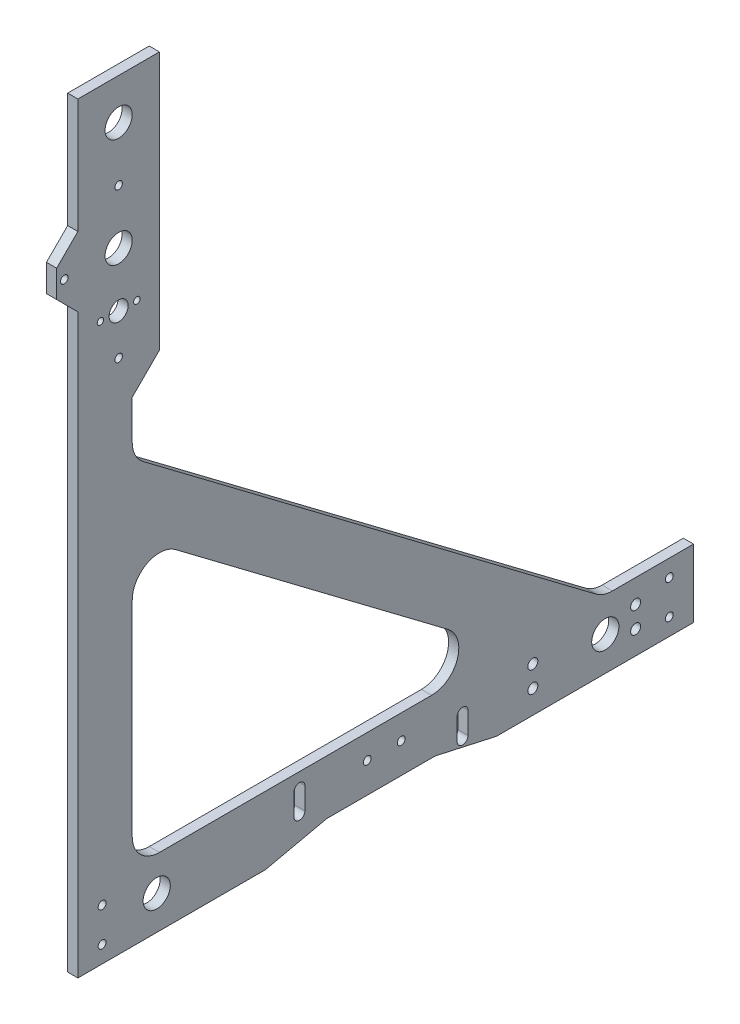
ISO-10303-21;
HEADER;
FILE_DESCRIPTION(('STEP AP214'),'2;1');
FILE_NAME('part.step','',(''),(''),'','','');
FILE_SCHEMA(('AUTOMOTIVE_DESIGN { 1 0 10303 214 1 1 1 1 }'));
ENDSEC;
DATA;
#1=APPLICATION_CONTEXT('core data for automotive mechanical design processes');
#2=APPLICATION_PROTOCOL_DEFINITION('international standard','automotive_design',2000,#1);
#3=PRODUCT_CONTEXT('',#1,'mechanical');
#4=PRODUCT('Part','Part','',(#3));
#5=PRODUCT_RELATED_PRODUCT_CATEGORY('part','',(#4));
#6=PRODUCT_DEFINITION_FORMATION('','',#4);
#7=PRODUCT_DEFINITION_CONTEXT('part definition',#1,'design');
#8=PRODUCT_DEFINITION('design','',#6,#7);
#9=PRODUCT_DEFINITION_SHAPE('','',#8);
#10=(LENGTH_UNIT() NAMED_UNIT(*) SI_UNIT(.MILLI.,.METRE.));
#11=(NAMED_UNIT(*) PLANE_ANGLE_UNIT() SI_UNIT($,.RADIAN.));
#12=(NAMED_UNIT(*) SI_UNIT($,.STERADIAN.) SOLID_ANGLE_UNIT());
#13=UNCERTAINTY_MEASURE_WITH_UNIT(LENGTH_MEASURE(1.E-05),#10,'distance_accuracy_value','');
#14=(GEOMETRIC_REPRESENTATION_CONTEXT(3) GLOBAL_UNCERTAINTY_ASSIGNED_CONTEXT((#13)) GLOBAL_UNIT_ASSIGNED_CONTEXT((#10,
#11,#12)) REPRESENTATION_CONTEXT('',''));
#15=CARTESIAN_POINT('',(0.,0.,0.));
#16=DIRECTION('',(0.,0.,1.));
#17=DIRECTION('',(1.,0.,0.));
#18=AXIS2_PLACEMENT_3D('',#15,#16,#17);
#19=CARTESIAN_POINT('',(4.7625,0.,0.));
#20=DIRECTION('',(0.,-1.,0.));
#21=DIRECTION('',(0.,0.,-1.));
#22=AXIS2_PLACEMENT_3D('',#19,#20,#21);
#23=PLANE('',#22);
#24=DIRECTION('',(-1.,0.,0.));
#25=VECTOR('',#24,1.);
#26=CARTESIAN_POINT('',(4.7625,0.,-195.58));
#27=LINE('',#26,#25);
#28=CARTESIAN_POINT('',(4.7625,0.,-195.58));
#29=VERTEX_POINT('',#28);
#30=CARTESIAN_POINT('',(0.,0.,-195.58));
#31=VERTEX_POINT('',#30);
#32=EDGE_CURVE('E500',#29,#31,#27,.T.);
#33=ORIENTED_EDGE('',*,*,#32,.T.);
#34=DIRECTION('',(0.,0.,1.));
#35=VECTOR('',#34,1.);
#36=CARTESIAN_POINT('',(0.,0.,0.));
#37=LINE('',#36,#35);
#38=CARTESIAN_POINT('',(0.,0.,-287.5915));
#39=VERTEX_POINT('',#38);
#40=EDGE_CURVE('E342',#39,#31,#37,.T.);
#41=ORIENTED_EDGE('',*,*,#40,.F.);
#42=DIRECTION('',(-1.,0.,0.));
#43=VECTOR('',#42,1.);
#44=CARTESIAN_POINT('',(4.7625,0.,-287.5915));
#45=LINE('',#44,#43);
#46=CARTESIAN_POINT('',(4.7625,0.,-287.5915));
#47=VERTEX_POINT('',#46);
#48=EDGE_CURVE('E376',#47,#39,#45,.T.);
#49=ORIENTED_EDGE('',*,*,#48,.F.);
#50=DIRECTION('',(0.,0.,1.));
#51=VECTOR('',#50,1.);
#52=CARTESIAN_POINT('',(4.7625,0.,0.));
#53=LINE('',#52,#51);
#54=EDGE_CURVE('E279',#47,#29,#53,.T.);
#55=ORIENTED_EDGE('',*,*,#54,.T.);
#56=EDGE_LOOP('',(#33,#41,#49,#55));
#57=FACE_BOUND('',#56,.T.);
#58=ADVANCED_FACE('F41',(#57),#23,.T.);
#59=CARTESIAN_POINT('',(4.7625,0.,0.));
#60=DIRECTION('',(0.,0.,-1.));
#61=DIRECTION('',(0.,1.,0.));
#62=AXIS2_PLACEMENT_3D('',#59,#60,#61);
#63=PLANE('',#62);
#64=DIRECTION('',(0.,-1.,0.));
#65=VECTOR('',#64,1.);
#66=CARTESIAN_POINT('',(0.,0.,0.));
#67=LINE('',#66,#65);
#68=CARTESIAN_POINT('',(0.,355.6,0.));
#69=VERTEX_POINT('',#68);
#70=CARTESIAN_POINT('',(0.,302.006,0.));
#71=VERTEX_POINT('',#70);
#72=EDGE_CURVE('E329',#69,#71,#67,.T.);
#73=ORIENTED_EDGE('',*,*,#72,.T.);
#74=DIRECTION('',(-1.,0.,0.));
#75=VECTOR('',#74,1.);
#76=CARTESIAN_POINT('',(4.7625,302.006,0.));
#77=LINE('',#76,#75);
#78=CARTESIAN_POINT('',(4.7625,302.006,0.));
#79=VERTEX_POINT('',#78);
#80=EDGE_CURVE('E388',#79,#71,#77,.T.);
#81=ORIENTED_EDGE('',*,*,#80,.F.);
#82=DIRECTION('',(0.,-1.,0.));
#83=VECTOR('',#82,1.);
#84=CARTESIAN_POINT('',(4.7625,0.,0.));
#85=LINE('',#84,#83);
#86=CARTESIAN_POINT('',(4.7625,355.6,0.));
#87=VERTEX_POINT('',#86);
#88=EDGE_CURVE('E466',#87,#79,#85,.T.);
#89=ORIENTED_EDGE('',*,*,#88,.F.);
#90=DIRECTION('',(-1.,0.,0.));
#91=VECTOR('',#90,1.);
#92=CARTESIAN_POINT('',(4.7625,355.6,0.));
#93=LINE('',#92,#91);
#94=EDGE_CURVE('E303',#87,#69,#93,.T.);
#95=ORIENTED_EDGE('',*,*,#94,.T.);
#96=EDGE_LOOP('',(#73,#81,#89,#95));
#97=FACE_BOUND('',#96,.T.);
#98=ADVANCED_FACE('F467',(#97),#63,.F.);
#99=CARTESIAN_POINT('',(4.7625,151.003,151.003));
#100=DIRECTION('',(0.,-0.707106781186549,-0.707106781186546));
#101=DIRECTION('',(0.,0.707106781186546,-0.707106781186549));
#102=AXIS2_PLACEMENT_3D('',#99,#100,#101);
#103=PLANE('',#102);
#104=DIRECTION('',(0.,-0.707106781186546,0.707106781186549));
#105=VECTOR('',#104,1.);
#106=CARTESIAN_POINT('',(0.,151.003,151.003));
#107=LINE('',#106,#105);
#108=CARTESIAN_POINT('',(0.,292.1,9.906));
#109=VERTEX_POINT('',#108);
#110=EDGE_CURVE('E332',#71,#109,#107,.T.);
#111=ORIENTED_EDGE('',*,*,#110,.T.);
#112=DIRECTION('',(-1.,0.,0.));
#113=VECTOR('',#112,1.);
#114=CARTESIAN_POINT('',(4.7625,292.1,9.906));
#115=LINE('',#114,#113);
#116=CARTESIAN_POINT('',(4.7625,292.1,9.906));
#117=VERTEX_POINT('',#116);
#118=EDGE_CURVE('E385',#117,#109,#115,.T.);
#119=ORIENTED_EDGE('',*,*,#118,.F.);
#120=DIRECTION('',(0.,-0.707106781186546,0.707106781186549));
#121=VECTOR('',#120,1.);
#122=CARTESIAN_POINT('',(4.7625,151.003,151.003));
#123=LINE('',#122,#121);
#124=EDGE_CURVE('E468',#79,#117,#123,.T.);
#125=ORIENTED_EDGE('',*,*,#124,.F.);
#126=ORIENTED_EDGE('',*,*,#80,.T.);
#127=EDGE_LOOP('',(#111,#119,#125,#126));
#128=FACE_BOUND('',#127,.T.);
#129=ADVANCED_FACE('F718',(#128),#103,.F.);
#130=CARTESIAN_POINT('',(4.7625,0.,9.906));
#131=DIRECTION('',(0.,0.,-1.));
#132=DIRECTION('',(-1.,0.,0.));
#133=AXIS2_PLACEMENT_3D('',#130,#131,#132);
#134=PLANE('',#133);
#135=DIRECTION('',(0.,-1.,0.));
#136=VECTOR('',#135,1.);
#137=CARTESIAN_POINT('',(0.,0.,9.906));
#138=LINE('',#137,#136);
#139=CARTESIAN_POINT('',(0.,279.4,9.906));
#140=VERTEX_POINT('',#139);
#141=EDGE_CURVE('E334',#109,#140,#138,.T.);
#142=ORIENTED_EDGE('',*,*,#141,.T.);
#143=DIRECTION('',(-1.,0.,0.));
#144=VECTOR('',#143,1.);
#145=CARTESIAN_POINT('',(4.7625,279.4,9.906));
#146=LINE('',#145,#144);
#147=CARTESIAN_POINT('',(4.7625,279.4,9.906));
#148=VERTEX_POINT('',#147);
#149=EDGE_CURVE('E382',#148,#140,#146,.T.);
#150=ORIENTED_EDGE('',*,*,#149,.F.);
#151=DIRECTION('',(0.,-1.,0.));
#152=VECTOR('',#151,1.);
#153=CARTESIAN_POINT('',(4.7625,0.,9.906));
#154=LINE('',#153,#152);
#155=EDGE_CURVE('E471',#117,#148,#154,.T.);
#156=ORIENTED_EDGE('',*,*,#155,.F.);
#157=ORIENTED_EDGE('',*,*,#118,.T.);
#158=EDGE_LOOP('',(#142,#150,#156,#157));
#159=FACE_BOUND('',#158,.T.);
#160=ADVANCED_FACE('F733',(#159),#134,.F.);
#161=CARTESIAN_POINT('',(4.7625,134.747,-134.747));
#162=DIRECTION('',(0.,0.707106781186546,-0.707106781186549));
#163=DIRECTION('',(0.,0.707106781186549,0.707106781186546));
#164=AXIS2_PLACEMENT_3D('',#161,#162,#163);
#165=PLANE('',#164);
#166=DIRECTION('',(0.,-0.707106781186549,-0.707106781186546));
#167=VECTOR('',#166,1.);
#168=CARTESIAN_POINT('',(0.,134.747,-134.747));
#169=LINE('',#168,#167);
#170=CARTESIAN_POINT('',(0.,269.494000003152,3.15186939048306E-09));
#171=VERTEX_POINT('',#170);
#172=EDGE_CURVE('E336',#140,#171,#169,.T.);
#173=ORIENTED_EDGE('',*,*,#172,.T.);
#174=DIRECTION('',(-1.,0.,0.));
#175=VECTOR('',#174,1.);
#176=CARTESIAN_POINT('',(4.7625,269.494000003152,3.15186939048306E-09));
#177=LINE('',#176,#175);
#178=CARTESIAN_POINT('',(4.7625,269.494000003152,3.15186939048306E-09));
#179=VERTEX_POINT('',#178);
#180=EDGE_CURVE('E380',#179,#171,#177,.T.);
#181=ORIENTED_EDGE('',*,*,#180,.F.);
#182=DIRECTION('',(0.,-0.707106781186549,-0.707106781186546));
#183=VECTOR('',#182,1.);
#184=CARTESIAN_POINT('',(4.7625,134.747,-134.747));
#185=LINE('',#184,#183);
#186=EDGE_CURVE('E283',#148,#179,#185,.T.);
#187=ORIENTED_EDGE('',*,*,#186,.F.);
#188=ORIENTED_EDGE('',*,*,#149,.T.);
#189=EDGE_LOOP('',(#173,#181,#187,#188));
#190=FACE_BOUND('',#189,.T.);
#191=ADVANCED_FACE('F483',(#190),#165,.F.);
#192=CARTESIAN_POINT('',(4.7625,0.,0.));
#193=DIRECTION('',(0.,-1.16955085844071E-11,1.));
#194=DIRECTION('',(0.,-1.,-1.16955085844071E-11));
#195=AXIS2_PLACEMENT_3D('',#192,#193,#194);
#196=PLANE('',#195);
#197=DIRECTION('',(0.,1.,1.16955085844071E-11));
#198=VECTOR('',#197,1.);
#199=CARTESIAN_POINT('',(0.,0.,0.));
#200=LINE('',#199,#198);
#201=CARTESIAN_POINT('',(0.,0.,0.));
#202=VERTEX_POINT('',#201);
#203=EDGE_CURVE('E339',#202,#171,#200,.T.);
#204=ORIENTED_EDGE('',*,*,#203,.F.);
#205=DIRECTION('',(-1.,0.,0.));
#206=VECTOR('',#205,1.);
#207=CARTESIAN_POINT('',(4.7625,0.,0.));
#208=LINE('',#207,#206);
#209=CARTESIAN_POINT('',(4.7625,0.,0.));
#210=VERTEX_POINT('',#209);
#211=EDGE_CURVE('E378',#210,#202,#208,.T.);
#212=ORIENTED_EDGE('',*,*,#211,.F.);
#213=DIRECTION('',(0.,1.,1.16955085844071E-11));
#214=VECTOR('',#213,1.);
#215=CARTESIAN_POINT('',(4.7625,0.,0.));
#216=LINE('',#215,#214);
#217=EDGE_CURVE('E278',#210,#179,#216,.T.);
#218=ORIENTED_EDGE('',*,*,#217,.T.);
#219=ORIENTED_EDGE('',*,*,#180,.T.);
#220=EDGE_LOOP('',(#204,#212,#218,#219));
#221=FACE_BOUND('',#220,.T.);
#222=ADVANCED_FACE('F487',(#221),#196,.T.);
#223=DIRECTION('',(-1.,0.,0.));
#224=VECTOR('',#223,1.);
#225=CARTESIAN_POINT('',(4.7625,0.,-87.6299999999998));
#226=LINE('',#225,#224);
#227=CARTESIAN_POINT('',(4.7625,0.,-87.6299999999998));
#228=VERTEX_POINT('',#227);
#229=CARTESIAN_POINT('',(0.,0.,-87.6300000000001));
#230=VERTEX_POINT('',#229);
#231=EDGE_CURVE('E56',#228,#230,#226,.T.);
#232=ORIENTED_EDGE('',*,*,#231,.F.);
#233=EDGE_CURVE('E268',#228,#210,#53,.T.);
#234=ORIENTED_EDGE('',*,*,#233,.T.);
#235=ORIENTED_EDGE('',*,*,#211,.T.);
#236=EDGE_CURVE('E270',#230,#202,#37,.T.);
#237=ORIENTED_EDGE('',*,*,#236,.F.);
#238=EDGE_LOOP('',(#232,#234,#235,#237));
#239=FACE_BOUND('',#238,.T.);
#240=ADVANCED_FACE('F266',(#239),#23,.T.);
#241=CARTESIAN_POINT('',(4.7625,0.,-287.5915));
#242=DIRECTION('',(0.,0.,-1.));
#243=DIRECTION('',(-1.,0.,0.));
#244=AXIS2_PLACEMENT_3D('',#241,#242,#243);
#245=PLANE('',#244);
#246=DIRECTION('',(0.,-1.,0.));
#247=VECTOR('',#246,1.);
#248=CARTESIAN_POINT('',(0.,0.,-287.5915));
#249=LINE('',#248,#247);
#250=CARTESIAN_POINT('',(0.,31.75,-287.5915));
#251=VERTEX_POINT('',#250);
#252=EDGE_CURVE('E345',#251,#39,#249,.T.);
#253=ORIENTED_EDGE('',*,*,#252,.F.);
#254=DIRECTION('',(-1.,0.,0.));
#255=VECTOR('',#254,1.);
#256=CARTESIAN_POINT('',(4.7625,31.75,-287.5915));
#257=LINE('',#256,#255);
#258=CARTESIAN_POINT('',(4.7625,31.75,-287.5915));
#259=VERTEX_POINT('',#258);
#260=EDGE_CURVE('E373',#259,#251,#257,.T.);
#261=ORIENTED_EDGE('',*,*,#260,.F.);
#262=DIRECTION('',(0.,-1.,0.));
#263=VECTOR('',#262,1.);
#264=CARTESIAN_POINT('',(4.7625,0.,-287.5915));
#265=LINE('',#264,#263);
#266=EDGE_CURVE('E282',#259,#47,#265,.T.);
#267=ORIENTED_EDGE('',*,*,#266,.T.);
#268=ORIENTED_EDGE('',*,*,#48,.T.);
#269=EDGE_LOOP('',(#253,#261,#267,#268));
#270=FACE_BOUND('',#269,.T.);
#271=ADVANCED_FACE('F723',(#270),#245,.T.);
#272=CARTESIAN_POINT('',(4.7625,31.75,0.));
#273=DIRECTION('',(0.,1.,0.));
#274=DIRECTION('',(0.,0.,1.));
#275=AXIS2_PLACEMENT_3D('',#272,#273,#274);
#276=PLANE('',#275);
#277=DIRECTION('',(0.,0.,-1.));
#278=VECTOR('',#277,1.);
#279=CARTESIAN_POINT('',(0.,31.75,0.));
#280=LINE('',#279,#278);
#281=CARTESIAN_POINT('',(0.,31.75,-249.655020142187));
#282=VERTEX_POINT('',#281);
#283=EDGE_CURVE('E348',#282,#251,#280,.T.);
#284=ORIENTED_EDGE('',*,*,#283,.F.);
#285=DIRECTION('',(-1.,0.,0.));
#286=VECTOR('',#285,1.);
#287=CARTESIAN_POINT('',(4.7625,31.75,-249.655020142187));
#288=LINE('',#287,#286);
#289=CARTESIAN_POINT('',(4.7625,31.75,-249.655020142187));
#290=VERTEX_POINT('',#289);
#291=EDGE_CURVE('E411',#282,#290,#288,.F.);
#292=ORIENTED_EDGE('',*,*,#291,.T.);
#293=DIRECTION('',(0.,0.,-1.));
#294=VECTOR('',#293,1.);
#295=CARTESIAN_POINT('',(4.7625,31.75,0.));
#296=LINE('',#295,#294);
#297=EDGE_CURVE('E289',#290,#259,#296,.T.);
#298=ORIENTED_EDGE('',*,*,#297,.T.);
#299=ORIENTED_EDGE('',*,*,#260,.T.);
#300=EDGE_LOOP('',(#284,#292,#298,#299));
#301=FACE_BOUND('',#300,.T.);
#302=ADVANCED_FACE('F728',(#301),#276,.T.);
#303=CARTESIAN_POINT('',(4.7625,138.200273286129,-104.141375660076));
#304=DIRECTION('',(0.,0.798635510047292,-0.601815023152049));
#305=DIRECTION('',(0.,0.601815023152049,0.798635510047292));
#306=AXIS2_PLACEMENT_3D('',#303,#304,#305);
#307=PLANE('',#306);
#308=DIRECTION('',(0.,-0.601815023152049,-0.798635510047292));
#309=VECTOR('',#308,1.);
#310=CARTESIAN_POINT('',(4.7625,138.200273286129,-104.141375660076));
#311=LINE('',#310,#309);
#312=CARTESIAN_POINT('',(4.7625,193.725471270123,-30.4569492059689));
#313=VERTEX_POINT('',#312);
#314=CARTESIAN_POINT('',(4.7625,34.3073290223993,-242.011969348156));
#315=VERTEX_POINT('',#314);
#316=EDGE_CURVE('E291',#313,#315,#311,.T.);
#317=ORIENTED_EDGE('',*,*,#316,.T.);
#318=DIRECTION('',(-1.,0.,0.));
#319=VECTOR('',#318,1.);
#320=CARTESIAN_POINT('',(0.,34.3073290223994,-242.011969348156));
#321=LINE('',#320,#319);
#322=CARTESIAN_POINT('',(0.,34.3073290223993,-242.011969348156));
#323=VERTEX_POINT('',#322);
#324=EDGE_CURVE('E408',#315,#323,#321,.T.);
#325=ORIENTED_EDGE('',*,*,#324,.T.);
#326=DIRECTION('',(0.,-0.601815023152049,-0.798635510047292));
#327=VECTOR('',#326,1.);
#328=CARTESIAN_POINT('',(0.,138.200273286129,-104.141375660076));
#329=LINE('',#328,#327);
#330=CARTESIAN_POINT('',(0.,193.725471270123,-30.4569492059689));
#331=VERTEX_POINT('',#330);
#332=EDGE_CURVE('E350',#331,#323,#329,.T.);
#333=ORIENTED_EDGE('',*,*,#332,.F.);
#334=DIRECTION('',(-1.,0.,0.));
#335=VECTOR('',#334,1.);
#336=CARTESIAN_POINT('',(4.7625,193.725471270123,-30.456949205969));
#337=LINE('',#336,#335);
#338=EDGE_CURVE('E406',#331,#313,#337,.F.);
#339=ORIENTED_EDGE('',*,*,#338,.T.);
#340=EDGE_LOOP('',(#317,#325,#333,#339));
#341=FACE_BOUND('',#340,.T.);
#342=ADVANCED_FACE('F440',(#341),#307,.T.);
#343=CARTESIAN_POINT('',(4.7625,0.,-25.4));
#344=DIRECTION('',(0.,0.,1.));
#345=DIRECTION('',(0.,-1.,0.));
#346=AXIS2_PLACEMENT_3D('',#343,#344,#345);
#347=PLANE('',#346);
#348=DIRECTION('',(0.,1.,0.));
#349=VECTOR('',#348,1.);
#350=CARTESIAN_POINT('',(4.7625,0.,-25.4));
#351=LINE('',#350,#349);
#352=CARTESIAN_POINT('',(4.7625,203.868142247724,-25.4));
#353=VERTEX_POINT('',#352);
#354=CARTESIAN_POINT('',(4.7625,222.25,-25.4));
#355=VERTEX_POINT('',#354);
#356=EDGE_CURVE('E294',#353,#355,#351,.T.);
#357=ORIENTED_EDGE('',*,*,#356,.F.);
#358=DIRECTION('',(-1.,0.,0.));
#359=VECTOR('',#358,1.);
#360=CARTESIAN_POINT('',(4.7625,203.868142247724,-25.4));
#361=LINE('',#360,#359);
#362=CARTESIAN_POINT('',(0.,203.868142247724,-25.4));
#363=VERTEX_POINT('',#362);
#364=EDGE_CURVE('E413',#353,#363,#361,.T.);
#365=ORIENTED_EDGE('',*,*,#364,.T.);
#366=DIRECTION('',(0.,1.,0.));
#367=VECTOR('',#366,1.);
#368=CARTESIAN_POINT('',(0.,0.,-25.4));
#369=LINE('',#368,#367);
#370=CARTESIAN_POINT('',(0.,222.25,-25.4));
#371=VERTEX_POINT('',#370);
#372=EDGE_CURVE('E353',#363,#371,#369,.T.);
#373=ORIENTED_EDGE('',*,*,#372,.T.);
#374=DIRECTION('',(-1.,0.,0.));
#375=VECTOR('',#374,1.);
#376=CARTESIAN_POINT('',(4.7625,222.25,-25.4));
#377=LINE('',#376,#375);
#378=EDGE_CURVE('E370',#355,#371,#377,.T.);
#379=ORIENTED_EDGE('',*,*,#378,.F.);
#380=EDGE_LOOP('',(#357,#365,#373,#379));
#381=FACE_BOUND('',#380,.T.);
#382=ADVANCED_FACE('F447',(#381),#347,.F.);
#383=CARTESIAN_POINT('',(4.7625,98.4250000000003,98.425));
#384=DIRECTION('',(0.,0.707106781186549,0.707106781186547));
#385=DIRECTION('',(0.,-0.707106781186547,0.707106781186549));
#386=AXIS2_PLACEMENT_3D('',#383,#384,#385);
#387=PLANE('',#386);
#388=DIRECTION('',(0.,0.707106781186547,-0.707106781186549));
#389=VECTOR('',#388,1.);
#390=CARTESIAN_POINT('',(0.,98.4250000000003,98.425));
#391=LINE('',#390,#389);
#392=CARTESIAN_POINT('',(0.,234.95,-38.1));
#393=VERTEX_POINT('',#392);
#394=EDGE_CURVE('E355',#371,#393,#391,.T.);
#395=ORIENTED_EDGE('',*,*,#394,.T.);
#396=DIRECTION('',(-1.,0.,0.));
#397=VECTOR('',#396,1.);
#398=CARTESIAN_POINT('',(4.7625,234.95,-38.1));
#399=LINE('',#398,#397);
#400=CARTESIAN_POINT('',(4.7625,234.95,-38.1));
#401=VERTEX_POINT('',#400);
#402=EDGE_CURVE('E368',#401,#393,#399,.T.);
#403=ORIENTED_EDGE('',*,*,#402,.F.);
#404=DIRECTION('',(0.,0.707106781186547,-0.707106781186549));
#405=VECTOR('',#404,1.);
#406=CARTESIAN_POINT('',(4.7625,98.4250000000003,98.425));
#407=LINE('',#406,#405);
#408=EDGE_CURVE('E296',#355,#401,#407,.T.);
#409=ORIENTED_EDGE('',*,*,#408,.F.);
#410=ORIENTED_EDGE('',*,*,#378,.T.);
#411=EDGE_LOOP('',(#395,#403,#409,#410));
#412=FACE_BOUND('',#411,.T.);
#413=ADVANCED_FACE('F451',(#412),#387,.F.);
#414=CARTESIAN_POINT('',(4.7625,0.,-38.1));
#415=DIRECTION('',(0.,0.,-1.));
#416=DIRECTION('',(0.,1.,0.));
#417=AXIS2_PLACEMENT_3D('',#414,#415,#416);
#418=PLANE('',#417);
#419=DIRECTION('',(0.,-1.,0.));
#420=VECTOR('',#419,1.);
#421=CARTESIAN_POINT('',(0.,0.,-38.1));
#422=LINE('',#421,#420);
#423=CARTESIAN_POINT('',(0.,355.6,-38.1));
#424=VERTEX_POINT('',#423);
#425=EDGE_CURVE('E358',#424,#393,#422,.T.);
#426=ORIENTED_EDGE('',*,*,#425,.F.);
#427=DIRECTION('',(-1.,0.,0.));
#428=VECTOR('',#427,1.);
#429=CARTESIAN_POINT('',(4.7625,355.6,-38.1));
#430=LINE('',#429,#428);
#431=CARTESIAN_POINT('',(4.7625,355.6,-38.1));
#432=VERTEX_POINT('',#431);
#433=EDGE_CURVE('E366',#432,#424,#430,.T.);
#434=ORIENTED_EDGE('',*,*,#433,.F.);
#435=DIRECTION('',(0.,-1.,0.));
#436=VECTOR('',#435,1.);
#437=CARTESIAN_POINT('',(4.7625,0.,-38.1));
#438=LINE('',#437,#436);
#439=EDGE_CURVE('E298',#432,#401,#438,.T.);
#440=ORIENTED_EDGE('',*,*,#439,.T.);
#441=ORIENTED_EDGE('',*,*,#402,.T.);
#442=EDGE_LOOP('',(#426,#434,#440,#441));
#443=FACE_BOUND('',#442,.T.);
#444=ADVANCED_FACE('F458',(#443),#418,.T.);
#445=CARTESIAN_POINT('',(4.7625,31.75,0.));
#446=DIRECTION('',(0.,1.,0.));
#447=DIRECTION('',(0.,0.,1.));
#448=AXIS2_PLACEMENT_3D('',#445,#446,#447);
#449=PLANE('',#448);
#450=DIRECTION('',(0.,0.,-1.));
#451=VECTOR('',#450,1.);
#452=CARTESIAN_POINT('',(0.,31.75,0.));
#453=LINE('',#452,#451);
#454=CARTESIAN_POINT('',(0.,31.75,-38.1));
#455=VERTEX_POINT('',#454);
#456=CARTESIAN_POINT('',(0.,31.75,-165.243700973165));
#457=VERTEX_POINT('',#456);
#458=EDGE_CURVE('E320',#455,#457,#453,.T.);
#459=ORIENTED_EDGE('',*,*,#458,.F.);
#460=DIRECTION('',(-1.,0.,0.));
#461=VECTOR('',#460,1.);
#462=CARTESIAN_POINT('',(4.7625,31.75,-38.1));
#463=LINE('',#462,#461);
#464=CARTESIAN_POINT('',(4.7625,31.75,-38.1));
#465=VERTEX_POINT('',#464);
#466=EDGE_CURVE('E404',#455,#465,#463,.F.);
#467=ORIENTED_EDGE('',*,*,#466,.T.);
#468=DIRECTION('',(0.,0.,-1.));
#469=VECTOR('',#468,1.);
#470=CARTESIAN_POINT('',(4.7625,31.75,0.));
#471=LINE('',#470,#469);
#472=CARTESIAN_POINT('',(4.7625,31.75,-165.243700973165));
#473=VERTEX_POINT('',#472);
#474=EDGE_CURVE('E671',#465,#473,#471,.T.);
#475=ORIENTED_EDGE('',*,*,#474,.T.);
#476=DIRECTION('',(-1.,0.,0.));
#477=VECTOR('',#476,1.);
#478=CARTESIAN_POINT('',(4.7625,31.75,-165.243700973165));
#479=LINE('',#478,#477);
#480=EDGE_CURVE('E401',#473,#457,#479,.T.);
#481=ORIENTED_EDGE('',*,*,#480,.T.);
#482=EDGE_LOOP('',(#459,#467,#475,#481));
#483=FACE_BOUND('',#482,.T.);
#484=ADVANCED_FACE('F698',(#483),#449,.T.);
#485=CARTESIAN_POINT('',(4.7625,0.,-25.4));
#486=DIRECTION('',(0.,0.,1.));
#487=DIRECTION('',(0.,-1.,0.));
#488=AXIS2_PLACEMENT_3D('',#485,#486,#487);
#489=PLANE('',#488);
#490=DIRECTION('',(0.,1.,0.));
#491=VECTOR('',#490,1.);
#492=CARTESIAN_POINT('',(0.,0.,-25.4));
#493=LINE('',#492,#491);
#494=CARTESIAN_POINT('',(0.,44.45,-25.4));
#495=VERTEX_POINT('',#494);
#496=CARTESIAN_POINT('',(0.,140.259650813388,-25.4));
#497=VERTEX_POINT('',#496);
#498=EDGE_CURVE('E323',#495,#497,#493,.T.);
#499=ORIENTED_EDGE('',*,*,#498,.T.);
#500=DIRECTION('',(-1.,0.,0.));
#501=VECTOR('',#500,1.);
#502=CARTESIAN_POINT('',(4.7625,140.259650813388,-25.4));
#503=LINE('',#502,#501);
#504=CARTESIAN_POINT('',(4.7625,140.259650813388,-25.4));
#505=VERTEX_POINT('',#504);
#506=EDGE_CURVE('E399',#497,#505,#503,.F.);
#507=ORIENTED_EDGE('',*,*,#506,.T.);
#508=DIRECTION('',(0.,1.,0.));
#509=VECTOR('',#508,1.);
#510=CARTESIAN_POINT('',(4.7625,0.,-25.4));
#511=LINE('',#510,#509);
#512=CARTESIAN_POINT('',(4.7625,44.45,-25.4));
#513=VERTEX_POINT('',#512);
#514=EDGE_CURVE('E474',#513,#505,#511,.T.);
#515=ORIENTED_EDGE('',*,*,#514,.F.);
#516=DIRECTION('',(-1.,0.,0.));
#517=VECTOR('',#516,1.);
#518=CARTESIAN_POINT('',(4.7625,44.45,-25.4));
#519=LINE('',#518,#517);
#520=EDGE_CURVE('E396',#513,#495,#519,.T.);
#521=ORIENTED_EDGE('',*,*,#520,.T.);
#522=EDGE_LOOP('',(#499,#507,#515,#521));
#523=FACE_BOUND('',#522,.T.);
#524=ADVANCED_FACE('F702',(#523),#489,.F.);
#525=CARTESIAN_POINT('',(4.7625,117.914931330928,-88.855274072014));
#526=DIRECTION('',(0.,0.798635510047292,-0.601815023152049));
#527=DIRECTION('',(0.,0.601815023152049,0.798635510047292));
#528=AXIS2_PLACEMENT_3D('',#525,#526,#527);
#529=PLANE('',#528);
#530=DIRECTION('',(0.,-0.601815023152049,-0.798635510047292));
#531=VECTOR('',#530,1.);
#532=CARTESIAN_POINT('',(4.7625,117.914931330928,-88.855274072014));
#533=LINE('',#532,#531);
#534=CARTESIAN_POINT('',(4.7625,150.402321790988,-45.743050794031));
#535=VERTEX_POINT('',#534);
#536=CARTESIAN_POINT('',(4.7625,54.5926709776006,-172.886751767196));
#537=VERTEX_POINT('',#536);
#538=EDGE_CURVE('E469',#535,#537,#533,.T.);
#539=ORIENTED_EDGE('',*,*,#538,.F.);
#540=DIRECTION('',(-1.,0.,0.));
#541=VECTOR('',#540,1.);
#542=CARTESIAN_POINT('',(0.,150.402321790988,-45.743050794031));
#543=LINE('',#542,#541);
#544=CARTESIAN_POINT('',(0.,150.402321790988,-45.743050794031));
#545=VERTEX_POINT('',#544);
#546=EDGE_CURVE('E393',#535,#545,#543,.T.);
#547=ORIENTED_EDGE('',*,*,#546,.T.);
#548=DIRECTION('',(0.,-0.601815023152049,-0.798635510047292));
#549=VECTOR('',#548,1.);
#550=CARTESIAN_POINT('',(0.,117.914931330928,-88.855274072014));
#551=LINE('',#550,#549);
#552=CARTESIAN_POINT('',(0.,54.5926709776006,-172.886751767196));
#553=VERTEX_POINT('',#552);
#554=EDGE_CURVE('E326',#545,#553,#551,.T.);
#555=ORIENTED_EDGE('',*,*,#554,.T.);
#556=DIRECTION('',(-1.,0.,0.));
#557=VECTOR('',#556,1.);
#558=CARTESIAN_POINT('',(4.7625,54.5926709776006,-172.886751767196));
#559=LINE('',#558,#557);
#560=EDGE_CURVE('E391',#553,#537,#559,.F.);
#561=ORIENTED_EDGE('',*,*,#560,.T.);
#562=EDGE_LOOP('',(#539,#547,#555,#561));
#563=FACE_BOUND('',#562,.T.);
#564=ADVANCED_FACE('F688',(#563),#529,.F.);
#565=CARTESIAN_POINT('',(4.7625,285.75,-19.05));
#566=DIRECTION('',(-1.,0.,0.));
#567=DIRECTION('',(0.,0.,1.));
#568=AXIS2_PLACEMENT_3D('',#565,#566,#567);
#569=CYLINDRICAL_SURFACE('',#568,6.35);
#570=CARTESIAN_POINT('',(4.7625,285.75,-19.05));
#571=DIRECTION('',(1.,0.,0.));
#572=DIRECTION('',(0.,0.,-1.));
#573=AXIS2_PLACEMENT_3D('',#570,#571,#572);
#574=CIRCLE('',#573,6.35);
#575=CARTESIAN_POINT('',(4.7625,285.75,-12.7));
#576=VERTEX_POINT('',#575);
#577=EDGE_CURVE('E668',#576,#576,#574,.T.);
#578=CARTESIAN_POINT('',(0.,285.75,-19.05));
#579=DIRECTION('',(1.,0.,0.));
#580=DIRECTION('',(0.,0.,-1.));
#581=AXIS2_PLACEMENT_3D('',#578,#579,#580);
#582=CIRCLE('',#581,6.35);
#583=CARTESIAN_POINT('',(0.,285.75,-12.7));
#584=VERTEX_POINT('',#583);
#585=EDGE_CURVE('E317',#584,#584,#582,.T.);
#586=CARTESIAN_POINT('',(4.7625,285.75,-12.7));
#587=CARTESIAN_POINT('',(4.712890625,285.75,-12.7));
#588=CARTESIAN_POINT('',(4.66328125,285.75,-12.7));
#589=CARTESIAN_POINT('',(4.5640625,285.75,-12.7));
#590=CARTESIAN_POINT('',(4.514453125,285.75,-12.7));
#591=CARTESIAN_POINT('',(4.415234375,285.75,-12.7));
#592=CARTESIAN_POINT('',(4.365625,285.75,-12.7));
#593=CARTESIAN_POINT('',(4.26640625,285.75,-12.7));
#594=CARTESIAN_POINT('',(4.216796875,285.75,-12.7));
#595=CARTESIAN_POINT('',(4.117578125,285.75,-12.7));
#596=CARTESIAN_POINT('',(4.06796875,285.75,-12.7));
#597=CARTESIAN_POINT('',(3.96875,285.75,-12.7));
#598=CARTESIAN_POINT('',(3.919140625,285.75,-12.7));
#599=CARTESIAN_POINT('',(3.819921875,285.75,-12.7));
#600=CARTESIAN_POINT('',(3.7703125,285.75,-12.7));
#601=CARTESIAN_POINT('',(3.67109375,285.75,-12.7));
#602=CARTESIAN_POINT('',(3.621484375,285.75,-12.7));
#603=CARTESIAN_POINT('',(3.522265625,285.75,-12.7));
#604=CARTESIAN_POINT('',(3.47265625,285.75,-12.7));
#605=CARTESIAN_POINT('',(3.3734375,285.75,-12.7));
#606=CARTESIAN_POINT('',(3.323828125,285.75,-12.7));
#607=CARTESIAN_POINT('',(3.224609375,285.75,-12.7));
#608=CARTESIAN_POINT('',(3.175,285.75,-12.7));
#609=CARTESIAN_POINT('',(3.07578125,285.75,-12.7));
#610=CARTESIAN_POINT('',(3.026171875,285.75,-12.7));
#611=CARTESIAN_POINT('',(2.926953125,285.75,-12.7));
#612=CARTESIAN_POINT('',(2.87734375,285.75,-12.7));
#613=CARTESIAN_POINT('',(2.778125,285.75,-12.7));
#614=CARTESIAN_POINT('',(2.728515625,285.75,-12.7));
#615=CARTESIAN_POINT('',(2.629296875,285.75,-12.7));
#616=CARTESIAN_POINT('',(2.5796875,285.75,-12.7));
#617=CARTESIAN_POINT('',(2.48046875,285.75,-12.7));
#618=CARTESIAN_POINT('',(2.430859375,285.75,-12.7));
#619=CARTESIAN_POINT('',(2.331640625,285.75,-12.7));
#620=CARTESIAN_POINT('',(2.28203125,285.75,-12.7));
#621=CARTESIAN_POINT('',(2.1828125,285.75,-12.7));
#622=CARTESIAN_POINT('',(2.133203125,285.75,-12.7));
#623=CARTESIAN_POINT('',(2.033984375,285.75,-12.7));
#624=CARTESIAN_POINT('',(1.984375,285.75,-12.7));
#625=CARTESIAN_POINT('',(1.88515625,285.75,-12.7));
#626=CARTESIAN_POINT('',(1.835546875,285.75,-12.7));
#627=CARTESIAN_POINT('',(1.736328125,285.75,-12.7));
#628=CARTESIAN_POINT('',(1.68671875,285.75,-12.7));
#629=CARTESIAN_POINT('',(1.5875,285.75,-12.7));
#630=CARTESIAN_POINT('',(1.537890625,285.75,-12.7));
#631=CARTESIAN_POINT('',(1.438671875,285.75,-12.7));
#632=CARTESIAN_POINT('',(1.3890625,285.75,-12.7));
#633=CARTESIAN_POINT('',(1.28984375,285.75,-12.7));
#634=CARTESIAN_POINT('',(1.240234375,285.75,-12.7));
#635=CARTESIAN_POINT('',(1.141015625,285.75,-12.7));
#636=CARTESIAN_POINT('',(1.09140625,285.75,-12.7));
#637=CARTESIAN_POINT('',(0.992187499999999,285.75,-12.7));
#638=CARTESIAN_POINT('',(0.942578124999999,285.75,-12.7));
#639=CARTESIAN_POINT('',(0.843359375,285.75,-12.7));
#640=CARTESIAN_POINT('',(0.79375,285.75,-12.7));
#641=CARTESIAN_POINT('',(0.69453125,285.75,-12.7));
#642=CARTESIAN_POINT('',(0.644921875,285.75,-12.7));
#643=CARTESIAN_POINT('',(0.545703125,285.75,-12.7));
#644=CARTESIAN_POINT('',(0.49609375,285.75,-12.7));
#645=CARTESIAN_POINT('',(0.396875,285.75,-12.7));
#646=CARTESIAN_POINT('',(0.347265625,285.75,-12.7));
#647=CARTESIAN_POINT('',(0.248046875,285.75,-12.7));
#648=CARTESIAN_POINT('',(0.1984375,285.75,-12.7));
#649=CARTESIAN_POINT('',(0.09921875,285.75,-12.7));
#650=CARTESIAN_POINT('',(0.049609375,285.75,-12.7));
#651=CARTESIAN_POINT('',(0.,285.75,-12.7));
#652=B_SPLINE_CURVE_WITH_KNOTS('',3,(#586,#587,#588,#589,#590,#591,#592,#593,#594,#595,#596,
#597,#598,#599,#600,#601,#602,#603,#604,#605,#606,#607,#608,#609,#610,#611,#612,#613,#614,#615,
#616,#617,#618,#619,#620,#621,#622,#623,#624,#625,#626,#627,#628,#629,#630,#631,#632,#633,#634,
#635,#636,#637,#638,#639,#640,#641,#642,#643,#644,#645,#646,#647,#648,#649,#650,#651),
.UNSPECIFIED.,.F.,.F.,(4,2,2,2,2,2,2,2,2,2,2,2,2,2,2,2,2,2,2,2,2,2,2,2,2,2,2,2,2,2,2,2,4),(0.,
0.148828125,0.29765625,0.446484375,0.5953125,0.744140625,0.892968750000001,1.041796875,1.190625,
1.339453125,1.48828125,1.637109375,1.7859375,1.934765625,2.08359375,2.232421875,2.38125,
2.530078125,2.67890625,2.827734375,2.9765625,3.125390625,3.27421875,3.423046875,3.571875,
3.720703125,3.86953125,4.018359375,4.1671875,4.316015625,4.46484375,4.613671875,4.7625),.UNSPECIFIED.);
#653=EDGE_CURVE('BSEAM709',#576,#584,#652,.T.);
#654=ORIENTED_EDGE('',*,*,#577,.T.);
#655=ORIENTED_EDGE('',*,*,#585,.F.);
#656=ORIENTED_EDGE('',*,*,#653,.T.);
#657=ORIENTED_EDGE('',*,*,#653,.F.);
#658=EDGE_LOOP('',(#654,#656,#655,#657));
#659=FACE_BOUND('',#658,.T.);
#660=ADVANCED_FACE('F709',(#659),#569,.F.);
#661=CARTESIAN_POINT('',(4.7625,336.55,-19.05));
#662=DIRECTION('',(-1.,0.,0.));
#663=DIRECTION('',(0.,0.,1.));
#664=AXIS2_PLACEMENT_3D('',#661,#662,#663);
#665=CYLINDRICAL_SURFACE('',#664,6.34999999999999);
#666=CARTESIAN_POINT('',(4.7625,336.55,-19.05));
#667=DIRECTION('',(1.,0.,0.));
#668=DIRECTION('',(0.,0.,-1.));
#669=AXIS2_PLACEMENT_3D('',#666,#667,#668);
#670=CIRCLE('',#669,6.34999999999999);
#671=CARTESIAN_POINT('',(4.7625,336.55,-12.7));
#672=VERTEX_POINT('',#671);
#673=EDGE_CURVE('E665',#672,#672,#670,.T.);
#674=CARTESIAN_POINT('',(0.,336.55,-19.05));
#675=DIRECTION('',(1.,0.,0.));
#676=DIRECTION('',(0.,0.,-1.));
#677=AXIS2_PLACEMENT_3D('',#674,#675,#676);
#678=CIRCLE('',#677,6.34999999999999);
#679=CARTESIAN_POINT('',(0.,336.55,-12.7));
#680=VERTEX_POINT('',#679);
#681=EDGE_CURVE('E314',#680,#680,#678,.T.);
#682=CARTESIAN_POINT('',(4.7625,336.55,-12.7));
#683=CARTESIAN_POINT('',(4.712890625,336.55,-12.7));
#684=CARTESIAN_POINT('',(4.66328125,336.55,-12.7));
#685=CARTESIAN_POINT('',(4.5640625,336.55,-12.7));
#686=CARTESIAN_POINT('',(4.514453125,336.55,-12.7));
#687=CARTESIAN_POINT('',(4.415234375,336.55,-12.7));
#688=CARTESIAN_POINT('',(4.365625,336.55,-12.7));
#689=CARTESIAN_POINT('',(4.26640625,336.55,-12.7));
#690=CARTESIAN_POINT('',(4.216796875,336.55,-12.7));
#691=CARTESIAN_POINT('',(4.117578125,336.55,-12.7));
#692=CARTESIAN_POINT('',(4.06796875,336.55,-12.7));
#693=CARTESIAN_POINT('',(3.96875,336.55,-12.7));
#694=CARTESIAN_POINT('',(3.919140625,336.55,-12.7));
#695=CARTESIAN_POINT('',(3.819921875,336.55,-12.7));
#696=CARTESIAN_POINT('',(3.7703125,336.55,-12.7));
#697=CARTESIAN_POINT('',(3.67109375,336.55,-12.7));
#698=CARTESIAN_POINT('',(3.621484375,336.55,-12.7));
#699=CARTESIAN_POINT('',(3.522265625,336.55,-12.7));
#700=CARTESIAN_POINT('',(3.47265625,336.55,-12.7));
#701=CARTESIAN_POINT('',(3.3734375,336.55,-12.7));
#702=CARTESIAN_POINT('',(3.323828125,336.55,-12.7));
#703=CARTESIAN_POINT('',(3.224609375,336.55,-12.7));
#704=CARTESIAN_POINT('',(3.175,336.55,-12.7));
#705=CARTESIAN_POINT('',(3.07578125,336.55,-12.7));
#706=CARTESIAN_POINT('',(3.026171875,336.55,-12.7));
#707=CARTESIAN_POINT('',(2.926953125,336.55,-12.7));
#708=CARTESIAN_POINT('',(2.87734375,336.55,-12.7));
#709=CARTESIAN_POINT('',(2.778125,336.55,-12.7));
#710=CARTESIAN_POINT('',(2.728515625,336.55,-12.7));
#711=CARTESIAN_POINT('',(2.629296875,336.55,-12.7));
#712=CARTESIAN_POINT('',(2.5796875,336.55,-12.7));
#713=CARTESIAN_POINT('',(2.48046875,336.55,-12.7));
#714=CARTESIAN_POINT('',(2.430859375,336.55,-12.7));
#715=CARTESIAN_POINT('',(2.331640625,336.55,-12.7));
#716=CARTESIAN_POINT('',(2.28203125,336.55,-12.7));
#717=CARTESIAN_POINT('',(2.1828125,336.55,-12.7));
#718=CARTESIAN_POINT('',(2.133203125,336.55,-12.7));
#719=CARTESIAN_POINT('',(2.033984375,336.55,-12.7));
#720=CARTESIAN_POINT('',(1.984375,336.55,-12.7));
#721=CARTESIAN_POINT('',(1.88515625,336.55,-12.7));
#722=CARTESIAN_POINT('',(1.835546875,336.55,-12.7));
#723=CARTESIAN_POINT('',(1.736328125,336.55,-12.7));
#724=CARTESIAN_POINT('',(1.68671875,336.55,-12.7));
#725=CARTESIAN_POINT('',(1.5875,336.55,-12.7));
#726=CARTESIAN_POINT('',(1.537890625,336.55,-12.7));
#727=CARTESIAN_POINT('',(1.438671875,336.55,-12.7));
#728=CARTESIAN_POINT('',(1.3890625,336.55,-12.7));
#729=CARTESIAN_POINT('',(1.28984375,336.55,-12.7));
#730=CARTESIAN_POINT('',(1.240234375,336.55,-12.7));
#731=CARTESIAN_POINT('',(1.141015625,336.55,-12.7));
#732=CARTESIAN_POINT('',(1.09140625,336.55,-12.7));
#733=CARTESIAN_POINT('',(0.992187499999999,336.55,-12.7));
#734=CARTESIAN_POINT('',(0.942578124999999,336.55,-12.7));
#735=CARTESIAN_POINT('',(0.843359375,336.55,-12.7));
#736=CARTESIAN_POINT('',(0.79375,336.55,-12.7));
#737=CARTESIAN_POINT('',(0.69453125,336.55,-12.7));
#738=CARTESIAN_POINT('',(0.644921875,336.55,-12.7));
#739=CARTESIAN_POINT('',(0.545703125,336.55,-12.7));
#740=CARTESIAN_POINT('',(0.49609375,336.55,-12.7));
#741=CARTESIAN_POINT('',(0.396875,336.55,-12.7));
#742=CARTESIAN_POINT('',(0.347265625,336.55,-12.7));
#743=CARTESIAN_POINT('',(0.248046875,336.55,-12.7));
#744=CARTESIAN_POINT('',(0.1984375,336.55,-12.7));
#745=CARTESIAN_POINT('',(0.09921875,336.55,-12.7));
#746=CARTESIAN_POINT('',(0.049609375,336.55,-12.7));
#747=CARTESIAN_POINT('',(0.,336.55,-12.7));
#748=B_SPLINE_CURVE_WITH_KNOTS('',3,(#682,#683,#684,#685,#686,#687,#688,#689,#690,#691,#692,
#693,#694,#695,#696,#697,#698,#699,#700,#701,#702,#703,#704,#705,#706,#707,#708,#709,#710,#711,
#712,#713,#714,#715,#716,#717,#718,#719,#720,#721,#722,#723,#724,#725,#726,#727,#728,#729,#730,
#731,#732,#733,#734,#735,#736,#737,#738,#739,#740,#741,#742,#743,#744,#745,#746,#747),
.UNSPECIFIED.,.F.,.F.,(4,2,2,2,2,2,2,2,2,2,2,2,2,2,2,2,2,2,2,2,2,2,2,2,2,2,2,2,2,2,2,2,4),(0.,
0.148828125,0.29765625,0.446484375,0.5953125,0.744140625,0.892968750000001,1.041796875,1.190625,
1.339453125,1.48828125,1.637109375,1.7859375,1.934765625,2.08359375,2.232421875,2.38125,
2.530078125,2.67890625,2.827734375,2.9765625,3.125390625,3.27421875,3.423046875,3.571875,
3.720703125,3.86953125,4.018359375,4.1671875,4.316015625,4.46484375,4.613671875,4.7625),.UNSPECIFIED.);
#749=EDGE_CURVE('BSEAM795',#672,#680,#748,.T.);
#750=ORIENTED_EDGE('',*,*,#673,.T.);
#751=ORIENTED_EDGE('',*,*,#681,.F.);
#752=ORIENTED_EDGE('',*,*,#749,.T.);
#753=ORIENTED_EDGE('',*,*,#749,.F.);
#754=EDGE_LOOP('',(#750,#752,#751,#753));
#755=FACE_BOUND('',#754,.T.);
#756=ADVANCED_FACE('F795',(#755),#665,.F.);
#757=CARTESIAN_POINT('',(4.7625,241.3,-19.05));
#758=DIRECTION('',(-1.,0.,0.));
#759=DIRECTION('',(0.,0.,1.));
#760=AXIS2_PLACEMENT_3D('',#757,#758,#759);
#761=CYLINDRICAL_SURFACE('',#760,1.778);
#762=CARTESIAN_POINT('',(4.7625,241.3,-19.05));
#763=DIRECTION('',(1.,0.,0.));
#764=DIRECTION('',(0.,0.,-1.));
#765=AXIS2_PLACEMENT_3D('',#762,#763,#764);
#766=CIRCLE('',#765,1.778);
#767=CARTESIAN_POINT('',(4.7625,241.3,-17.272));
#768=VERTEX_POINT('',#767);
#769=EDGE_CURVE('E662',#768,#768,#766,.T.);
#770=CARTESIAN_POINT('',(0.,241.3,-19.05));
#771=DIRECTION('',(1.,0.,0.));
#772=DIRECTION('',(0.,0.,-1.));
#773=AXIS2_PLACEMENT_3D('',#770,#771,#772);
#774=CIRCLE('',#773,1.778);
#775=CARTESIAN_POINT('',(0.,241.3,-17.272));
#776=VERTEX_POINT('',#775);
#777=EDGE_CURVE('E311',#776,#776,#774,.T.);
#778=CARTESIAN_POINT('',(4.7625,241.3,-17.272));
#779=CARTESIAN_POINT('',(4.712890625,241.3,-17.272));
#780=CARTESIAN_POINT('',(4.66328125,241.3,-17.272));
#781=CARTESIAN_POINT('',(4.5640625,241.3,-17.272));
#782=CARTESIAN_POINT('',(4.514453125,241.3,-17.272));
#783=CARTESIAN_POINT('',(4.415234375,241.3,-17.272));
#784=CARTESIAN_POINT('',(4.365625,241.3,-17.272));
#785=CARTESIAN_POINT('',(4.26640625,241.3,-17.272));
#786=CARTESIAN_POINT('',(4.216796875,241.3,-17.272));
#787=CARTESIAN_POINT('',(4.117578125,241.3,-17.272));
#788=CARTESIAN_POINT('',(4.06796875,241.3,-17.272));
#789=CARTESIAN_POINT('',(3.96875,241.3,-17.272));
#790=CARTESIAN_POINT('',(3.919140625,241.3,-17.272));
#791=CARTESIAN_POINT('',(3.819921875,241.3,-17.272));
#792=CARTESIAN_POINT('',(3.7703125,241.3,-17.272));
#793=CARTESIAN_POINT('',(3.67109375,241.3,-17.272));
#794=CARTESIAN_POINT('',(3.621484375,241.3,-17.272));
#795=CARTESIAN_POINT('',(3.522265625,241.3,-17.272));
#796=CARTESIAN_POINT('',(3.47265625,241.3,-17.272));
#797=CARTESIAN_POINT('',(3.3734375,241.3,-17.272));
#798=CARTESIAN_POINT('',(3.323828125,241.3,-17.272));
#799=CARTESIAN_POINT('',(3.224609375,241.3,-17.272));
#800=CARTESIAN_POINT('',(3.175,241.3,-17.272));
#801=CARTESIAN_POINT('',(3.07578125,241.3,-17.272));
#802=CARTESIAN_POINT('',(3.026171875,241.3,-17.272));
#803=CARTESIAN_POINT('',(2.926953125,241.3,-17.272));
#804=CARTESIAN_POINT('',(2.87734375,241.3,-17.272));
#805=CARTESIAN_POINT('',(2.778125,241.3,-17.272));
#806=CARTESIAN_POINT('',(2.728515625,241.3,-17.272));
#807=CARTESIAN_POINT('',(2.629296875,241.3,-17.272));
#808=CARTESIAN_POINT('',(2.5796875,241.3,-17.272));
#809=CARTESIAN_POINT('',(2.48046875,241.3,-17.272));
#810=CARTESIAN_POINT('',(2.430859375,241.3,-17.272));
#811=CARTESIAN_POINT('',(2.331640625,241.3,-17.272));
#812=CARTESIAN_POINT('',(2.28203125,241.3,-17.272));
#813=CARTESIAN_POINT('',(2.1828125,241.3,-17.272));
#814=CARTESIAN_POINT('',(2.133203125,241.3,-17.272));
#815=CARTESIAN_POINT('',(2.033984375,241.3,-17.272));
#816=CARTESIAN_POINT('',(1.984375,241.3,-17.272));
#817=CARTESIAN_POINT('',(1.88515625,241.3,-17.272));
#818=CARTESIAN_POINT('',(1.835546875,241.3,-17.272));
#819=CARTESIAN_POINT('',(1.736328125,241.3,-17.272));
#820=CARTESIAN_POINT('',(1.68671875,241.3,-17.272));
#821=CARTESIAN_POINT('',(1.5875,241.3,-17.272));
#822=CARTESIAN_POINT('',(1.537890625,241.3,-17.272));
#823=CARTESIAN_POINT('',(1.438671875,241.3,-17.272));
#824=CARTESIAN_POINT('',(1.3890625,241.3,-17.272));
#825=CARTESIAN_POINT('',(1.28984375,241.3,-17.272));
#826=CARTESIAN_POINT('',(1.240234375,241.3,-17.272));
#827=CARTESIAN_POINT('',(1.141015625,241.3,-17.272));
#828=CARTESIAN_POINT('',(1.09140625,241.3,-17.272));
#829=CARTESIAN_POINT('',(0.992187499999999,241.3,-17.272));
#830=CARTESIAN_POINT('',(0.942578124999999,241.3,-17.272));
#831=CARTESIAN_POINT('',(0.843359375,241.3,-17.272));
#832=CARTESIAN_POINT('',(0.79375,241.3,-17.272));
#833=CARTESIAN_POINT('',(0.69453125,241.3,-17.272));
#834=CARTESIAN_POINT('',(0.644921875,241.3,-17.272));
#835=CARTESIAN_POINT('',(0.545703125,241.3,-17.272));
#836=CARTESIAN_POINT('',(0.49609375,241.3,-17.272));
#837=CARTESIAN_POINT('',(0.396875,241.3,-17.272));
#838=CARTESIAN_POINT('',(0.347265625,241.3,-17.272));
#839=CARTESIAN_POINT('',(0.248046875,241.3,-17.272));
#840=CARTESIAN_POINT('',(0.1984375,241.3,-17.272));
#841=CARTESIAN_POINT('',(0.09921875,241.3,-17.272));
#842=CARTESIAN_POINT('',(0.049609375,241.3,-17.272));
#843=CARTESIAN_POINT('',(0.,241.3,-17.272));
#844=B_SPLINE_CURVE_WITH_KNOTS('',3,(#778,#779,#780,#781,#782,#783,#784,#785,#786,#787,#788,
#789,#790,#791,#792,#793,#794,#795,#796,#797,#798,#799,#800,#801,#802,#803,#804,#805,#806,#807,
#808,#809,#810,#811,#812,#813,#814,#815,#816,#817,#818,#819,#820,#821,#822,#823,#824,#825,#826,
#827,#828,#829,#830,#831,#832,#833,#834,#835,#836,#837,#838,#839,#840,#841,#842,#843),
.UNSPECIFIED.,.F.,.F.,(4,2,2,2,2,2,2,2,2,2,2,2,2,2,2,2,2,2,2,2,2,2,2,2,2,2,2,2,2,2,2,2,4),(0.,
0.148828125,0.29765625,0.446484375,0.5953125,0.744140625,0.892968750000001,1.041796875,1.190625,
1.339453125,1.48828125,1.637109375,1.7859375,1.934765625,2.08359375,2.232421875,2.38125,
2.530078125,2.67890625,2.827734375,2.9765625,3.125390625,3.27421875,3.423046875,3.571875,
3.720703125,3.86953125,4.018359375,4.1671875,4.316015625,4.46484375,4.613671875,4.7625),.UNSPECIFIED.);
#845=EDGE_CURVE('BSEAM806',#768,#776,#844,.T.);
#846=ORIENTED_EDGE('',*,*,#769,.T.);
#847=ORIENTED_EDGE('',*,*,#777,.F.);
#848=ORIENTED_EDGE('',*,*,#845,.T.);
#849=ORIENTED_EDGE('',*,*,#845,.F.);
#850=EDGE_LOOP('',(#846,#848,#847,#849));
#851=FACE_BOUND('',#850,.T.);
#852=ADVANCED_FACE('F806',(#851),#761,.F.);
#853=CARTESIAN_POINT('',(4.7625,285.75,6.34999999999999));
#854=DIRECTION('',(-1.,0.,0.));
#855=DIRECTION('',(0.,0.,1.));
#856=AXIS2_PLACEMENT_3D('',#853,#854,#855);
#857=CYLINDRICAL_SURFACE('',#856,1.77800000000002);
#858=CARTESIAN_POINT('',(4.7625,285.75,6.34999999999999));
#859=DIRECTION('',(1.,0.,0.));
#860=DIRECTION('',(0.,0.,-1.));
#861=AXIS2_PLACEMENT_3D('',#858,#859,#860);
#862=CIRCLE('',#861,1.77800000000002);
#863=CARTESIAN_POINT('',(4.7625,285.75,8.12800000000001));
#864=VERTEX_POINT('',#863);
#865=EDGE_CURVE('E659',#864,#864,#862,.T.);
#866=CARTESIAN_POINT('',(0.,285.75,6.34999999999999));
#867=DIRECTION('',(1.,0.,0.));
#868=DIRECTION('',(0.,0.,-1.));
#869=AXIS2_PLACEMENT_3D('',#866,#867,#868);
#870=CIRCLE('',#869,1.77800000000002);
#871=CARTESIAN_POINT('',(0.,285.75,8.12800000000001));
#872=VERTEX_POINT('',#871);
#873=EDGE_CURVE('E307',#872,#872,#870,.T.);
#874=CARTESIAN_POINT('',(4.7625,285.75,8.12800000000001));
#875=CARTESIAN_POINT('',(4.712890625,285.75,8.12800000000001));
#876=CARTESIAN_POINT('',(4.66328125,285.75,8.12800000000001));
#877=CARTESIAN_POINT('',(4.5640625,285.75,8.12800000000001));
#878=CARTESIAN_POINT('',(4.514453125,285.75,8.12800000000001));
#879=CARTESIAN_POINT('',(4.415234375,285.75,8.12800000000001));
#880=CARTESIAN_POINT('',(4.365625,285.75,8.12800000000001));
#881=CARTESIAN_POINT('',(4.26640625,285.75,8.12800000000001));
#882=CARTESIAN_POINT('',(4.216796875,285.75,8.12800000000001));
#883=CARTESIAN_POINT('',(4.117578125,285.75,8.12800000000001));
#884=CARTESIAN_POINT('',(4.06796875,285.75,8.12800000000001));
#885=CARTESIAN_POINT('',(3.96875,285.75,8.12800000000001));
#886=CARTESIAN_POINT('',(3.919140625,285.75,8.12800000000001));
#887=CARTESIAN_POINT('',(3.819921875,285.75,8.12800000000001));
#888=CARTESIAN_POINT('',(3.7703125,285.75,8.12800000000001));
#889=CARTESIAN_POINT('',(3.67109375,285.75,8.12800000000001));
#890=CARTESIAN_POINT('',(3.621484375,285.75,8.12800000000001));
#891=CARTESIAN_POINT('',(3.522265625,285.75,8.12800000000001));
#892=CARTESIAN_POINT('',(3.47265625,285.75,8.12800000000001));
#893=CARTESIAN_POINT('',(3.3734375,285.75,8.12800000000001));
#894=CARTESIAN_POINT('',(3.323828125,285.75,8.12800000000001));
#895=CARTESIAN_POINT('',(3.224609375,285.75,8.12800000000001));
#896=CARTESIAN_POINT('',(3.175,285.75,8.12800000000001));
#897=CARTESIAN_POINT('',(3.07578125,285.75,8.12800000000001));
#898=CARTESIAN_POINT('',(3.026171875,285.75,8.12800000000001));
#899=CARTESIAN_POINT('',(2.926953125,285.75,8.12800000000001));
#900=CARTESIAN_POINT('',(2.87734375,285.75,8.12800000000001));
#901=CARTESIAN_POINT('',(2.778125,285.75,8.12800000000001));
#902=CARTESIAN_POINT('',(2.728515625,285.75,8.12800000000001));
#903=CARTESIAN_POINT('',(2.629296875,285.75,8.12800000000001));
#904=CARTESIAN_POINT('',(2.5796875,285.75,8.12800000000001));
#905=CARTESIAN_POINT('',(2.48046875,285.75,8.12800000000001));
#906=CARTESIAN_POINT('',(2.430859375,285.75,8.12800000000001));
#907=CARTESIAN_POINT('',(2.331640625,285.75,8.12800000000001));
#908=CARTESIAN_POINT('',(2.28203125,285.75,8.12800000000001));
#909=CARTESIAN_POINT('',(2.1828125,285.75,8.12800000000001));
#910=CARTESIAN_POINT('',(2.133203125,285.75,8.12800000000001));
#911=CARTESIAN_POINT('',(2.033984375,285.75,8.12800000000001));
#912=CARTESIAN_POINT('',(1.984375,285.75,8.12800000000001));
#913=CARTESIAN_POINT('',(1.88515625,285.75,8.12800000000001));
#914=CARTESIAN_POINT('',(1.835546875,285.75,8.12800000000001));
#915=CARTESIAN_POINT('',(1.736328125,285.75,8.12800000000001));
#916=CARTESIAN_POINT('',(1.68671875,285.75,8.12800000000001));
#917=CARTESIAN_POINT('',(1.5875,285.75,8.12800000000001));
#918=CARTESIAN_POINT('',(1.537890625,285.75,8.12800000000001));
#919=CARTESIAN_POINT('',(1.438671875,285.75,8.12800000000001));
#920=CARTESIAN_POINT('',(1.3890625,285.75,8.12800000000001));
#921=CARTESIAN_POINT('',(1.28984375,285.75,8.12800000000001));
#922=CARTESIAN_POINT('',(1.240234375,285.75,8.12800000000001));
#923=CARTESIAN_POINT('',(1.141015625,285.75,8.12800000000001));
#924=CARTESIAN_POINT('',(1.09140625,285.75,8.12800000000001));
#925=CARTESIAN_POINT('',(0.992187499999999,285.75,8.12800000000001));
#926=CARTESIAN_POINT('',(0.942578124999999,285.75,8.12800000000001));
#927=CARTESIAN_POINT('',(0.843359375,285.75,8.12800000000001));
#928=CARTESIAN_POINT('',(0.79375,285.75,8.12800000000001));
#929=CARTESIAN_POINT('',(0.69453125,285.75,8.12800000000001));
#930=CARTESIAN_POINT('',(0.644921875,285.75,8.12800000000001));
#931=CARTESIAN_POINT('',(0.545703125,285.75,8.12800000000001));
#932=CARTESIAN_POINT('',(0.49609375,285.75,8.12800000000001));
#933=CARTESIAN_POINT('',(0.396875,285.75,8.12800000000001));
#934=CARTESIAN_POINT('',(0.347265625,285.75,8.12800000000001));
#935=CARTESIAN_POINT('',(0.248046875,285.75,8.12800000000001));
#936=CARTESIAN_POINT('',(0.1984375,285.75,8.12800000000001));
#937=CARTESIAN_POINT('',(0.09921875,285.75,8.12800000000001));
#938=CARTESIAN_POINT('',(0.049609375,285.75,8.12800000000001));
#939=CARTESIAN_POINT('',(0.,285.75,8.12800000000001));
#940=B_SPLINE_CURVE_WITH_KNOTS('',3,(#874,#875,#876,#877,#878,#879,#880,#881,#882,#883,#884,
#885,#886,#887,#888,#889,#890,#891,#892,#893,#894,#895,#896,#897,#898,#899,#900,#901,#902,#903,
#904,#905,#906,#907,#908,#909,#910,#911,#912,#913,#914,#915,#916,#917,#918,#919,#920,#921,#922,
#923,#924,#925,#926,#927,#928,#929,#930,#931,#932,#933,#934,#935,#936,#937,#938,#939),
.UNSPECIFIED.,.F.,.F.,(4,2,2,2,2,2,2,2,2,2,2,2,2,2,2,2,2,2,2,2,2,2,2,2,2,2,2,2,2,2,2,2,4),(0.,
0.148828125,0.29765625,0.446484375,0.5953125,0.744140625,0.892968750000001,1.041796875,1.190625,
1.339453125,1.48828125,1.637109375,1.7859375,1.934765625,2.08359375,2.232421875,2.38125,
2.530078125,2.67890625,2.827734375,2.9765625,3.125390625,3.27421875,3.423046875,3.571875,
3.720703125,3.86953125,4.018359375,4.1671875,4.316015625,4.46484375,4.613671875,4.7625),.UNSPECIFIED.);
#941=EDGE_CURVE('BSEAM816',#864,#872,#940,.T.);
#942=ORIENTED_EDGE('',*,*,#865,.T.);
#943=ORIENTED_EDGE('',*,*,#873,.F.);
#944=ORIENTED_EDGE('',*,*,#941,.T.);
#945=ORIENTED_EDGE('',*,*,#941,.F.);
#946=EDGE_LOOP('',(#942,#944,#943,#945));
#947=FACE_BOUND('',#946,.T.);
#948=ADVANCED_FACE('F816',(#947),#857,.F.);
#949=CARTESIAN_POINT('',(4.7625,311.15,-19.05));
#950=DIRECTION('',(-1.,0.,0.));
#951=DIRECTION('',(0.,0.,1.));
#952=AXIS2_PLACEMENT_3D('',#949,#950,#951);
#953=CYLINDRICAL_SURFACE('',#952,1.77800000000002);
#954=CARTESIAN_POINT('',(4.7625,311.15,-19.05));
#955=DIRECTION('',(1.,0.,0.));
#956=DIRECTION('',(0.,0.,-1.));
#957=AXIS2_PLACEMENT_3D('',#954,#955,#956);
#958=CIRCLE('',#957,1.77800000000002);
#959=CARTESIAN_POINT('',(4.7625,311.15,-17.272));
#960=VERTEX_POINT('',#959);
#961=EDGE_CURVE('E363',#960,#960,#958,.T.);
#962=CARTESIAN_POINT('',(0.,311.15,-19.05));
#963=DIRECTION('',(1.,0.,0.));
#964=DIRECTION('',(0.,0.,-1.));
#965=AXIS2_PLACEMENT_3D('',#962,#963,#964);
#966=CIRCLE('',#965,1.77800000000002);
#967=CARTESIAN_POINT('',(0.,311.15,-17.272));
#968=VERTEX_POINT('',#967);
#969=EDGE_CURVE('E304',#968,#968,#966,.T.);
#970=CARTESIAN_POINT('',(4.7625,311.15,-17.272));
#971=CARTESIAN_POINT('',(4.712890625,311.15,-17.272));
#972=CARTESIAN_POINT('',(4.66328125,311.15,-17.272));
#973=CARTESIAN_POINT('',(4.5640625,311.15,-17.272));
#974=CARTESIAN_POINT('',(4.514453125,311.15,-17.272));
#975=CARTESIAN_POINT('',(4.415234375,311.15,-17.272));
#976=CARTESIAN_POINT('',(4.365625,311.15,-17.272));
#977=CARTESIAN_POINT('',(4.26640625,311.15,-17.272));
#978=CARTESIAN_POINT('',(4.216796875,311.15,-17.272));
#979=CARTESIAN_POINT('',(4.117578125,311.15,-17.272));
#980=CARTESIAN_POINT('',(4.06796875,311.15,-17.272));
#981=CARTESIAN_POINT('',(3.96875,311.15,-17.272));
#982=CARTESIAN_POINT('',(3.919140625,311.15,-17.272));
#983=CARTESIAN_POINT('',(3.819921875,311.15,-17.272));
#984=CARTESIAN_POINT('',(3.7703125,311.15,-17.272));
#985=CARTESIAN_POINT('',(3.67109375,311.15,-17.272));
#986=CARTESIAN_POINT('',(3.621484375,311.15,-17.272));
#987=CARTESIAN_POINT('',(3.522265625,311.15,-17.272));
#988=CARTESIAN_POINT('',(3.47265625,311.15,-17.272));
#989=CARTESIAN_POINT('',(3.3734375,311.15,-17.272));
#990=CARTESIAN_POINT('',(3.323828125,311.15,-17.272));
#991=CARTESIAN_POINT('',(3.224609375,311.15,-17.272));
#992=CARTESIAN_POINT('',(3.175,311.15,-17.272));
#993=CARTESIAN_POINT('',(3.07578125,311.15,-17.272));
#994=CARTESIAN_POINT('',(3.026171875,311.15,-17.272));
#995=CARTESIAN_POINT('',(2.926953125,311.15,-17.272));
#996=CARTESIAN_POINT('',(2.87734375,311.15,-17.272));
#997=CARTESIAN_POINT('',(2.778125,311.15,-17.272));
#998=CARTESIAN_POINT('',(2.728515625,311.15,-17.272));
#999=CARTESIAN_POINT('',(2.629296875,311.15,-17.272));
#1000=CARTESIAN_POINT('',(2.5796875,311.15,-17.272));
#1001=CARTESIAN_POINT('',(2.48046875,311.15,-17.272));
#1002=CARTESIAN_POINT('',(2.430859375,311.15,-17.272));
#1003=CARTESIAN_POINT('',(2.331640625,311.15,-17.272));
#1004=CARTESIAN_POINT('',(2.28203125,311.15,-17.272));
#1005=CARTESIAN_POINT('',(2.1828125,311.15,-17.272));
#1006=CARTESIAN_POINT('',(2.133203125,311.15,-17.272));
#1007=CARTESIAN_POINT('',(2.033984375,311.15,-17.272));
#1008=CARTESIAN_POINT('',(1.984375,311.15,-17.272));
#1009=CARTESIAN_POINT('',(1.88515625,311.15,-17.272));
#1010=CARTESIAN_POINT('',(1.835546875,311.15,-17.272));
#1011=CARTESIAN_POINT('',(1.736328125,311.15,-17.272));
#1012=CARTESIAN_POINT('',(1.68671875,311.15,-17.272));
#1013=CARTESIAN_POINT('',(1.5875,311.15,-17.272));
#1014=CARTESIAN_POINT('',(1.537890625,311.15,-17.272));
#1015=CARTESIAN_POINT('',(1.438671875,311.15,-17.272));
#1016=CARTESIAN_POINT('',(1.3890625,311.15,-17.272));
#1017=CARTESIAN_POINT('',(1.28984375,311.15,-17.272));
#1018=CARTESIAN_POINT('',(1.240234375,311.15,-17.272));
#1019=CARTESIAN_POINT('',(1.141015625,311.15,-17.272));
#1020=CARTESIAN_POINT('',(1.09140625,311.15,-17.272));
#1021=CARTESIAN_POINT('',(0.992187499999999,311.15,-17.272));
#1022=CARTESIAN_POINT('',(0.942578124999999,311.15,-17.272));
#1023=CARTESIAN_POINT('',(0.843359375,311.15,-17.272));
#1024=CARTESIAN_POINT('',(0.79375,311.15,-17.272));
#1025=CARTESIAN_POINT('',(0.69453125,311.15,-17.272));
#1026=CARTESIAN_POINT('',(0.644921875,311.15,-17.272));
#1027=CARTESIAN_POINT('',(0.545703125,311.15,-17.272));
#1028=CARTESIAN_POINT('',(0.49609375,311.15,-17.272));
#1029=CARTESIAN_POINT('',(0.396875,311.15,-17.272));
#1030=CARTESIAN_POINT('',(0.347265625,311.15,-17.272));
#1031=CARTESIAN_POINT('',(0.248046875,311.15,-17.272));
#1032=CARTESIAN_POINT('',(0.1984375,311.15,-17.272));
#1033=CARTESIAN_POINT('',(0.09921875,311.15,-17.272));
#1034=CARTESIAN_POINT('',(0.049609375,311.15,-17.272));
#1035=CARTESIAN_POINT('',(0.,311.15,-17.272));
#1036=B_SPLINE_CURVE_WITH_KNOTS('',3,(#970,#971,#972,#973,#974,#975,#976,#977,#978,#979,#980,
#981,#982,#983,#984,#985,#986,#987,#988,#989,#990,#991,#992,#993,#994,#995,#996,#997,#998,#999,
#1000,#1001,#1002,#1003,#1004,#1005,#1006,#1007,#1008,#1009,#1010,#1011,#1012,#1013,#1014,#1015,
#1016,#1017,#1018,#1019,#1020,#1021,#1022,#1023,#1024,#1025,#1026,#1027,#1028,#1029,#1030,#1031,
#1032,#1033,#1034,#1035),.UNSPECIFIED.,.F.,.F.,(4,2,2,2,2,2,2,2,2,2,2,2,2,2,2,2,2,2,2,2,2,2,2,2,
2,2,2,2,2,2,2,2,4),(0.,0.148828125,0.29765625,0.446484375,0.5953125,0.744140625,
0.892968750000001,1.041796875,1.190625,1.339453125,1.48828125,1.637109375,1.7859375,1.934765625,
2.08359375,2.232421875,2.38125,2.530078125,2.67890625,2.827734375,2.9765625,3.125390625,
3.27421875,3.423046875,3.571875,3.720703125,3.86953125,4.018359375,4.1671875,4.316015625,
4.46484375,4.613671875,4.7625),.UNSPECIFIED.);
#1037=EDGE_CURVE('BSEAM826',#960,#968,#1036,.T.);
#1038=ORIENTED_EDGE('',*,*,#961,.T.);
#1039=ORIENTED_EDGE('',*,*,#969,.F.);
#1040=ORIENTED_EDGE('',*,*,#1037,.T.);
#1041=ORIENTED_EDGE('',*,*,#1037,.F.);
#1042=EDGE_LOOP('',(#1038,#1040,#1039,#1041));
#1043=FACE_BOUND('',#1042,.T.);
#1044=ADVANCED_FACE('F826',(#1043),#953,.F.);
#1045=CARTESIAN_POINT('',(4.7625,355.6,0.));
#1046=DIRECTION('',(0.,-1.,0.));
#1047=DIRECTION('',(0.,0.,-1.));
#1048=AXIS2_PLACEMENT_3D('',#1045,#1046,#1047);
#1049=PLANE('',#1048);
#1050=DIRECTION('',(0.,0.,1.));
#1051=VECTOR('',#1050,1.);
#1052=CARTESIAN_POINT('',(0.,355.6,0.));
#1053=LINE('',#1052,#1051);
#1054=EDGE_CURVE('E361',#424,#69,#1053,.T.);
#1055=ORIENTED_EDGE('',*,*,#1054,.T.);
#1056=ORIENTED_EDGE('',*,*,#94,.F.);
#1057=DIRECTION('',(0.,0.,1.));
#1058=VECTOR('',#1057,1.);
#1059=CARTESIAN_POINT('',(4.7625,355.6,0.));
#1060=LINE('',#1059,#1058);
#1061=EDGE_CURVE('E301',#432,#87,#1060,.T.);
#1062=ORIENTED_EDGE('',*,*,#1061,.F.);
#1063=ORIENTED_EDGE('',*,*,#433,.T.);
#1064=EDGE_LOOP('',(#1055,#1056,#1062,#1063));
#1065=FACE_BOUND('',#1064,.T.);
#1066=ADVANCED_FACE('F461',(#1065),#1049,.F.);
#1067=CARTESIAN_POINT('',(4.7625,0.,0.));
#1068=DIRECTION('',(1.,0.,0.));
#1069=DIRECTION('',(0.,0.,-1.));
#1070=AXIS2_PLACEMENT_3D('',#1067,#1068,#1069);
#1071=PLANE('',#1070);
#1072=DIRECTION('',(0.,-0.216439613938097,-0.976296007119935));
#1073=VECTOR('',#1072,1.);
#1074=CARTESIAN_POINT('',(4.7625,6.34999999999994,-166.937001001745));
#1075=LINE('',#1074,#1073);
#1076=CARTESIAN_POINT('',(4.7625,6.34999999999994,-166.937001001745));
#1077=VERTEX_POINT('',#1076);
#1078=EDGE_CURVE('E271',#1077,#29,#1075,.T.);
#1079=ORIENTED_EDGE('',*,*,#1078,.T.);
#1080=ORIENTED_EDGE('',*,*,#54,.F.);
#1081=ORIENTED_EDGE('',*,*,#266,.F.);
#1082=ORIENTED_EDGE('',*,*,#297,.F.);
#1083=CARTESIAN_POINT('',(4.7625,44.45,-249.655020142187));
#1084=DIRECTION('',(1.,0.,0.));
#1085=DIRECTION('',(0.,0.,-1.));
#1086=AXIS2_PLACEMENT_3D('',#1083,#1084,#1085);
#1087=CIRCLE('',#1086,12.7);
#1088=EDGE_CURVE('E430',#290,#315,#1087,.F.);
#1089=ORIENTED_EDGE('',*,*,#1088,.T.);
#1090=ORIENTED_EDGE('',*,*,#316,.F.);
#1091=CARTESIAN_POINT('',(4.7625,203.868142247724,-38.1));
#1092=DIRECTION('',(1.,0.,0.));
#1093=DIRECTION('',(0.,0.,-1.));
#1094=AXIS2_PLACEMENT_3D('',#1091,#1092,#1093);
#1095=CIRCLE('',#1094,12.7);
#1096=EDGE_CURVE('E11',#313,#353,#1095,.F.);
#1097=ORIENTED_EDGE('',*,*,#1096,.T.);
#1098=ORIENTED_EDGE('',*,*,#356,.T.);
#1099=ORIENTED_EDGE('',*,*,#408,.T.);
#1100=ORIENTED_EDGE('',*,*,#439,.F.);
#1101=ORIENTED_EDGE('',*,*,#1061,.T.);
#1102=ORIENTED_EDGE('',*,*,#88,.T.);
#1103=ORIENTED_EDGE('',*,*,#124,.T.);
#1104=ORIENTED_EDGE('',*,*,#155,.T.);
#1105=ORIENTED_EDGE('',*,*,#186,.T.);
#1106=ORIENTED_EDGE('',*,*,#217,.F.);
#1107=ORIENTED_EDGE('',*,*,#233,.F.);
#1108=DIRECTION('',(0.,0.216439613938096,-0.976296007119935));
#1109=VECTOR('',#1108,1.);
#1110=CARTESIAN_POINT('',(4.7625,0.,-87.6299999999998));
#1111=LINE('',#1110,#1109);
#1112=CARTESIAN_POINT('',(4.7625,6.34999999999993,-116.272998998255));
#1113=VERTEX_POINT('',#1112);
#1114=EDGE_CURVE('E254',#228,#1113,#1111,.T.);
#1115=ORIENTED_EDGE('',*,*,#1114,.T.);
#1116=DIRECTION('',(0.,0.,-1.));
#1117=VECTOR('',#1116,1.);
#1118=CARTESIAN_POINT('',(4.7625,6.34999999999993,-116.272998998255));
#1119=LINE('',#1118,#1117);
#1120=EDGE_CURVE('E261',#1113,#1077,#1119,.T.);
#1121=ORIENTED_EDGE('',*,*,#1120,.T.);
#1122=EDGE_LOOP('',(#1079,#1080,#1081,#1082,#1089,#1090,#1097,#1098,#1099,#1100,#1101,#1102,
#1103,#1104,#1105,#1106,#1107,#1115,#1121));
#1123=FACE_BOUND('',#1122,.T.);
#1124=CARTESIAN_POINT('',(4.7625,20.42795,-151.0665));
#1125=DIRECTION('',(-1.,0.,0.));
#1126=DIRECTION('',(0.,0.,1.));
#1127=AXIS2_PLACEMENT_3D('',#1124,#1125,#1126);
#1128=CIRCLE('',#1127,1.84150000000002);
#1129=CARTESIAN_POINT('',(4.7625,20.42795,-149.225));
#1130=VERTEX_POINT('',#1129);
#1131=EDGE_CURVE('E507',#1130,#1130,#1128,.T.);
#1132=ORIENTED_EDGE('',*,*,#1131,.T.);
#1133=EDGE_LOOP('',(#1132));
#1134=FACE_BOUND('',#1133,.T.);
#1135=CARTESIAN_POINT('',(4.7625,20.42795,-135.1915));
#1136=DIRECTION('',(-1.,0.,0.));
#1137=DIRECTION('',(0.,0.,1.));
#1138=AXIS2_PLACEMENT_3D('',#1135,#1136,#1137);
#1139=CIRCLE('',#1138,1.84149999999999);
#1140=CARTESIAN_POINT('',(4.7625,20.42795,-133.35));
#1141=VERTEX_POINT('',#1140);
#1142=EDGE_CURVE('E514',#1141,#1141,#1139,.T.);
#1143=ORIENTED_EDGE('',*,*,#1142,.T.);
#1144=EDGE_LOOP('',(#1143));
#1145=FACE_BOUND('',#1144,.T.);
#1146=CARTESIAN_POINT('',(4.7625,7.93750000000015,-276.26945));
#1147=DIRECTION('',(1.,0.,0.));
#1148=DIRECTION('',(0.,0.,-1.));
#1149=AXIS2_PLACEMENT_3D('',#1146,#1147,#1148);
#1150=CIRCLE('',#1149,1.84150000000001);
#1151=CARTESIAN_POINT('',(4.7625,7.93750000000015,-278.11095));
#1152=VERTEX_POINT('',#1151);
#1153=EDGE_CURVE('E529',#1152,#1152,#1150,.T.);
#1154=ORIENTED_EDGE('',*,*,#1153,.F.);
#1155=EDGE_LOOP('',(#1154));
#1156=FACE_BOUND('',#1155,.T.);
#1157=CARTESIAN_POINT('',(4.7625,23.8125000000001,-11.32205));
#1158=DIRECTION('',(1.,0.,0.));
#1159=DIRECTION('',(0.,0.,-1.));
#1160=AXIS2_PLACEMENT_3D('',#1157,#1158,#1159);
#1161=CIRCLE('',#1160,1.84150000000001);
#1162=CARTESIAN_POINT('',(4.7625,23.8125000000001,-13.16355));
#1163=VERTEX_POINT('',#1162);
#1164=EDGE_CURVE('E522',#1163,#1163,#1161,.T.);
#1165=ORIENTED_EDGE('',*,*,#1164,.F.);
#1166=EDGE_LOOP('',(#1165));
#1167=FACE_BOUND('',#1166,.T.);
#1168=CARTESIAN_POINT('',(4.7625,7.93750000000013,-11.32205));
#1169=DIRECTION('',(1.,0.,0.));
#1170=DIRECTION('',(0.,0.,-1.));
#1171=AXIS2_PLACEMENT_3D('',#1168,#1169,#1170);
#1172=CIRCLE('',#1171,1.84150000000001);
#1173=CARTESIAN_POINT('',(4.7625,7.93750000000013,-13.16355));
#1174=VERTEX_POINT('',#1173);
#1175=EDGE_CURVE('E510',#1174,#1174,#1172,.T.);
#1176=ORIENTED_EDGE('',*,*,#1175,.F.);
#1177=EDGE_LOOP('',(#1176));
#1178=FACE_BOUND('',#1177,.T.);
#1179=CARTESIAN_POINT('',(4.7625,23.8125000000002,-276.26945));
#1180=DIRECTION('',(1.,0.,0.));
#1181=DIRECTION('',(0.,0.,-1.));
#1182=AXIS2_PLACEMENT_3D('',#1179,#1180,#1181);
#1183=CIRCLE('',#1182,1.84150000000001);
#1184=CARTESIAN_POINT('',(4.7625,23.8125000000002,-278.11095));
#1185=VERTEX_POINT('',#1184);
#1186=EDGE_CURVE('E528',#1185,#1185,#1183,.T.);
#1187=ORIENTED_EDGE('',*,*,#1186,.F.);
#1188=EDGE_LOOP('',(#1187));
#1189=FACE_BOUND('',#1188,.T.);
#1190=CARTESIAN_POINT('',(4.7625,20.8249999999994,-212.53));
#1191=DIRECTION('',(1.,0.,0.));
#1192=DIRECTION('',(0.,0.,-1.));
#1193=AXIS2_PLACEMENT_3D('',#1190,#1191,#1192);
#1194=CIRCLE('',#1193,2.33679999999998);
#1195=CARTESIAN_POINT('',(4.7625,20.8249999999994,-214.8668));
#1196=VERTEX_POINT('',#1195);
#1197=EDGE_CURVE('E540',#1196,#1196,#1194,.T.);
#1198=ORIENTED_EDGE('',*,*,#1197,.F.);
#1199=EDGE_LOOP('',(#1198));
#1200=FACE_BOUND('',#1199,.T.);
#1201=CARTESIAN_POINT('',(4.7625,20.8249999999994,-260.53));
#1202=DIRECTION('',(1.,0.,0.));
#1203=DIRECTION('',(0.,0.,1.));
#1204=AXIS2_PLACEMENT_3D('',#1201,#1202,#1203);
#1205=CIRCLE('',#1204,2.33679999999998);
#1206=CARTESIAN_POINT('',(4.7625,20.8249999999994,-262.8668));
#1207=VERTEX_POINT('',#1206);
#1208=EDGE_CURVE('E553',#1207,#1207,#1205,.T.);
#1209=ORIENTED_EDGE('',*,*,#1208,.F.);
#1210=EDGE_LOOP('',(#1209));
#1211=FACE_BOUND('',#1210,.T.);
#1212=CARTESIAN_POINT('',(4.7625,10.9250049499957,-260.53));
#1213=DIRECTION('',(1.,0.,0.));
#1214=DIRECTION('',(0.,0.,1.));
#1215=AXIS2_PLACEMENT_3D('',#1212,#1213,#1214);
#1216=CIRCLE('',#1215,2.33679999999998);
#1217=CARTESIAN_POINT('',(4.7625,10.9250049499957,-262.8668));
#1218=VERTEX_POINT('',#1217);
#1219=EDGE_CURVE('E547',#1218,#1218,#1216,.T.);
#1220=ORIENTED_EDGE('',*,*,#1219,.F.);
#1221=EDGE_LOOP('',(#1220));
#1222=FACE_BOUND('',#1221,.T.);
#1223=CARTESIAN_POINT('',(4.7625,10.9250049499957,-212.53));
#1224=DIRECTION('',(1.,0.,0.));
#1225=DIRECTION('',(0.,0.,-1.));
#1226=AXIS2_PLACEMENT_3D('',#1223,#1224,#1225);
#1227=CIRCLE('',#1226,2.33679999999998);
#1228=CARTESIAN_POINT('',(4.7625,10.9250049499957,-214.8668));
#1229=VERTEX_POINT('',#1228);
#1230=EDGE_CURVE('E546',#1229,#1229,#1227,.T.);
#1231=ORIENTED_EDGE('',*,*,#1230,.F.);
#1232=EDGE_LOOP('',(#1231));
#1233=FACE_BOUND('',#1232,.T.);
#1234=CARTESIAN_POINT('',(4.7625,24.765,-103.505));
#1235=DIRECTION('',(1.,0.,0.));
#1236=DIRECTION('',(0.,0.,-1.));
#1237=AXIS2_PLACEMENT_3D('',#1234,#1235,#1236);
#1238=CIRCLE('',#1237,2.55269999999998);
#1239=CARTESIAN_POINT('',(4.7625,24.765,-106.0577));
#1240=VERTEX_POINT('',#1239);
#1241=CARTESIAN_POINT('',(4.7625,24.765,-100.9523));
#1242=VERTEX_POINT('',#1241);
#1243=EDGE_CURVE('E64',#1240,#1242,#1238,.T.);
#1244=ORIENTED_EDGE('',*,*,#1243,.F.);
#1245=DIRECTION('',(0.,1.,0.));
#1246=VECTOR('',#1245,1.);
#1247=CARTESIAN_POINT('',(4.7625,24.765,-106.0577));
#1248=LINE('',#1247,#1246);
#1249=CARTESIAN_POINT('',(4.7625,14.605,-106.0577));
#1250=VERTEX_POINT('',#1249);
#1251=EDGE_CURVE('E571',#1250,#1240,#1248,.T.);
#1252=ORIENTED_EDGE('',*,*,#1251,.F.);
#1253=CARTESIAN_POINT('',(4.7625,14.605,-103.505));
#1254=DIRECTION('',(1.,0.,0.));
#1255=DIRECTION('',(0.,0.,-1.));
#1256=AXIS2_PLACEMENT_3D('',#1253,#1254,#1255);
#1257=CIRCLE('',#1256,2.55269999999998);
#1258=CARTESIAN_POINT('',(4.7625,14.605,-100.9523));
#1259=VERTEX_POINT('',#1258);
#1260=EDGE_CURVE('E586',#1259,#1250,#1257,.T.);
#1261=ORIENTED_EDGE('',*,*,#1260,.F.);
#1262=DIRECTION('',(0.,-1.,0.));
#1263=VECTOR('',#1262,1.);
#1264=CARTESIAN_POINT('',(4.7625,24.765,-100.9523));
#1265=LINE('',#1264,#1263);
#1266=EDGE_CURVE('E582',#1242,#1259,#1265,.T.);
#1267=ORIENTED_EDGE('',*,*,#1266,.F.);
#1268=EDGE_LOOP('',(#1244,#1252,#1261,#1267));
#1269=FACE_BOUND('',#1268,.T.);
#1270=CARTESIAN_POINT('',(4.7625,17.145,-179.705));
#1271=DIRECTION('',(1.,0.,0.));
#1272=DIRECTION('',(0.,0.,-1.));
#1273=AXIS2_PLACEMENT_3D('',#1270,#1271,#1272);
#1274=CIRCLE('',#1273,2.55269999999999);
#1275=CARTESIAN_POINT('',(4.7625,17.145,-182.2577));
#1276=VERTEX_POINT('',#1275);
#1277=CARTESIAN_POINT('',(4.7625,17.145,-177.1523));
#1278=VERTEX_POINT('',#1277);
#1279=EDGE_CURVE('E564',#1276,#1278,#1274,.T.);
#1280=ORIENTED_EDGE('',*,*,#1279,.F.);
#1281=DIRECTION('',(0.,1.,0.));
#1282=VECTOR('',#1281,1.);
#1283=CARTESIAN_POINT('',(4.7625,17.145,-182.2577));
#1284=LINE('',#1283,#1282);
#1285=CARTESIAN_POINT('',(4.7625,6.98499999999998,-182.2577));
#1286=VERTEX_POINT('',#1285);
#1287=EDGE_CURVE('E603',#1286,#1276,#1284,.T.);
#1288=ORIENTED_EDGE('',*,*,#1287,.F.);
#1289=CARTESIAN_POINT('',(4.7625,6.98499999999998,-179.705));
#1290=DIRECTION('',(1.,0.,0.));
#1291=DIRECTION('',(0.,0.,-1.));
#1292=AXIS2_PLACEMENT_3D('',#1289,#1290,#1291);
#1293=CIRCLE('',#1292,2.55269999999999);
#1294=CARTESIAN_POINT('',(4.7625,6.98499999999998,-177.1523));
#1295=VERTEX_POINT('',#1294);
#1296=EDGE_CURVE('E617',#1295,#1286,#1293,.T.);
#1297=ORIENTED_EDGE('',*,*,#1296,.F.);
#1298=DIRECTION('',(0.,-1.,0.));
#1299=VECTOR('',#1298,1.);
#1300=CARTESIAN_POINT('',(4.7625,17.145,-177.1523));
#1301=LINE('',#1300,#1299);
#1302=EDGE_CURVE('E614',#1278,#1295,#1301,.T.);
#1303=ORIENTED_EDGE('',*,*,#1302,.F.);
#1304=EDGE_LOOP('',(#1280,#1288,#1297,#1303));
#1305=FACE_BOUND('',#1304,.T.);
#1306=CARTESIAN_POINT('',(4.7625,15.875,-36.83));
#1307=DIRECTION('',(1.,0.,0.));
#1308=DIRECTION('',(0.,0.,-1.));
#1309=AXIS2_PLACEMENT_3D('',#1306,#1307,#1308);
#1310=CIRCLE('',#1309,6.35);
#1311=CARTESIAN_POINT('',(4.7625,15.875,-43.18));
#1312=VERTEX_POINT('',#1311);
#1313=EDGE_CURVE('E633',#1312,#1312,#1310,.T.);
#1314=ORIENTED_EDGE('',*,*,#1313,.F.);
#1315=EDGE_LOOP('',(#1314));
#1316=FACE_BOUND('',#1315,.T.);
#1317=CARTESIAN_POINT('',(4.7625,15.875,-246.38));
#1318=DIRECTION('',(1.,0.,0.));
#1319=DIRECTION('',(0.,0.,-1.));
#1320=AXIS2_PLACEMENT_3D('',#1317,#1318,#1319);
#1321=CIRCLE('',#1320,6.34999999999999);
#1322=CARTESIAN_POINT('',(4.7625,15.875,-252.73));
#1323=VERTEX_POINT('',#1322);
#1324=EDGE_CURVE('E593',#1323,#1323,#1321,.T.);
#1325=ORIENTED_EDGE('',*,*,#1324,.F.);
#1326=EDGE_LOOP('',(#1325));
#1327=FACE_BOUND('',#1326,.T.);
#1328=CARTESIAN_POINT('',(4.7625,260.35,-27.55));
#1329=DIRECTION('',(1.,0.,0.));
#1330=DIRECTION('',(0.,0.,-1.));
#1331=AXIS2_PLACEMENT_3D('',#1328,#1329,#1330);
#1332=CIRCLE('',#1331,1.5);
#1333=CARTESIAN_POINT('',(4.7625,260.35,-29.05));
#1334=VERTEX_POINT('',#1333);
#1335=EDGE_CURVE('E632',#1334,#1334,#1332,.T.);
#1336=ORIENTED_EDGE('',*,*,#1335,.F.);
#1337=EDGE_LOOP('',(#1336));
#1338=FACE_BOUND('',#1337,.T.);
#1339=CARTESIAN_POINT('',(4.7625,260.35,-10.55));
#1340=DIRECTION('',(1.,0.,0.));
#1341=DIRECTION('',(0.,0.,-1.));
#1342=AXIS2_PLACEMENT_3D('',#1339,#1340,#1341);
#1343=CIRCLE('',#1342,1.5);
#1344=CARTESIAN_POINT('',(4.7625,260.35,-12.05));
#1345=VERTEX_POINT('',#1344);
#1346=EDGE_CURVE('E645',#1345,#1345,#1343,.T.);
#1347=ORIENTED_EDGE('',*,*,#1346,.F.);
#1348=EDGE_LOOP('',(#1347));
#1349=FACE_BOUND('',#1348,.T.);
#1350=CARTESIAN_POINT('',(4.7625,260.35,-19.05));
#1351=DIRECTION('',(1.,0.,0.));
#1352=DIRECTION('',(0.,0.,-1.));
#1353=AXIS2_PLACEMENT_3D('',#1350,#1351,#1352);
#1354=CIRCLE('',#1353,4.44499999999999);
#1355=CARTESIAN_POINT('',(4.7625,260.35,-23.495));
#1356=VERTEX_POINT('',#1355);
#1357=EDGE_CURVE('E644',#1356,#1356,#1354,.T.);
#1358=ORIENTED_EDGE('',*,*,#1357,.F.);
#1359=EDGE_LOOP('',(#1358));
#1360=FACE_BOUND('',#1359,.T.);
#1361=ORIENTED_EDGE('',*,*,#961,.F.);
#1362=EDGE_LOOP('',(#1361));
#1363=FACE_BOUND('',#1362,.T.);
#1364=ORIENTED_EDGE('',*,*,#865,.F.);
#1365=EDGE_LOOP('',(#1364));
#1366=FACE_BOUND('',#1365,.T.);
#1367=ORIENTED_EDGE('',*,*,#769,.F.);
#1368=EDGE_LOOP('',(#1367));
#1369=FACE_BOUND('',#1368,.T.);
#1370=ORIENTED_EDGE('',*,*,#673,.F.);
#1371=EDGE_LOOP('',(#1370));
#1372=FACE_BOUND('',#1371,.T.);
#1373=ORIENTED_EDGE('',*,*,#577,.F.);
#1374=EDGE_LOOP('',(#1373));
#1375=FACE_BOUND('',#1374,.T.);
#1376=ORIENTED_EDGE('',*,*,#474,.F.);
#1377=CARTESIAN_POINT('',(4.7625,44.45,-38.1));
#1378=DIRECTION('',(1.,0.,0.));
#1379=DIRECTION('',(0.,0.,-1.));
#1380=AXIS2_PLACEMENT_3D('',#1377,#1378,#1379);
#1381=CIRCLE('',#1380,12.7);
#1382=EDGE_CURVE('E422',#465,#513,#1381,.F.);
#1383=ORIENTED_EDGE('',*,*,#1382,.T.);
#1384=ORIENTED_EDGE('',*,*,#514,.T.);
#1385=CARTESIAN_POINT('',(4.7625,140.259650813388,-38.1));
#1386=DIRECTION('',(1.,0.,0.));
#1387=DIRECTION('',(0.,0.,-1.));
#1388=AXIS2_PLACEMENT_3D('',#1385,#1386,#1387);
#1389=CIRCLE('',#1388,12.7);
#1390=EDGE_CURVE('E418',#505,#535,#1389,.F.);
#1391=ORIENTED_EDGE('',*,*,#1390,.T.);
#1392=ORIENTED_EDGE('',*,*,#538,.T.);
#1393=CARTESIAN_POINT('',(4.7625,44.45,-165.243700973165));
#1394=DIRECTION('',(1.,0.,0.));
#1395=DIRECTION('',(0.,0.,-1.));
#1396=AXIS2_PLACEMENT_3D('',#1393,#1394,#1395);
#1397=CIRCLE('',#1396,12.7);
#1398=EDGE_CURVE('E426',#537,#473,#1397,.F.);
#1399=ORIENTED_EDGE('',*,*,#1398,.T.);
#1400=EDGE_LOOP('',(#1376,#1383,#1384,#1391,#1392,#1399));
#1401=FACE_BOUND('',#1400,.T.);
#1402=ADVANCED_FACE('F275',(#1123,#1134,#1145,#1156,#1167,#1178,#1189,#1200,#1211,#1222,#1233,
#1269,#1305,#1316,#1327,#1338,#1349,#1360,#1363,#1366,#1369,#1372,#1375,#1401),#1071,.T.);
#1403=CARTESIAN_POINT('',(0.,0.,0.));
#1404=DIRECTION('',(1.,0.,0.));
#1405=DIRECTION('',(0.,0.,-1.));
#1406=AXIS2_PLACEMENT_3D('',#1403,#1404,#1405);
#1407=PLANE('',#1406);
#1408=CARTESIAN_POINT('',(0.,20.42795,-151.0665));
#1409=DIRECTION('',(-1.,0.,0.));
#1410=DIRECTION('',(0.,0.,1.));
#1411=AXIS2_PLACEMENT_3D('',#1408,#1409,#1410);
#1412=CIRCLE('',#1411,1.84150000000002);
#1413=CARTESIAN_POINT('',(0.,20.42795,-149.225));
#1414=VERTEX_POINT('',#1413);
#1415=EDGE_CURVE('E511',#1414,#1414,#1412,.T.);
#1416=ORIENTED_EDGE('',*,*,#1415,.F.);
#1417=EDGE_LOOP('',(#1416));
#1418=FACE_BOUND('',#1417,.T.);
#1419=CARTESIAN_POINT('',(0.,20.42795,-135.1915));
#1420=DIRECTION('',(-1.,0.,0.));
#1421=DIRECTION('',(0.,0.,1.));
#1422=AXIS2_PLACEMENT_3D('',#1419,#1420,#1421);
#1423=CIRCLE('',#1422,1.84149999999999);
#1424=CARTESIAN_POINT('',(0.,20.42795,-133.35));
#1425=VERTEX_POINT('',#1424);
#1426=EDGE_CURVE('E503',#1425,#1425,#1423,.T.);
#1427=ORIENTED_EDGE('',*,*,#1426,.F.);
#1428=EDGE_LOOP('',(#1427));
#1429=FACE_BOUND('',#1428,.T.);
#1430=CARTESIAN_POINT('',(0.,7.93750000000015,-276.26945));
#1431=DIRECTION('',(1.,0.,0.));
#1432=DIRECTION('',(0.,0.,-1.));
#1433=AXIS2_PLACEMENT_3D('',#1430,#1431,#1432);
#1434=CIRCLE('',#1433,1.84150000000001);
#1435=CARTESIAN_POINT('',(0.,7.93750000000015,-278.11095));
#1436=VERTEX_POINT('',#1435);
#1437=EDGE_CURVE('E525',#1436,#1436,#1434,.T.);
#1438=ORIENTED_EDGE('',*,*,#1437,.T.);
#1439=EDGE_LOOP('',(#1438));
#1440=FACE_BOUND('',#1439,.T.);
#1441=CARTESIAN_POINT('',(0.,23.8125000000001,-11.32205));
#1442=DIRECTION('',(1.,0.,0.));
#1443=DIRECTION('',(0.,0.,-1.));
#1444=AXIS2_PLACEMENT_3D('',#1441,#1442,#1443);
#1445=CIRCLE('',#1444,1.84150000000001);
#1446=CARTESIAN_POINT('',(0.,23.8125000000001,-13.16355));
#1447=VERTEX_POINT('',#1446);
#1448=EDGE_CURVE('E532',#1447,#1447,#1445,.T.);
#1449=ORIENTED_EDGE('',*,*,#1448,.T.);
#1450=EDGE_LOOP('',(#1449));
#1451=FACE_BOUND('',#1450,.T.);
#1452=CARTESIAN_POINT('',(0.,7.93750000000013,-11.32205));
#1453=DIRECTION('',(1.,0.,0.));
#1454=DIRECTION('',(0.,0.,-1.));
#1455=AXIS2_PLACEMENT_3D('',#1452,#1453,#1454);
#1456=CIRCLE('',#1455,1.84150000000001);
#1457=CARTESIAN_POINT('',(0.,7.93750000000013,-13.16355));
#1458=VERTEX_POINT('',#1457);
#1459=EDGE_CURVE('E519',#1458,#1458,#1456,.T.);
#1460=ORIENTED_EDGE('',*,*,#1459,.T.);
#1461=EDGE_LOOP('',(#1460));
#1462=FACE_BOUND('',#1461,.T.);
#1463=CARTESIAN_POINT('',(0.,23.8125000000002,-276.26945));
#1464=DIRECTION('',(1.,0.,0.));
#1465=DIRECTION('',(0.,0.,-1.));
#1466=AXIS2_PLACEMENT_3D('',#1463,#1464,#1465);
#1467=CIRCLE('',#1466,1.84150000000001);
#1468=CARTESIAN_POINT('',(0.,23.8125000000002,-278.11095));
#1469=VERTEX_POINT('',#1468);
#1470=EDGE_CURVE('E537',#1469,#1469,#1467,.T.);
#1471=ORIENTED_EDGE('',*,*,#1470,.T.);
#1472=EDGE_LOOP('',(#1471));
#1473=FACE_BOUND('',#1472,.T.);
#1474=CARTESIAN_POINT('',(0.,20.8249999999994,-212.53));
#1475=DIRECTION('',(1.,0.,0.));
#1476=DIRECTION('',(0.,0.,-1.));
#1477=AXIS2_PLACEMENT_3D('',#1474,#1475,#1476);
#1478=CIRCLE('',#1477,2.33679999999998);
#1479=CARTESIAN_POINT('',(0.,20.8249999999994,-214.8668));
#1480=VERTEX_POINT('',#1479);
#1481=EDGE_CURVE('E556',#1480,#1480,#1478,.T.);
#1482=ORIENTED_EDGE('',*,*,#1481,.T.);
#1483=EDGE_LOOP('',(#1482));
#1484=FACE_BOUND('',#1483,.T.);
#1485=CARTESIAN_POINT('',(0.,20.8249999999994,-260.53));
#1486=DIRECTION('',(1.,0.,0.));
#1487=DIRECTION('',(0.,0.,1.));
#1488=AXIS2_PLACEMENT_3D('',#1485,#1486,#1487);
#1489=CIRCLE('',#1488,2.33679999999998);
#1490=CARTESIAN_POINT('',(0.,20.8249999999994,-262.8668));
#1491=VERTEX_POINT('',#1490);
#1492=EDGE_CURVE('E550',#1491,#1491,#1489,.T.);
#1493=ORIENTED_EDGE('',*,*,#1492,.T.);
#1494=EDGE_LOOP('',(#1493));
#1495=FACE_BOUND('',#1494,.T.);
#1496=CARTESIAN_POINT('',(0.,10.9250049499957,-260.53));
#1497=DIRECTION('',(1.,0.,0.));
#1498=DIRECTION('',(0.,0.,1.));
#1499=AXIS2_PLACEMENT_3D('',#1496,#1497,#1498);
#1500=CIRCLE('',#1499,2.33679999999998);
#1501=CARTESIAN_POINT('',(0.,10.9250049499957,-262.8668));
#1502=VERTEX_POINT('',#1501);
#1503=EDGE_CURVE('E543',#1502,#1502,#1500,.T.);
#1504=ORIENTED_EDGE('',*,*,#1503,.T.);
#1505=EDGE_LOOP('',(#1504));
#1506=FACE_BOUND('',#1505,.T.);
#1507=CARTESIAN_POINT('',(0.,10.9250049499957,-212.53));
#1508=DIRECTION('',(1.,0.,0.));
#1509=DIRECTION('',(0.,0.,-1.));
#1510=AXIS2_PLACEMENT_3D('',#1507,#1508,#1509);
#1511=CIRCLE('',#1510,2.33679999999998);
#1512=CARTESIAN_POINT('',(0.,10.9250049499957,-214.8668));
#1513=VERTEX_POINT('',#1512);
#1514=EDGE_CURVE('E561',#1513,#1513,#1511,.T.);
#1515=ORIENTED_EDGE('',*,*,#1514,.T.);
#1516=EDGE_LOOP('',(#1515));
#1517=FACE_BOUND('',#1516,.T.);
#1518=DIRECTION('',(0.,1.,0.));
#1519=VECTOR('',#1518,1.);
#1520=CARTESIAN_POINT('',(0.,24.765,-106.0577));
#1521=LINE('',#1520,#1519);
#1522=CARTESIAN_POINT('',(0.,14.605,-106.0577));
#1523=VERTEX_POINT('',#1522);
#1524=CARTESIAN_POINT('',(0.,24.765,-106.0577));
#1525=VERTEX_POINT('',#1524);
#1526=EDGE_CURVE('E577',#1523,#1525,#1521,.T.);
#1527=ORIENTED_EDGE('',*,*,#1526,.T.);
#1528=CARTESIAN_POINT('',(0.,24.765,-103.505));
#1529=DIRECTION('',(1.,0.,0.));
#1530=DIRECTION('',(0.,0.,-1.));
#1531=AXIS2_PLACEMENT_3D('',#1528,#1529,#1530);
#1532=CIRCLE('',#1531,2.55269999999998);
#1533=CARTESIAN_POINT('',(0.,24.765,-100.9523));
#1534=VERTEX_POINT('',#1533);
#1535=EDGE_CURVE('E567',#1525,#1534,#1532,.T.);
#1536=ORIENTED_EDGE('',*,*,#1535,.T.);
#1537=DIRECTION('',(0.,-1.,0.));
#1538=VECTOR('',#1537,1.);
#1539=CARTESIAN_POINT('',(0.,24.765,-100.9523));
#1540=LINE('',#1539,#1538);
#1541=CARTESIAN_POINT('',(0.,14.605,-100.9523));
#1542=VERTEX_POINT('',#1541);
#1543=EDGE_CURVE('E570',#1534,#1542,#1540,.T.);
#1544=ORIENTED_EDGE('',*,*,#1543,.T.);
#1545=CARTESIAN_POINT('',(0.,14.605,-103.505));
#1546=DIRECTION('',(1.,0.,0.));
#1547=DIRECTION('',(0.,0.,-1.));
#1548=AXIS2_PLACEMENT_3D('',#1545,#1546,#1547);
#1549=CIRCLE('',#1548,2.55269999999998);
#1550=EDGE_CURVE('E574',#1542,#1523,#1549,.T.);
#1551=ORIENTED_EDGE('',*,*,#1550,.T.);
#1552=EDGE_LOOP('',(#1527,#1536,#1544,#1551));
#1553=FACE_BOUND('',#1552,.T.);
#1554=DIRECTION('',(0.,1.,0.));
#1555=VECTOR('',#1554,1.);
#1556=CARTESIAN_POINT('',(0.,17.145,-182.2577));
#1557=LINE('',#1556,#1555);
#1558=CARTESIAN_POINT('',(0.,6.98499999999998,-182.2577));
#1559=VERTEX_POINT('',#1558);
#1560=CARTESIAN_POINT('',(0.,17.145,-182.2577));
#1561=VERTEX_POINT('',#1560);
#1562=EDGE_CURVE('E609',#1559,#1561,#1557,.T.);
#1563=ORIENTED_EDGE('',*,*,#1562,.T.);
#1564=CARTESIAN_POINT('',(0.,17.145,-179.705));
#1565=DIRECTION('',(1.,0.,0.));
#1566=DIRECTION('',(0.,0.,-1.));
#1567=AXIS2_PLACEMENT_3D('',#1564,#1565,#1566);
#1568=CIRCLE('',#1567,2.55269999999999);
#1569=CARTESIAN_POINT('',(0.,17.145,-177.1523));
#1570=VERTEX_POINT('',#1569);
#1571=EDGE_CURVE('E599',#1561,#1570,#1568,.T.);
#1572=ORIENTED_EDGE('',*,*,#1571,.T.);
#1573=DIRECTION('',(0.,-1.,0.));
#1574=VECTOR('',#1573,1.);
#1575=CARTESIAN_POINT('',(0.,17.145,-177.1523));
#1576=LINE('',#1575,#1574);
#1577=CARTESIAN_POINT('',(0.,6.98499999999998,-177.1523));
#1578=VERTEX_POINT('',#1577);
#1579=EDGE_CURVE('E602',#1570,#1578,#1576,.T.);
#1580=ORIENTED_EDGE('',*,*,#1579,.T.);
#1581=CARTESIAN_POINT('',(0.,6.98499999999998,-179.705));
#1582=DIRECTION('',(1.,0.,0.));
#1583=DIRECTION('',(0.,0.,-1.));
#1584=AXIS2_PLACEMENT_3D('',#1581,#1582,#1583);
#1585=CIRCLE('',#1584,2.55269999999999);
#1586=EDGE_CURVE('E606',#1578,#1559,#1585,.T.);
#1587=ORIENTED_EDGE('',*,*,#1586,.T.);
#1588=EDGE_LOOP('',(#1563,#1572,#1580,#1587));
#1589=FACE_BOUND('',#1588,.T.);
#1590=CARTESIAN_POINT('',(0.,15.875,-36.83));
#1591=DIRECTION('',(1.,0.,0.));
#1592=DIRECTION('',(0.,0.,-1.));
#1593=AXIS2_PLACEMENT_3D('',#1590,#1591,#1592);
#1594=CIRCLE('',#1593,6.35);
#1595=CARTESIAN_POINT('',(0.,15.875,-43.18));
#1596=VERTEX_POINT('',#1595);
#1597=EDGE_CURVE('E629',#1596,#1596,#1594,.T.);
#1598=ORIENTED_EDGE('',*,*,#1597,.T.);
#1599=EDGE_LOOP('',(#1598));
#1600=FACE_BOUND('',#1599,.T.);
#1601=CARTESIAN_POINT('',(0.,15.875,-246.38));
#1602=DIRECTION('',(1.,0.,0.));
#1603=DIRECTION('',(0.,0.,-1.));
#1604=AXIS2_PLACEMENT_3D('',#1601,#1602,#1603);
#1605=CIRCLE('',#1604,6.34999999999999);
#1606=CARTESIAN_POINT('',(0.,15.875,-252.73));
#1607=VERTEX_POINT('',#1606);
#1608=EDGE_CURVE('E636',#1607,#1607,#1605,.T.);
#1609=ORIENTED_EDGE('',*,*,#1608,.T.);
#1610=EDGE_LOOP('',(#1609));
#1611=FACE_BOUND('',#1610,.T.);
#1612=CARTESIAN_POINT('',(0.,260.35,-27.55));
#1613=DIRECTION('',(1.,0.,0.));
#1614=DIRECTION('',(0.,0.,-1.));
#1615=AXIS2_PLACEMENT_3D('',#1612,#1613,#1614);
#1616=CIRCLE('',#1615,1.5);
#1617=CARTESIAN_POINT('',(0.,260.35,-29.05));
#1618=VERTEX_POINT('',#1617);
#1619=EDGE_CURVE('E648',#1618,#1618,#1616,.T.);
#1620=ORIENTED_EDGE('',*,*,#1619,.T.);
#1621=EDGE_LOOP('',(#1620));
#1622=FACE_BOUND('',#1621,.T.);
#1623=CARTESIAN_POINT('',(0.,260.35,-10.55));
#1624=DIRECTION('',(1.,0.,0.));
#1625=DIRECTION('',(0.,0.,-1.));
#1626=AXIS2_PLACEMENT_3D('',#1623,#1624,#1625);
#1627=CIRCLE('',#1626,1.5);
#1628=CARTESIAN_POINT('',(0.,260.35,-12.05));
#1629=VERTEX_POINT('',#1628);
#1630=EDGE_CURVE('E641',#1629,#1629,#1627,.T.);
#1631=ORIENTED_EDGE('',*,*,#1630,.T.);
#1632=EDGE_LOOP('',(#1631));
#1633=FACE_BOUND('',#1632,.T.);
#1634=CARTESIAN_POINT('',(0.,260.35,-19.05));
#1635=DIRECTION('',(1.,0.,0.));
#1636=DIRECTION('',(0.,0.,-1.));
#1637=AXIS2_PLACEMENT_3D('',#1634,#1635,#1636);
#1638=CIRCLE('',#1637,4.44499999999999);
#1639=CARTESIAN_POINT('',(0.,260.35,-23.495));
#1640=VERTEX_POINT('',#1639);
#1641=EDGE_CURVE('E308',#1640,#1640,#1638,.T.);
#1642=ORIENTED_EDGE('',*,*,#1641,.T.);
#1643=EDGE_LOOP('',(#1642));
#1644=FACE_BOUND('',#1643,.T.);
#1645=ORIENTED_EDGE('',*,*,#969,.T.);
#1646=EDGE_LOOP('',(#1645));
#1647=FACE_BOUND('',#1646,.T.);
#1648=ORIENTED_EDGE('',*,*,#873,.T.);
#1649=EDGE_LOOP('',(#1648));
#1650=FACE_BOUND('',#1649,.T.);
#1651=ORIENTED_EDGE('',*,*,#777,.T.);
#1652=EDGE_LOOP('',(#1651));
#1653=FACE_BOUND('',#1652,.T.);
#1654=ORIENTED_EDGE('',*,*,#681,.T.);
#1655=EDGE_LOOP('',(#1654));
#1656=FACE_BOUND('',#1655,.T.);
#1657=ORIENTED_EDGE('',*,*,#585,.T.);
#1658=EDGE_LOOP('',(#1657));
#1659=FACE_BOUND('',#1658,.T.);
#1660=ORIENTED_EDGE('',*,*,#498,.F.);
#1661=CARTESIAN_POINT('',(0.,44.45,-38.1));
#1662=DIRECTION('',(1.,0.,0.));
#1663=DIRECTION('',(0.,0.,-1.));
#1664=AXIS2_PLACEMENT_3D('',#1661,#1662,#1663);
#1665=CIRCLE('',#1664,12.7);
#1666=EDGE_CURVE('E420',#495,#455,#1665,.T.);
#1667=ORIENTED_EDGE('',*,*,#1666,.T.);
#1668=ORIENTED_EDGE('',*,*,#458,.T.);
#1669=CARTESIAN_POINT('',(0.,44.45,-165.243700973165));
#1670=DIRECTION('',(1.,0.,0.));
#1671=DIRECTION('',(0.,0.,-1.));
#1672=AXIS2_PLACEMENT_3D('',#1669,#1670,#1671);
#1673=CIRCLE('',#1672,12.7);
#1674=EDGE_CURVE('E424',#457,#553,#1673,.T.);
#1675=ORIENTED_EDGE('',*,*,#1674,.T.);
#1676=ORIENTED_EDGE('',*,*,#554,.F.);
#1677=CARTESIAN_POINT('',(0.,140.259650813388,-38.1));
#1678=DIRECTION('',(1.,0.,0.));
#1679=DIRECTION('',(0.,0.,-1.));
#1680=AXIS2_PLACEMENT_3D('',#1677,#1678,#1679);
#1681=CIRCLE('',#1680,12.7);
#1682=EDGE_CURVE('E416',#545,#497,#1681,.T.);
#1683=ORIENTED_EDGE('',*,*,#1682,.T.);
#1684=EDGE_LOOP('',(#1660,#1667,#1668,#1675,#1676,#1683));
#1685=FACE_BOUND('',#1684,.T.);
#1686=ORIENTED_EDGE('',*,*,#40,.T.);
#1687=DIRECTION('',(0.,-0.216439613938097,-0.976296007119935));
#1688=VECTOR('',#1687,1.);
#1689=CARTESIAN_POINT('',(0.,6.34999999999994,-166.937001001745));
#1690=LINE('',#1689,#1688);
#1691=CARTESIAN_POINT('',(0.,6.34999999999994,-166.937001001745));
#1692=VERTEX_POINT('',#1691);
#1693=EDGE_CURVE('E262',#1692,#31,#1690,.T.);
#1694=ORIENTED_EDGE('',*,*,#1693,.F.);
#1695=DIRECTION('',(0.,0.,-1.));
#1696=VECTOR('',#1695,1.);
#1697=CARTESIAN_POINT('',(0.,6.34999999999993,-116.272998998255));
#1698=LINE('',#1697,#1696);
#1699=CARTESIAN_POINT('',(0.,6.34999999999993,-116.272998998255));
#1700=VERTEX_POINT('',#1699);
#1701=EDGE_CURVE('E493',#1700,#1692,#1698,.T.);
#1702=ORIENTED_EDGE('',*,*,#1701,.F.);
#1703=DIRECTION('',(0.,0.216439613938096,-0.976296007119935));
#1704=VECTOR('',#1703,1.);
#1705=CARTESIAN_POINT('',(0.,0.,-87.6299999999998));
#1706=LINE('',#1705,#1704);
#1707=EDGE_CURVE('E490',#230,#1700,#1706,.T.);
#1708=ORIENTED_EDGE('',*,*,#1707,.F.);
#1709=ORIENTED_EDGE('',*,*,#236,.T.);
#1710=ORIENTED_EDGE('',*,*,#203,.T.);
#1711=ORIENTED_EDGE('',*,*,#172,.F.);
#1712=ORIENTED_EDGE('',*,*,#141,.F.);
#1713=ORIENTED_EDGE('',*,*,#110,.F.);
#1714=ORIENTED_EDGE('',*,*,#72,.F.);
#1715=ORIENTED_EDGE('',*,*,#1054,.F.);
#1716=ORIENTED_EDGE('',*,*,#425,.T.);
#1717=ORIENTED_EDGE('',*,*,#394,.F.);
#1718=ORIENTED_EDGE('',*,*,#372,.F.);
#1719=CARTESIAN_POINT('',(0.,203.868142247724,-38.1));
#1720=DIRECTION('',(1.,0.,0.));
#1721=DIRECTION('',(0.,0.,-1.));
#1722=AXIS2_PLACEMENT_3D('',#1719,#1720,#1721);
#1723=CIRCLE('',#1722,12.7);
#1724=EDGE_CURVE('E49',#363,#331,#1723,.T.);
#1725=ORIENTED_EDGE('',*,*,#1724,.T.);
#1726=ORIENTED_EDGE('',*,*,#332,.T.);
#1727=CARTESIAN_POINT('',(0.,44.45,-249.655020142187));
#1728=DIRECTION('',(1.,0.,0.));
#1729=DIRECTION('',(0.,0.,-1.));
#1730=AXIS2_PLACEMENT_3D('',#1727,#1728,#1729);
#1731=CIRCLE('',#1730,12.7);
#1732=EDGE_CURVE('E428',#323,#282,#1731,.T.);
#1733=ORIENTED_EDGE('',*,*,#1732,.T.);
#1734=ORIENTED_EDGE('',*,*,#283,.T.);
#1735=ORIENTED_EDGE('',*,*,#252,.T.);
#1736=EDGE_LOOP('',(#1686,#1694,#1702,#1708,#1709,#1710,#1711,#1712,#1713,#1714,#1715,#1716,
#1717,#1718,#1725,#1726,#1733,#1734,#1735));
#1737=FACE_BOUND('',#1736,.T.);
#1738=ADVANCED_FACE('F434',(#1418,#1429,#1440,#1451,#1462,#1473,#1484,#1495,#1506,#1517,#1553,
#1589,#1600,#1611,#1622,#1633,#1644,#1647,#1650,#1653,#1656,#1659,#1685,#1737),#1407,.F.);
#1739=CARTESIAN_POINT('',(0.,260.35,-19.05));
#1740=DIRECTION('',(1.,0.,0.));
#1741=DIRECTION('',(0.,0.,-1.));
#1742=AXIS2_PLACEMENT_3D('',#1739,#1740,#1741);
#1743=CYLINDRICAL_SURFACE('',#1742,4.44499999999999);
#1744=CARTESIAN_POINT('',(0.,260.35,-23.495));
#1745=CARTESIAN_POINT('',(0.049609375,260.35,-23.495));
#1746=CARTESIAN_POINT('',(0.09921875,260.35,-23.495));
#1747=CARTESIAN_POINT('',(0.1984375,260.35,-23.495));
#1748=CARTESIAN_POINT('',(0.248046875,260.35,-23.495));
#1749=CARTESIAN_POINT('',(0.347265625,260.35,-23.495));
#1750=CARTESIAN_POINT('',(0.396875,260.35,-23.495));
#1751=CARTESIAN_POINT('',(0.49609375,260.35,-23.495));
#1752=CARTESIAN_POINT('',(0.545703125,260.35,-23.495));
#1753=CARTESIAN_POINT('',(0.644921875,260.35,-23.495));
#1754=CARTESIAN_POINT('',(0.69453125,260.35,-23.495));
#1755=CARTESIAN_POINT('',(0.79375,260.35,-23.495));
#1756=CARTESIAN_POINT('',(0.843359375,260.35,-23.495));
#1757=CARTESIAN_POINT('',(0.942578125,260.35,-23.495));
#1758=CARTESIAN_POINT('',(0.9921875,260.35,-23.495));
#1759=CARTESIAN_POINT('',(1.09140625,260.35,-23.495));
#1760=CARTESIAN_POINT('',(1.141015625,260.35,-23.495));
#1761=CARTESIAN_POINT('',(1.240234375,260.35,-23.495));
#1762=CARTESIAN_POINT('',(1.28984375,260.35,-23.495));
#1763=CARTESIAN_POINT('',(1.3890625,260.35,-23.495));
#1764=CARTESIAN_POINT('',(1.438671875,260.35,-23.495));
#1765=CARTESIAN_POINT('',(1.537890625,260.35,-23.495));
#1766=CARTESIAN_POINT('',(1.5875,260.35,-23.495));
#1767=CARTESIAN_POINT('',(1.68671875,260.35,-23.495));
#1768=CARTESIAN_POINT('',(1.736328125,260.35,-23.495));
#1769=CARTESIAN_POINT('',(1.835546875,260.35,-23.495));
#1770=CARTESIAN_POINT('',(1.88515625,260.35,-23.495));
#1771=CARTESIAN_POINT('',(1.984375,260.35,-23.495));
#1772=CARTESIAN_POINT('',(2.033984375,260.35,-23.495));
#1773=CARTESIAN_POINT('',(2.133203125,260.35,-23.495));
#1774=CARTESIAN_POINT('',(2.1828125,260.35,-23.495));
#1775=CARTESIAN_POINT('',(2.28203125,260.35,-23.495));
#1776=CARTESIAN_POINT('',(2.331640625,260.35,-23.495));
#1777=CARTESIAN_POINT('',(2.430859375,260.35,-23.495));
#1778=CARTESIAN_POINT('',(2.48046875,260.35,-23.495));
#1779=CARTESIAN_POINT('',(2.5796875,260.35,-23.495));
#1780=CARTESIAN_POINT('',(2.629296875,260.35,-23.495));
#1781=CARTESIAN_POINT('',(2.728515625,260.35,-23.495));
#1782=CARTESIAN_POINT('',(2.778125,260.35,-23.495));
#1783=CARTESIAN_POINT('',(2.87734375,260.35,-23.495));
#1784=CARTESIAN_POINT('',(2.926953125,260.35,-23.495));
#1785=CARTESIAN_POINT('',(3.026171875,260.35,-23.495));
#1786=CARTESIAN_POINT('',(3.07578125,260.35,-23.495));
#1787=CARTESIAN_POINT('',(3.175,260.35,-23.495));
#1788=CARTESIAN_POINT('',(3.224609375,260.35,-23.495));
#1789=CARTESIAN_POINT('',(3.323828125,260.35,-23.495));
#1790=CARTESIAN_POINT('',(3.3734375,260.35,-23.495));
#1791=CARTESIAN_POINT('',(3.47265625,260.35,-23.495));
#1792=CARTESIAN_POINT('',(3.522265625,260.35,-23.495));
#1793=CARTESIAN_POINT('',(3.621484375,260.35,-23.495));
#1794=CARTESIAN_POINT('',(3.67109375,260.35,-23.495));
#1795=CARTESIAN_POINT('',(3.7703125,260.35,-23.495));
#1796=CARTESIAN_POINT('',(3.819921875,260.35,-23.495));
#1797=CARTESIAN_POINT('',(3.919140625,260.35,-23.495));
#1798=CARTESIAN_POINT('',(3.96875,260.35,-23.495));
#1799=CARTESIAN_POINT('',(4.06796875,260.35,-23.495));
#1800=CARTESIAN_POINT('',(4.117578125,260.35,-23.495));
#1801=CARTESIAN_POINT('',(4.216796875,260.35,-23.495));
#1802=CARTESIAN_POINT('',(4.26640625,260.35,-23.495));
#1803=CARTESIAN_POINT('',(4.365625,260.35,-23.495));
#1804=CARTESIAN_POINT('',(4.415234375,260.35,-23.495));
#1805=CARTESIAN_POINT('',(4.514453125,260.35,-23.495));
#1806=CARTESIAN_POINT('',(4.5640625,260.35,-23.495));
#1807=CARTESIAN_POINT('',(4.66328125,260.35,-23.495));
#1808=CARTESIAN_POINT('',(4.712890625,260.35,-23.495));
#1809=CARTESIAN_POINT('',(4.7625,260.35,-23.495));
#1810=B_SPLINE_CURVE_WITH_KNOTS('',3,(#1744,#1745,#1746,#1747,#1748,#1749,#1750,#1751,#1752,
#1753,#1754,#1755,#1756,#1757,#1758,#1759,#1760,#1761,#1762,#1763,#1764,#1765,#1766,#1767,#1768,
#1769,#1770,#1771,#1772,#1773,#1774,#1775,#1776,#1777,#1778,#1779,#1780,#1781,#1782,#1783,#1784,
#1785,#1786,#1787,#1788,#1789,#1790,#1791,#1792,#1793,#1794,#1795,#1796,#1797,#1798,#1799,#1800,
#1801,#1802,#1803,#1804,#1805,#1806,#1807,#1808,#1809),.UNSPECIFIED.,.F.,.F.,(4,2,2,2,2,2,2,2,2,
2,2,2,2,2,2,2,2,2,2,2,2,2,2,2,2,2,2,2,2,2,2,2,4),(0.,0.148828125,0.29765625,0.446484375,
0.5953125,0.744140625,0.89296875,1.041796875,1.190625,1.339453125,1.48828125,1.637109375,
1.7859375,1.934765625,2.08359375,2.232421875,2.38125,2.530078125,2.67890625,2.827734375,
2.9765625,3.125390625,3.27421875,3.423046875,3.571875,3.720703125,3.86953125,4.018359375,
4.1671875,4.316015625,4.46484375,4.613671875,4.7625),.UNSPECIFIED.);
#1811=EDGE_CURVE('BSEAM852',#1640,#1356,#1810,.T.);
#1812=ORIENTED_EDGE('',*,*,#1641,.F.);
#1813=ORIENTED_EDGE('',*,*,#1357,.T.);
#1814=ORIENTED_EDGE('',*,*,#1811,.T.);
#1815=ORIENTED_EDGE('',*,*,#1811,.F.);
#1816=EDGE_LOOP('',(#1812,#1814,#1813,#1815));
#1817=FACE_BOUND('',#1816,.T.);
#1818=ADVANCED_FACE('F852',(#1817),#1743,.F.);
#1819=CARTESIAN_POINT('',(0.,260.35,-10.55));
#1820=DIRECTION('',(1.,0.,0.));
#1821=DIRECTION('',(0.,0.,-1.));
#1822=AXIS2_PLACEMENT_3D('',#1819,#1820,#1821);
#1823=CYLINDRICAL_SURFACE('',#1822,1.5);
#1824=CARTESIAN_POINT('',(0.,260.35,-12.05));
#1825=CARTESIAN_POINT('',(0.049609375,260.35,-12.05));
#1826=CARTESIAN_POINT('',(0.09921875,260.35,-12.05));
#1827=CARTESIAN_POINT('',(0.1984375,260.35,-12.05));
#1828=CARTESIAN_POINT('',(0.248046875,260.35,-12.05));
#1829=CARTESIAN_POINT('',(0.347265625,260.35,-12.05));
#1830=CARTESIAN_POINT('',(0.396875,260.35,-12.05));
#1831=CARTESIAN_POINT('',(0.49609375,260.35,-12.05));
#1832=CARTESIAN_POINT('',(0.545703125,260.35,-12.05));
#1833=CARTESIAN_POINT('',(0.644921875,260.35,-12.05));
#1834=CARTESIAN_POINT('',(0.69453125,260.35,-12.05));
#1835=CARTESIAN_POINT('',(0.79375,260.35,-12.05));
#1836=CARTESIAN_POINT('',(0.843359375,260.35,-12.05));
#1837=CARTESIAN_POINT('',(0.942578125,260.35,-12.05));
#1838=CARTESIAN_POINT('',(0.9921875,260.35,-12.05));
#1839=CARTESIAN_POINT('',(1.09140625,260.35,-12.05));
#1840=CARTESIAN_POINT('',(1.141015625,260.35,-12.05));
#1841=CARTESIAN_POINT('',(1.240234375,260.35,-12.05));
#1842=CARTESIAN_POINT('',(1.28984375,260.35,-12.05));
#1843=CARTESIAN_POINT('',(1.3890625,260.35,-12.05));
#1844=CARTESIAN_POINT('',(1.438671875,260.35,-12.05));
#1845=CARTESIAN_POINT('',(1.537890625,260.35,-12.05));
#1846=CARTESIAN_POINT('',(1.5875,260.35,-12.05));
#1847=CARTESIAN_POINT('',(1.68671875,260.35,-12.05));
#1848=CARTESIAN_POINT('',(1.736328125,260.35,-12.05));
#1849=CARTESIAN_POINT('',(1.835546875,260.35,-12.05));
#1850=CARTESIAN_POINT('',(1.88515625,260.35,-12.05));
#1851=CARTESIAN_POINT('',(1.984375,260.35,-12.05));
#1852=CARTESIAN_POINT('',(2.033984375,260.35,-12.05));
#1853=CARTESIAN_POINT('',(2.133203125,260.35,-12.05));
#1854=CARTESIAN_POINT('',(2.1828125,260.35,-12.05));
#1855=CARTESIAN_POINT('',(2.28203125,260.35,-12.05));
#1856=CARTESIAN_POINT('',(2.331640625,260.35,-12.05));
#1857=CARTESIAN_POINT('',(2.430859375,260.35,-12.05));
#1858=CARTESIAN_POINT('',(2.48046875,260.35,-12.05));
#1859=CARTESIAN_POINT('',(2.5796875,260.35,-12.05));
#1860=CARTESIAN_POINT('',(2.629296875,260.35,-12.05));
#1861=CARTESIAN_POINT('',(2.728515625,260.35,-12.05));
#1862=CARTESIAN_POINT('',(2.778125,260.35,-12.05));
#1863=CARTESIAN_POINT('',(2.87734375,260.35,-12.05));
#1864=CARTESIAN_POINT('',(2.926953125,260.35,-12.05));
#1865=CARTESIAN_POINT('',(3.026171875,260.35,-12.05));
#1866=CARTESIAN_POINT('',(3.07578125,260.35,-12.05));
#1867=CARTESIAN_POINT('',(3.175,260.35,-12.05));
#1868=CARTESIAN_POINT('',(3.224609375,260.35,-12.05));
#1869=CARTESIAN_POINT('',(3.323828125,260.35,-12.05));
#1870=CARTESIAN_POINT('',(3.3734375,260.35,-12.05));
#1871=CARTESIAN_POINT('',(3.47265625,260.35,-12.05));
#1872=CARTESIAN_POINT('',(3.522265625,260.35,-12.05));
#1873=CARTESIAN_POINT('',(3.621484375,260.35,-12.05));
#1874=CARTESIAN_POINT('',(3.67109375,260.35,-12.05));
#1875=CARTESIAN_POINT('',(3.7703125,260.35,-12.05));
#1876=CARTESIAN_POINT('',(3.819921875,260.35,-12.05));
#1877=CARTESIAN_POINT('',(3.919140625,260.35,-12.05));
#1878=CARTESIAN_POINT('',(3.96875,260.35,-12.05));
#1879=CARTESIAN_POINT('',(4.06796875,260.35,-12.05));
#1880=CARTESIAN_POINT('',(4.117578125,260.35,-12.05));
#1881=CARTESIAN_POINT('',(4.216796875,260.35,-12.05));
#1882=CARTESIAN_POINT('',(4.26640625,260.35,-12.05));
#1883=CARTESIAN_POINT('',(4.365625,260.35,-12.05));
#1884=CARTESIAN_POINT('',(4.415234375,260.35,-12.05));
#1885=CARTESIAN_POINT('',(4.514453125,260.35,-12.05));
#1886=CARTESIAN_POINT('',(4.5640625,260.35,-12.05));
#1887=CARTESIAN_POINT('',(4.66328125,260.35,-12.05));
#1888=CARTESIAN_POINT('',(4.712890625,260.35,-12.05));
#1889=CARTESIAN_POINT('',(4.7625,260.35,-12.05));
#1890=B_SPLINE_CURVE_WITH_KNOTS('',3,(#1824,#1825,#1826,#1827,#1828,#1829,#1830,#1831,#1832,
#1833,#1834,#1835,#1836,#1837,#1838,#1839,#1840,#1841,#1842,#1843,#1844,#1845,#1846,#1847,#1848,
#1849,#1850,#1851,#1852,#1853,#1854,#1855,#1856,#1857,#1858,#1859,#1860,#1861,#1862,#1863,#1864,
#1865,#1866,#1867,#1868,#1869,#1870,#1871,#1872,#1873,#1874,#1875,#1876,#1877,#1878,#1879,#1880,
#1881,#1882,#1883,#1884,#1885,#1886,#1887,#1888,#1889),.UNSPECIFIED.,.F.,.F.,(4,2,2,2,2,2,2,2,2,
2,2,2,2,2,2,2,2,2,2,2,2,2,2,2,2,2,2,2,2,2,2,2,4),(0.,0.148828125,0.29765625,0.446484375,
0.5953125,0.744140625,0.89296875,1.041796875,1.190625,1.339453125,1.48828125,1.637109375,
1.7859375,1.934765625,2.08359375,2.232421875,2.38125,2.530078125,2.67890625,2.827734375,
2.9765625,3.125390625,3.27421875,3.423046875,3.571875,3.720703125,3.86953125,4.018359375,
4.1671875,4.316015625,4.46484375,4.613671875,4.7625),.UNSPECIFIED.);
#1891=EDGE_CURVE('BSEAM857',#1629,#1345,#1890,.T.);
#1892=ORIENTED_EDGE('',*,*,#1630,.F.);
#1893=ORIENTED_EDGE('',*,*,#1346,.T.);
#1894=ORIENTED_EDGE('',*,*,#1891,.T.);
#1895=ORIENTED_EDGE('',*,*,#1891,.F.);
#1896=EDGE_LOOP('',(#1892,#1894,#1893,#1895));
#1897=FACE_BOUND('',#1896,.T.);
#1898=ADVANCED_FACE('F857',(#1897),#1823,.F.);
#1899=CARTESIAN_POINT('',(0.,260.35,-27.55));
#1900=DIRECTION('',(1.,0.,0.));
#1901=DIRECTION('',(0.,0.,-1.));
#1902=AXIS2_PLACEMENT_3D('',#1899,#1900,#1901);
#1903=CYLINDRICAL_SURFACE('',#1902,1.5);
#1904=CARTESIAN_POINT('',(0.,260.35,-29.05));
#1905=CARTESIAN_POINT('',(0.049609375,260.35,-29.05));
#1906=CARTESIAN_POINT('',(0.09921875,260.35,-29.05));
#1907=CARTESIAN_POINT('',(0.1984375,260.35,-29.05));
#1908=CARTESIAN_POINT('',(0.248046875,260.35,-29.05));
#1909=CARTESIAN_POINT('',(0.347265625,260.35,-29.05));
#1910=CARTESIAN_POINT('',(0.396875,260.35,-29.05));
#1911=CARTESIAN_POINT('',(0.49609375,260.35,-29.05));
#1912=CARTESIAN_POINT('',(0.545703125,260.35,-29.05));
#1913=CARTESIAN_POINT('',(0.644921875,260.35,-29.05));
#1914=CARTESIAN_POINT('',(0.69453125,260.35,-29.05));
#1915=CARTESIAN_POINT('',(0.79375,260.35,-29.05));
#1916=CARTESIAN_POINT('',(0.843359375,260.35,-29.05));
#1917=CARTESIAN_POINT('',(0.942578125,260.35,-29.05));
#1918=CARTESIAN_POINT('',(0.9921875,260.35,-29.05));
#1919=CARTESIAN_POINT('',(1.09140625,260.35,-29.05));
#1920=CARTESIAN_POINT('',(1.141015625,260.35,-29.05));
#1921=CARTESIAN_POINT('',(1.240234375,260.35,-29.05));
#1922=CARTESIAN_POINT('',(1.28984375,260.35,-29.05));
#1923=CARTESIAN_POINT('',(1.3890625,260.35,-29.05));
#1924=CARTESIAN_POINT('',(1.438671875,260.35,-29.05));
#1925=CARTESIAN_POINT('',(1.537890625,260.35,-29.05));
#1926=CARTESIAN_POINT('',(1.5875,260.35,-29.05));
#1927=CARTESIAN_POINT('',(1.68671875,260.35,-29.05));
#1928=CARTESIAN_POINT('',(1.736328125,260.35,-29.05));
#1929=CARTESIAN_POINT('',(1.835546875,260.35,-29.05));
#1930=CARTESIAN_POINT('',(1.88515625,260.35,-29.05));
#1931=CARTESIAN_POINT('',(1.984375,260.35,-29.05));
#1932=CARTESIAN_POINT('',(2.033984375,260.35,-29.05));
#1933=CARTESIAN_POINT('',(2.133203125,260.35,-29.05));
#1934=CARTESIAN_POINT('',(2.1828125,260.35,-29.05));
#1935=CARTESIAN_POINT('',(2.28203125,260.35,-29.05));
#1936=CARTESIAN_POINT('',(2.331640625,260.35,-29.05));
#1937=CARTESIAN_POINT('',(2.430859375,260.35,-29.05));
#1938=CARTESIAN_POINT('',(2.48046875,260.35,-29.05));
#1939=CARTESIAN_POINT('',(2.5796875,260.35,-29.05));
#1940=CARTESIAN_POINT('',(2.629296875,260.35,-29.05));
#1941=CARTESIAN_POINT('',(2.728515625,260.35,-29.05));
#1942=CARTESIAN_POINT('',(2.778125,260.35,-29.05));
#1943=CARTESIAN_POINT('',(2.87734375,260.35,-29.05));
#1944=CARTESIAN_POINT('',(2.926953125,260.35,-29.05));
#1945=CARTESIAN_POINT('',(3.026171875,260.35,-29.05));
#1946=CARTESIAN_POINT('',(3.07578125,260.35,-29.05));
#1947=CARTESIAN_POINT('',(3.175,260.35,-29.05));
#1948=CARTESIAN_POINT('',(3.224609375,260.35,-29.05));
#1949=CARTESIAN_POINT('',(3.323828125,260.35,-29.05));
#1950=CARTESIAN_POINT('',(3.3734375,260.35,-29.05));
#1951=CARTESIAN_POINT('',(3.47265625,260.35,-29.05));
#1952=CARTESIAN_POINT('',(3.522265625,260.35,-29.05));
#1953=CARTESIAN_POINT('',(3.621484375,260.35,-29.05));
#1954=CARTESIAN_POINT('',(3.67109375,260.35,-29.05));
#1955=CARTESIAN_POINT('',(3.7703125,260.35,-29.05));
#1956=CARTESIAN_POINT('',(3.819921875,260.35,-29.05));
#1957=CARTESIAN_POINT('',(3.919140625,260.35,-29.05));
#1958=CARTESIAN_POINT('',(3.96875,260.35,-29.05));
#1959=CARTESIAN_POINT('',(4.06796875,260.35,-29.05));
#1960=CARTESIAN_POINT('',(4.117578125,260.35,-29.05));
#1961=CARTESIAN_POINT('',(4.216796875,260.35,-29.05));
#1962=CARTESIAN_POINT('',(4.26640625,260.35,-29.05));
#1963=CARTESIAN_POINT('',(4.365625,260.35,-29.05));
#1964=CARTESIAN_POINT('',(4.415234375,260.35,-29.05));
#1965=CARTESIAN_POINT('',(4.514453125,260.35,-29.05));
#1966=CARTESIAN_POINT('',(4.5640625,260.35,-29.05));
#1967=CARTESIAN_POINT('',(4.66328125,260.35,-29.05));
#1968=CARTESIAN_POINT('',(4.712890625,260.35,-29.05));
#1969=CARTESIAN_POINT('',(4.7625,260.35,-29.05));
#1970=B_SPLINE_CURVE_WITH_KNOTS('',3,(#1904,#1905,#1906,#1907,#1908,#1909,#1910,#1911,#1912,
#1913,#1914,#1915,#1916,#1917,#1918,#1919,#1920,#1921,#1922,#1923,#1924,#1925,#1926,#1927,#1928,
#1929,#1930,#1931,#1932,#1933,#1934,#1935,#1936,#1937,#1938,#1939,#1940,#1941,#1942,#1943,#1944,
#1945,#1946,#1947,#1948,#1949,#1950,#1951,#1952,#1953,#1954,#1955,#1956,#1957,#1958,#1959,#1960,
#1961,#1962,#1963,#1964,#1965,#1966,#1967,#1968,#1969),.UNSPECIFIED.,.F.,.F.,(4,2,2,2,2,2,2,2,2,
2,2,2,2,2,2,2,2,2,2,2,2,2,2,2,2,2,2,2,2,2,2,2,4),(0.,0.148828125,0.29765625,0.446484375,
0.5953125,0.744140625,0.89296875,1.041796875,1.190625,1.339453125,1.48828125,1.637109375,
1.7859375,1.934765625,2.08359375,2.232421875,2.38125,2.530078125,2.67890625,2.827734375,
2.9765625,3.125390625,3.27421875,3.423046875,3.571875,3.720703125,3.86953125,4.018359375,
4.1671875,4.316015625,4.46484375,4.613671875,4.7625),.UNSPECIFIED.);
#1971=EDGE_CURVE('BSEAM869',#1618,#1334,#1970,.T.);
#1972=ORIENTED_EDGE('',*,*,#1619,.F.);
#1973=ORIENTED_EDGE('',*,*,#1335,.T.);
#1974=ORIENTED_EDGE('',*,*,#1971,.T.);
#1975=ORIENTED_EDGE('',*,*,#1971,.F.);
#1976=EDGE_LOOP('',(#1972,#1974,#1973,#1975));
#1977=FACE_BOUND('',#1976,.T.);
#1978=ADVANCED_FACE('F869',(#1977),#1903,.F.);
#1979=CARTESIAN_POINT('',(0.,15.875,-246.38));
#1980=DIRECTION('',(1.,0.,0.));
#1981=DIRECTION('',(0.,0.,-1.));
#1982=AXIS2_PLACEMENT_3D('',#1979,#1980,#1981);
#1983=CYLINDRICAL_SURFACE('',#1982,6.34999999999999);
#1984=CARTESIAN_POINT('',(0.,15.875,-252.73));
#1985=CARTESIAN_POINT('',(0.049609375,15.875,-252.73));
#1986=CARTESIAN_POINT('',(0.09921875,15.875,-252.73));
#1987=CARTESIAN_POINT('',(0.1984375,15.875,-252.73));
#1988=CARTESIAN_POINT('',(0.248046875,15.875,-252.73));
#1989=CARTESIAN_POINT('',(0.347265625,15.875,-252.73));
#1990=CARTESIAN_POINT('',(0.396875,15.875,-252.73));
#1991=CARTESIAN_POINT('',(0.49609375,15.875,-252.73));
#1992=CARTESIAN_POINT('',(0.545703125,15.875,-252.73));
#1993=CARTESIAN_POINT('',(0.644921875,15.875,-252.73));
#1994=CARTESIAN_POINT('',(0.69453125,15.875,-252.73));
#1995=CARTESIAN_POINT('',(0.79375,15.875,-252.73));
#1996=CARTESIAN_POINT('',(0.843359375,15.875,-252.73));
#1997=CARTESIAN_POINT('',(0.942578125,15.875,-252.73));
#1998=CARTESIAN_POINT('',(0.9921875,15.875,-252.73));
#1999=CARTESIAN_POINT('',(1.09140625,15.875,-252.73));
#2000=CARTESIAN_POINT('',(1.141015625,15.875,-252.73));
#2001=CARTESIAN_POINT('',(1.240234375,15.875,-252.73));
#2002=CARTESIAN_POINT('',(1.28984375,15.875,-252.73));
#2003=CARTESIAN_POINT('',(1.3890625,15.875,-252.73));
#2004=CARTESIAN_POINT('',(1.438671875,15.875,-252.73));
#2005=CARTESIAN_POINT('',(1.537890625,15.875,-252.73));
#2006=CARTESIAN_POINT('',(1.5875,15.875,-252.73));
#2007=CARTESIAN_POINT('',(1.68671875,15.875,-252.73));
#2008=CARTESIAN_POINT('',(1.736328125,15.875,-252.73));
#2009=CARTESIAN_POINT('',(1.835546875,15.875,-252.73));
#2010=CARTESIAN_POINT('',(1.88515625,15.875,-252.73));
#2011=CARTESIAN_POINT('',(1.984375,15.875,-252.73));
#2012=CARTESIAN_POINT('',(2.033984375,15.875,-252.73));
#2013=CARTESIAN_POINT('',(2.133203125,15.875,-252.73));
#2014=CARTESIAN_POINT('',(2.1828125,15.875,-252.73));
#2015=CARTESIAN_POINT('',(2.28203125,15.875,-252.73));
#2016=CARTESIAN_POINT('',(2.331640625,15.875,-252.73));
#2017=CARTESIAN_POINT('',(2.430859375,15.875,-252.73));
#2018=CARTESIAN_POINT('',(2.48046875,15.875,-252.73));
#2019=CARTESIAN_POINT('',(2.5796875,15.875,-252.73));
#2020=CARTESIAN_POINT('',(2.629296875,15.875,-252.73));
#2021=CARTESIAN_POINT('',(2.728515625,15.875,-252.73));
#2022=CARTESIAN_POINT('',(2.778125,15.875,-252.73));
#2023=CARTESIAN_POINT('',(2.87734375,15.875,-252.73));
#2024=CARTESIAN_POINT('',(2.926953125,15.875,-252.73));
#2025=CARTESIAN_POINT('',(3.026171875,15.875,-252.73));
#2026=CARTESIAN_POINT('',(3.07578125,15.875,-252.73));
#2027=CARTESIAN_POINT('',(3.175,15.875,-252.73));
#2028=CARTESIAN_POINT('',(3.224609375,15.875,-252.73));
#2029=CARTESIAN_POINT('',(3.323828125,15.875,-252.73));
#2030=CARTESIAN_POINT('',(3.3734375,15.875,-252.73));
#2031=CARTESIAN_POINT('',(3.47265625,15.875,-252.73));
#2032=CARTESIAN_POINT('',(3.522265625,15.875,-252.73));
#2033=CARTESIAN_POINT('',(3.621484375,15.875,-252.73));
#2034=CARTESIAN_POINT('',(3.67109375,15.875,-252.73));
#2035=CARTESIAN_POINT('',(3.7703125,15.875,-252.73));
#2036=CARTESIAN_POINT('',(3.819921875,15.875,-252.73));
#2037=CARTESIAN_POINT('',(3.919140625,15.875,-252.73));
#2038=CARTESIAN_POINT('',(3.96875,15.875,-252.73));
#2039=CARTESIAN_POINT('',(4.06796875,15.875,-252.73));
#2040=CARTESIAN_POINT('',(4.117578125,15.875,-252.73));
#2041=CARTESIAN_POINT('',(4.216796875,15.875,-252.73));
#2042=CARTESIAN_POINT('',(4.26640625,15.875,-252.73));
#2043=CARTESIAN_POINT('',(4.365625,15.875,-252.73));
#2044=CARTESIAN_POINT('',(4.415234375,15.875,-252.73));
#2045=CARTESIAN_POINT('',(4.514453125,15.875,-252.73));
#2046=CARTESIAN_POINT('',(4.5640625,15.875,-252.73));
#2047=CARTESIAN_POINT('',(4.66328125,15.875,-252.73));
#2048=CARTESIAN_POINT('',(4.712890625,15.875,-252.73));
#2049=CARTESIAN_POINT('',(4.7625,15.875,-252.73));
#2050=B_SPLINE_CURVE_WITH_KNOTS('',3,(#1984,#1985,#1986,#1987,#1988,#1989,#1990,#1991,#1992,
#1993,#1994,#1995,#1996,#1997,#1998,#1999,#2000,#2001,#2002,#2003,#2004,#2005,#2006,#2007,#2008,
#2009,#2010,#2011,#2012,#2013,#2014,#2015,#2016,#2017,#2018,#2019,#2020,#2021,#2022,#2023,#2024,
#2025,#2026,#2027,#2028,#2029,#2030,#2031,#2032,#2033,#2034,#2035,#2036,#2037,#2038,#2039,#2040,
#2041,#2042,#2043,#2044,#2045,#2046,#2047,#2048,#2049),.UNSPECIFIED.,.F.,.F.,(4,2,2,2,2,2,2,2,2,
2,2,2,2,2,2,2,2,2,2,2,2,2,2,2,2,2,2,2,2,2,2,2,4),(0.,0.148828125,0.29765625,0.446484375,
0.5953125,0.744140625,0.89296875,1.041796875,1.190625,1.339453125,1.48828125,1.637109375,
1.7859375,1.934765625,2.08359375,2.232421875,2.38125,2.530078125,2.67890625,2.827734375,
2.9765625,3.125390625,3.27421875,3.423046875,3.571875,3.720703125,3.86953125,4.018359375,
4.1671875,4.316015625,4.46484375,4.613671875,4.7625),.UNSPECIFIED.);
#2051=EDGE_CURVE('BSEAM879',#1607,#1323,#2050,.T.);
#2052=ORIENTED_EDGE('',*,*,#1608,.F.);
#2053=ORIENTED_EDGE('',*,*,#1324,.T.);
#2054=ORIENTED_EDGE('',*,*,#2051,.T.);
#2055=ORIENTED_EDGE('',*,*,#2051,.F.);
#2056=EDGE_LOOP('',(#2052,#2054,#2053,#2055));
#2057=FACE_BOUND('',#2056,.T.);
#2058=ADVANCED_FACE('F879',(#2057),#1983,.F.);
#2059=CARTESIAN_POINT('',(0.,15.875,-36.83));
#2060=DIRECTION('',(1.,0.,0.));
#2061=DIRECTION('',(0.,0.,-1.));
#2062=AXIS2_PLACEMENT_3D('',#2059,#2060,#2061);
#2063=CYLINDRICAL_SURFACE('',#2062,6.35);
#2064=CARTESIAN_POINT('',(0.,15.875,-43.18));
#2065=CARTESIAN_POINT('',(0.049609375,15.875,-43.18));
#2066=CARTESIAN_POINT('',(0.09921875,15.875,-43.18));
#2067=CARTESIAN_POINT('',(0.1984375,15.875,-43.18));
#2068=CARTESIAN_POINT('',(0.248046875,15.875,-43.18));
#2069=CARTESIAN_POINT('',(0.347265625,15.875,-43.18));
#2070=CARTESIAN_POINT('',(0.396875,15.875,-43.18));
#2071=CARTESIAN_POINT('',(0.49609375,15.875,-43.18));
#2072=CARTESIAN_POINT('',(0.545703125,15.875,-43.18));
#2073=CARTESIAN_POINT('',(0.644921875,15.875,-43.18));
#2074=CARTESIAN_POINT('',(0.69453125,15.875,-43.18));
#2075=CARTESIAN_POINT('',(0.79375,15.875,-43.18));
#2076=CARTESIAN_POINT('',(0.843359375,15.875,-43.18));
#2077=CARTESIAN_POINT('',(0.942578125,15.875,-43.18));
#2078=CARTESIAN_POINT('',(0.9921875,15.875,-43.18));
#2079=CARTESIAN_POINT('',(1.09140625,15.875,-43.18));
#2080=CARTESIAN_POINT('',(1.141015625,15.875,-43.18));
#2081=CARTESIAN_POINT('',(1.240234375,15.875,-43.18));
#2082=CARTESIAN_POINT('',(1.28984375,15.875,-43.18));
#2083=CARTESIAN_POINT('',(1.3890625,15.875,-43.18));
#2084=CARTESIAN_POINT('',(1.438671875,15.875,-43.18));
#2085=CARTESIAN_POINT('',(1.537890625,15.875,-43.18));
#2086=CARTESIAN_POINT('',(1.5875,15.875,-43.18));
#2087=CARTESIAN_POINT('',(1.68671875,15.875,-43.18));
#2088=CARTESIAN_POINT('',(1.736328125,15.875,-43.18));
#2089=CARTESIAN_POINT('',(1.835546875,15.875,-43.18));
#2090=CARTESIAN_POINT('',(1.88515625,15.875,-43.18));
#2091=CARTESIAN_POINT('',(1.984375,15.875,-43.18));
#2092=CARTESIAN_POINT('',(2.033984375,15.875,-43.18));
#2093=CARTESIAN_POINT('',(2.133203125,15.875,-43.18));
#2094=CARTESIAN_POINT('',(2.1828125,15.875,-43.18));
#2095=CARTESIAN_POINT('',(2.28203125,15.875,-43.18));
#2096=CARTESIAN_POINT('',(2.331640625,15.875,-43.18));
#2097=CARTESIAN_POINT('',(2.430859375,15.875,-43.18));
#2098=CARTESIAN_POINT('',(2.48046875,15.875,-43.18));
#2099=CARTESIAN_POINT('',(2.5796875,15.875,-43.18));
#2100=CARTESIAN_POINT('',(2.629296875,15.875,-43.18));
#2101=CARTESIAN_POINT('',(2.728515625,15.875,-43.18));
#2102=CARTESIAN_POINT('',(2.778125,15.875,-43.18));
#2103=CARTESIAN_POINT('',(2.87734375,15.875,-43.18));
#2104=CARTESIAN_POINT('',(2.926953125,15.875,-43.18));
#2105=CARTESIAN_POINT('',(3.026171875,15.875,-43.18));
#2106=CARTESIAN_POINT('',(3.07578125,15.875,-43.18));
#2107=CARTESIAN_POINT('',(3.175,15.875,-43.18));
#2108=CARTESIAN_POINT('',(3.224609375,15.875,-43.18));
#2109=CARTESIAN_POINT('',(3.323828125,15.875,-43.18));
#2110=CARTESIAN_POINT('',(3.3734375,15.875,-43.18));
#2111=CARTESIAN_POINT('',(3.47265625,15.875,-43.18));
#2112=CARTESIAN_POINT('',(3.522265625,15.875,-43.18));
#2113=CARTESIAN_POINT('',(3.621484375,15.875,-43.18));
#2114=CARTESIAN_POINT('',(3.67109375,15.875,-43.18));
#2115=CARTESIAN_POINT('',(3.7703125,15.875,-43.18));
#2116=CARTESIAN_POINT('',(3.819921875,15.875,-43.18));
#2117=CARTESIAN_POINT('',(3.919140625,15.875,-43.18));
#2118=CARTESIAN_POINT('',(3.96875,15.875,-43.18));
#2119=CARTESIAN_POINT('',(4.06796875,15.875,-43.18));
#2120=CARTESIAN_POINT('',(4.117578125,15.875,-43.18));
#2121=CARTESIAN_POINT('',(4.216796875,15.875,-43.18));
#2122=CARTESIAN_POINT('',(4.26640625,15.875,-43.18));
#2123=CARTESIAN_POINT('',(4.365625,15.875,-43.18));
#2124=CARTESIAN_POINT('',(4.415234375,15.875,-43.18));
#2125=CARTESIAN_POINT('',(4.514453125,15.875,-43.18));
#2126=CARTESIAN_POINT('',(4.5640625,15.875,-43.18));
#2127=CARTESIAN_POINT('',(4.66328125,15.875,-43.18));
#2128=CARTESIAN_POINT('',(4.712890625,15.875,-43.18));
#2129=CARTESIAN_POINT('',(4.7625,15.875,-43.18));
#2130=B_SPLINE_CURVE_WITH_KNOTS('',3,(#2064,#2065,#2066,#2067,#2068,#2069,#2070,#2071,#2072,
#2073,#2074,#2075,#2076,#2077,#2078,#2079,#2080,#2081,#2082,#2083,#2084,#2085,#2086,#2087,#2088,
#2089,#2090,#2091,#2092,#2093,#2094,#2095,#2096,#2097,#2098,#2099,#2100,#2101,#2102,#2103,#2104,
#2105,#2106,#2107,#2108,#2109,#2110,#2111,#2112,#2113,#2114,#2115,#2116,#2117,#2118,#2119,#2120,
#2121,#2122,#2123,#2124,#2125,#2126,#2127,#2128,#2129),.UNSPECIFIED.,.F.,.F.,(4,2,2,2,2,2,2,2,2,
2,2,2,2,2,2,2,2,2,2,2,2,2,2,2,2,2,2,2,2,2,2,2,4),(0.,0.148828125,0.29765625,0.446484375,
0.5953125,0.744140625,0.89296875,1.041796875,1.190625,1.339453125,1.48828125,1.637109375,
1.7859375,1.934765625,2.08359375,2.232421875,2.38125,2.530078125,2.67890625,2.827734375,
2.9765625,3.125390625,3.27421875,3.423046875,3.571875,3.720703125,3.86953125,4.018359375,
4.1671875,4.316015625,4.46484375,4.613671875,4.7625),.UNSPECIFIED.);
#2131=EDGE_CURVE('BSEAM889',#1596,#1312,#2130,.T.);
#2132=ORIENTED_EDGE('',*,*,#1597,.F.);
#2133=ORIENTED_EDGE('',*,*,#1313,.T.);
#2134=ORIENTED_EDGE('',*,*,#2131,.T.);
#2135=ORIENTED_EDGE('',*,*,#2131,.F.);
#2136=EDGE_LOOP('',(#2132,#2134,#2133,#2135));
#2137=FACE_BOUND('',#2136,.T.);
#2138=ADVANCED_FACE('F889',(#2137),#2063,.F.);
#2139=CARTESIAN_POINT('',(4.7625,140.259650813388,-38.1));
#2140=DIRECTION('',(1.,0.,0.));
#2141=DIRECTION('',(0.,0.,-1.));
#2142=AXIS2_PLACEMENT_3D('',#2139,#2140,#2141);
#2143=CYLINDRICAL_SURFACE('',#2142,12.7);
#2144=ORIENTED_EDGE('',*,*,#1390,.F.);
#2145=ORIENTED_EDGE('',*,*,#506,.F.);
#2146=ORIENTED_EDGE('',*,*,#1682,.F.);
#2147=ORIENTED_EDGE('',*,*,#546,.F.);
#2148=EDGE_LOOP('',(#2144,#2145,#2146,#2147));
#2149=FACE_BOUND('',#2148,.T.);
#2150=ADVANCED_FACE('F685',(#2149),#2143,.F.);
#2151=CARTESIAN_POINT('',(4.7625,44.45,-38.1));
#2152=DIRECTION('',(-1.,0.,0.));
#2153=DIRECTION('',(0.,0.,1.));
#2154=AXIS2_PLACEMENT_3D('',#2151,#2152,#2153);
#2155=CYLINDRICAL_SURFACE('',#2154,12.7);
#2156=ORIENTED_EDGE('',*,*,#1382,.F.);
#2157=ORIENTED_EDGE('',*,*,#466,.F.);
#2158=ORIENTED_EDGE('',*,*,#1666,.F.);
#2159=ORIENTED_EDGE('',*,*,#520,.F.);
#2160=EDGE_LOOP('',(#2156,#2157,#2158,#2159));
#2161=FACE_BOUND('',#2160,.T.);
#2162=ADVANCED_FACE('F701',(#2161),#2155,.F.);
#2163=CARTESIAN_POINT('',(4.7625,44.45,-165.243700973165));
#2164=DIRECTION('',(-1.,0.,0.));
#2165=DIRECTION('',(0.,0.,1.));
#2166=AXIS2_PLACEMENT_3D('',#2163,#2164,#2165);
#2167=CYLINDRICAL_SURFACE('',#2166,12.7);
#2168=ORIENTED_EDGE('',*,*,#1398,.F.);
#2169=ORIENTED_EDGE('',*,*,#560,.F.);
#2170=ORIENTED_EDGE('',*,*,#1674,.F.);
#2171=ORIENTED_EDGE('',*,*,#480,.F.);
#2172=EDGE_LOOP('',(#2168,#2169,#2170,#2171));
#2173=FACE_BOUND('',#2172,.T.);
#2174=ADVANCED_FACE('F696',(#2173),#2167,.F.);
#2175=CARTESIAN_POINT('',(4.7625,44.45,-249.655020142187));
#2176=DIRECTION('',(1.,0.,0.));
#2177=DIRECTION('',(0.,0.,-1.));
#2178=AXIS2_PLACEMENT_3D('',#2175,#2176,#2177);
#2179=CYLINDRICAL_SURFACE('',#2178,12.7);
#2180=ORIENTED_EDGE('',*,*,#1088,.F.);
#2181=ORIENTED_EDGE('',*,*,#291,.F.);
#2182=ORIENTED_EDGE('',*,*,#1732,.F.);
#2183=ORIENTED_EDGE('',*,*,#324,.F.);
#2184=EDGE_LOOP('',(#2180,#2181,#2182,#2183));
#2185=FACE_BOUND('',#2184,.T.);
#2186=ADVANCED_FACE('F959',(#2185),#2179,.F.);
#2187=CARTESIAN_POINT('',(4.7625,203.868142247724,-38.1));
#2188=DIRECTION('',(-1.,0.,0.));
#2189=DIRECTION('',(0.,0.,1.));
#2190=AXIS2_PLACEMENT_3D('',#2187,#2188,#2189);
#2191=CYLINDRICAL_SURFACE('',#2190,12.7);
#2192=ORIENTED_EDGE('',*,*,#1096,.F.);
#2193=ORIENTED_EDGE('',*,*,#338,.F.);
#2194=ORIENTED_EDGE('',*,*,#1724,.F.);
#2195=ORIENTED_EDGE('',*,*,#364,.F.);
#2196=EDGE_LOOP('',(#2192,#2193,#2194,#2195));
#2197=FACE_BOUND('',#2196,.T.);
#2198=ADVANCED_FACE('F43',(#2197),#2191,.F.);
#2199=CARTESIAN_POINT('',(0.,17.145,-179.705));
#2200=DIRECTION('',(1.,0.,0.));
#2201=DIRECTION('',(0.,0.,-1.));
#2202=AXIS2_PLACEMENT_3D('',#2199,#2200,#2201);
#2203=CYLINDRICAL_SURFACE('',#2202,2.55269999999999);
#2204=ORIENTED_EDGE('',*,*,#1279,.T.);
#2205=DIRECTION('',(1.,0.,0.));
#2206=VECTOR('',#2205,1.);
#2207=CARTESIAN_POINT('',(0.,17.145,-177.1523));
#2208=LINE('',#2207,#2206);
#2209=EDGE_CURVE('E612',#1570,#1278,#2208,.T.);
#2210=ORIENTED_EDGE('',*,*,#2209,.F.);
#2211=ORIENTED_EDGE('',*,*,#1571,.F.);
#2212=DIRECTION('',(1.,0.,0.));
#2213=VECTOR('',#2212,1.);
#2214=CARTESIAN_POINT('',(0.,17.145,-182.2577));
#2215=LINE('',#2214,#2213);
#2216=EDGE_CURVE('E583',#1561,#1276,#2215,.T.);
#2217=ORIENTED_EDGE('',*,*,#2216,.T.);
#2218=EDGE_LOOP('',(#2204,#2210,#2211,#2217));
#2219=FACE_BOUND('',#2218,.T.);
#2220=ADVANCED_FACE('F976',(#2219),#2203,.F.);
#2221=CARTESIAN_POINT('',(0.,17.145,-182.2577));
#2222=DIRECTION('',(0.,0.,-1.));
#2223=DIRECTION('',(-1.,0.,0.));
#2224=AXIS2_PLACEMENT_3D('',#2221,#2222,#2223);
#2225=PLANE('',#2224);
#2226=ORIENTED_EDGE('',*,*,#1287,.T.);
#2227=ORIENTED_EDGE('',*,*,#2216,.F.);
#2228=ORIENTED_EDGE('',*,*,#1562,.F.);
#2229=DIRECTION('',(1.,0.,0.));
#2230=VECTOR('',#2229,1.);
#2231=CARTESIAN_POINT('',(0.,6.98499999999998,-182.2577));
#2232=LINE('',#2231,#2230);
#2233=EDGE_CURVE('E623',#1559,#1286,#2232,.T.);
#2234=ORIENTED_EDGE('',*,*,#2233,.T.);
#2235=EDGE_LOOP('',(#2226,#2227,#2228,#2234));
#2236=FACE_BOUND('',#2235,.T.);
#2237=ADVANCED_FACE('F984',(#2236),#2225,.F.);
#2238=CARTESIAN_POINT('',(0.,6.98499999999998,-179.705));
#2239=DIRECTION('',(1.,0.,0.));
#2240=DIRECTION('',(0.,0.,-1.));
#2241=AXIS2_PLACEMENT_3D('',#2238,#2239,#2240);
#2242=CYLINDRICAL_SURFACE('',#2241,2.55269999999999);
#2243=ORIENTED_EDGE('',*,*,#1296,.T.);
#2244=ORIENTED_EDGE('',*,*,#2233,.F.);
#2245=ORIENTED_EDGE('',*,*,#1586,.F.);
#2246=DIRECTION('',(1.,0.,0.));
#2247=VECTOR('',#2246,1.);
#2248=CARTESIAN_POINT('',(0.,6.98499999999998,-177.1523));
#2249=LINE('',#2248,#2247);
#2250=EDGE_CURVE('E625',#1578,#1295,#2249,.T.);
#2251=ORIENTED_EDGE('',*,*,#2250,.T.);
#2252=EDGE_LOOP('',(#2243,#2244,#2245,#2251));
#2253=FACE_BOUND('',#2252,.T.);
#2254=ADVANCED_FACE('F994',(#2253),#2242,.F.);
#2255=CARTESIAN_POINT('',(0.,17.145,-177.1523));
#2256=DIRECTION('',(0.,0.,1.));
#2257=DIRECTION('',(1.,0.,0.));
#2258=AXIS2_PLACEMENT_3D('',#2255,#2256,#2257);
#2259=PLANE('',#2258);
#2260=ORIENTED_EDGE('',*,*,#1302,.T.);
#2261=ORIENTED_EDGE('',*,*,#2250,.F.);
#2262=ORIENTED_EDGE('',*,*,#1579,.F.);
#2263=ORIENTED_EDGE('',*,*,#2209,.T.);
#2264=EDGE_LOOP('',(#2260,#2261,#2262,#2263));
#2265=FACE_BOUND('',#2264,.T.);
#2266=ADVANCED_FACE('F1004',(#2265),#2259,.F.);
#2267=CARTESIAN_POINT('',(0.,24.765,-103.505));
#2268=DIRECTION('',(1.,0.,0.));
#2269=DIRECTION('',(0.,0.,-1.));
#2270=AXIS2_PLACEMENT_3D('',#2267,#2268,#2269);
#2271=CYLINDRICAL_SURFACE('',#2270,2.55269999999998);
#2272=ORIENTED_EDGE('',*,*,#1243,.T.);
#2273=DIRECTION('',(1.,0.,0.));
#2274=VECTOR('',#2273,1.);
#2275=CARTESIAN_POINT('',(0.,24.765,-100.9523));
#2276=LINE('',#2275,#2274);
#2277=EDGE_CURVE('E580',#1534,#1242,#2276,.T.);
#2278=ORIENTED_EDGE('',*,*,#2277,.F.);
#2279=ORIENTED_EDGE('',*,*,#1535,.F.);
#2280=DIRECTION('',(1.,0.,0.));
#2281=VECTOR('',#2280,1.);
#2282=CARTESIAN_POINT('',(0.,24.765,-106.0577));
#2283=LINE('',#2282,#2281);
#2284=EDGE_CURVE('E591',#1525,#1240,#2283,.T.);
#2285=ORIENTED_EDGE('',*,*,#2284,.T.);
#2286=EDGE_LOOP('',(#2272,#2278,#2279,#2285));
#2287=FACE_BOUND('',#2286,.T.);
#2288=ADVANCED_FACE('F1014',(#2287),#2271,.F.);
#2289=CARTESIAN_POINT('',(0.,24.765,-106.0577));
#2290=DIRECTION('',(0.,0.,-1.));
#2291=DIRECTION('',(-1.,0.,0.));
#2292=AXIS2_PLACEMENT_3D('',#2289,#2290,#2291);
#2293=PLANE('',#2292);
#2294=ORIENTED_EDGE('',*,*,#1251,.T.);
#2295=ORIENTED_EDGE('',*,*,#2284,.F.);
#2296=ORIENTED_EDGE('',*,*,#1526,.F.);
#2297=DIRECTION('',(1.,0.,0.));
#2298=VECTOR('',#2297,1.);
#2299=CARTESIAN_POINT('',(0.,14.605,-106.0577));
#2300=LINE('',#2299,#2298);
#2301=EDGE_CURVE('E594',#1523,#1250,#2300,.T.);
#2302=ORIENTED_EDGE('',*,*,#2301,.T.);
#2303=EDGE_LOOP('',(#2294,#2295,#2296,#2302));
#2304=FACE_BOUND('',#2303,.T.);
#2305=ADVANCED_FACE('F1024',(#2304),#2293,.F.);
#2306=CARTESIAN_POINT('',(0.,14.605,-103.505));
#2307=DIRECTION('',(1.,0.,0.));
#2308=DIRECTION('',(0.,0.,-1.));
#2309=AXIS2_PLACEMENT_3D('',#2306,#2307,#2308);
#2310=CYLINDRICAL_SURFACE('',#2309,2.55269999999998);
#2311=ORIENTED_EDGE('',*,*,#1260,.T.);
#2312=ORIENTED_EDGE('',*,*,#2301,.F.);
#2313=ORIENTED_EDGE('',*,*,#1550,.F.);
#2314=DIRECTION('',(1.,0.,0.));
#2315=VECTOR('',#2314,1.);
#2316=CARTESIAN_POINT('',(0.,14.605,-100.9523));
#2317=LINE('',#2316,#2315);
#2318=EDGE_CURVE('E596',#1542,#1259,#2317,.T.);
#2319=ORIENTED_EDGE('',*,*,#2318,.T.);
#2320=EDGE_LOOP('',(#2311,#2312,#2313,#2319));
#2321=FACE_BOUND('',#2320,.T.);
#2322=ADVANCED_FACE('F1033',(#2321),#2310,.F.);
#2323=CARTESIAN_POINT('',(0.,24.765,-100.9523));
#2324=DIRECTION('',(0.,0.,1.));
#2325=DIRECTION('',(1.,0.,0.));
#2326=AXIS2_PLACEMENT_3D('',#2323,#2324,#2325);
#2327=PLANE('',#2326);
#2328=ORIENTED_EDGE('',*,*,#1266,.T.);
#2329=ORIENTED_EDGE('',*,*,#2318,.F.);
#2330=ORIENTED_EDGE('',*,*,#1543,.F.);
#2331=ORIENTED_EDGE('',*,*,#2277,.T.);
#2332=EDGE_LOOP('',(#2328,#2329,#2330,#2331));
#2333=FACE_BOUND('',#2332,.T.);
#2334=ADVANCED_FACE('F1043',(#2333),#2327,.F.);
#2335=CARTESIAN_POINT('',(0.,10.9250049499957,-212.53));
#2336=DIRECTION('',(1.,0.,0.));
#2337=DIRECTION('',(0.,0.,-1.));
#2338=AXIS2_PLACEMENT_3D('',#2335,#2336,#2337);
#2339=CYLINDRICAL_SURFACE('',#2338,2.33679999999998);
#2340=CARTESIAN_POINT('',(0.,10.9250049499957,-214.8668));
#2341=CARTESIAN_POINT('',(0.049609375,10.9250049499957,-214.8668));
#2342=CARTESIAN_POINT('',(0.09921875,10.9250049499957,-214.8668));
#2343=CARTESIAN_POINT('',(0.1984375,10.9250049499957,-214.8668));
#2344=CARTESIAN_POINT('',(0.248046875,10.9250049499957,-214.8668));
#2345=CARTESIAN_POINT('',(0.347265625,10.9250049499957,-214.8668));
#2346=CARTESIAN_POINT('',(0.396875,10.9250049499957,-214.8668));
#2347=CARTESIAN_POINT('',(0.49609375,10.9250049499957,-214.8668));
#2348=CARTESIAN_POINT('',(0.545703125,10.9250049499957,-214.8668));
#2349=CARTESIAN_POINT('',(0.644921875,10.9250049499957,-214.8668));
#2350=CARTESIAN_POINT('',(0.69453125,10.9250049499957,-214.8668));
#2351=CARTESIAN_POINT('',(0.79375,10.9250049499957,-214.8668));
#2352=CARTESIAN_POINT('',(0.843359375,10.9250049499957,-214.8668));
#2353=CARTESIAN_POINT('',(0.942578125,10.9250049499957,-214.8668));
#2354=CARTESIAN_POINT('',(0.9921875,10.9250049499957,-214.8668));
#2355=CARTESIAN_POINT('',(1.09140625,10.9250049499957,-214.8668));
#2356=CARTESIAN_POINT('',(1.141015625,10.9250049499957,-214.8668));
#2357=CARTESIAN_POINT('',(1.240234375,10.9250049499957,-214.8668));
#2358=CARTESIAN_POINT('',(1.28984375,10.9250049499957,-214.8668));
#2359=CARTESIAN_POINT('',(1.3890625,10.9250049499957,-214.8668));
#2360=CARTESIAN_POINT('',(1.438671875,10.9250049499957,-214.8668));
#2361=CARTESIAN_POINT('',(1.537890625,10.9250049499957,-214.8668));
#2362=CARTESIAN_POINT('',(1.5875,10.9250049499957,-214.8668));
#2363=CARTESIAN_POINT('',(1.68671875,10.9250049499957,-214.8668));
#2364=CARTESIAN_POINT('',(1.736328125,10.9250049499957,-214.8668));
#2365=CARTESIAN_POINT('',(1.835546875,10.9250049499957,-214.8668));
#2366=CARTESIAN_POINT('',(1.88515625,10.9250049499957,-214.8668));
#2367=CARTESIAN_POINT('',(1.984375,10.9250049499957,-214.8668));
#2368=CARTESIAN_POINT('',(2.033984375,10.9250049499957,-214.8668));
#2369=CARTESIAN_POINT('',(2.133203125,10.9250049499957,-214.8668));
#2370=CARTESIAN_POINT('',(2.1828125,10.9250049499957,-214.8668));
#2371=CARTESIAN_POINT('',(2.28203125,10.9250049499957,-214.8668));
#2372=CARTESIAN_POINT('',(2.331640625,10.9250049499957,-214.8668));
#2373=CARTESIAN_POINT('',(2.430859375,10.9250049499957,-214.8668));
#2374=CARTESIAN_POINT('',(2.48046875,10.9250049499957,-214.8668));
#2375=CARTESIAN_POINT('',(2.5796875,10.9250049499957,-214.8668));
#2376=CARTESIAN_POINT('',(2.629296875,10.9250049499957,-214.8668));
#2377=CARTESIAN_POINT('',(2.728515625,10.9250049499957,-214.8668));
#2378=CARTESIAN_POINT('',(2.778125,10.9250049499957,-214.8668));
#2379=CARTESIAN_POINT('',(2.87734375,10.9250049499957,-214.8668));
#2380=CARTESIAN_POINT('',(2.926953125,10.9250049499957,-214.8668));
#2381=CARTESIAN_POINT('',(3.026171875,10.9250049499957,-214.8668));
#2382=CARTESIAN_POINT('',(3.07578125,10.9250049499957,-214.8668));
#2383=CARTESIAN_POINT('',(3.175,10.9250049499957,-214.8668));
#2384=CARTESIAN_POINT('',(3.224609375,10.9250049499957,-214.8668));
#2385=CARTESIAN_POINT('',(3.323828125,10.9250049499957,-214.8668));
#2386=CARTESIAN_POINT('',(3.3734375,10.9250049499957,-214.8668));
#2387=CARTESIAN_POINT('',(3.47265625,10.9250049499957,-214.8668));
#2388=CARTESIAN_POINT('',(3.522265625,10.9250049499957,-214.8668));
#2389=CARTESIAN_POINT('',(3.621484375,10.9250049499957,-214.8668));
#2390=CARTESIAN_POINT('',(3.67109375,10.9250049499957,-214.8668));
#2391=CARTESIAN_POINT('',(3.7703125,10.9250049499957,-214.8668));
#2392=CARTESIAN_POINT('',(3.819921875,10.9250049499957,-214.8668));
#2393=CARTESIAN_POINT('',(3.919140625,10.9250049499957,-214.8668));
#2394=CARTESIAN_POINT('',(3.96875,10.9250049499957,-214.8668));
#2395=CARTESIAN_POINT('',(4.06796875,10.9250049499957,-214.8668));
#2396=CARTESIAN_POINT('',(4.117578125,10.9250049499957,-214.8668));
#2397=CARTESIAN_POINT('',(4.216796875,10.9250049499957,-214.8668));
#2398=CARTESIAN_POINT('',(4.26640625,10.9250049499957,-214.8668));
#2399=CARTESIAN_POINT('',(4.365625,10.9250049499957,-214.8668));
#2400=CARTESIAN_POINT('',(4.415234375,10.9250049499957,-214.8668));
#2401=CARTESIAN_POINT('',(4.514453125,10.9250049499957,-214.8668));
#2402=CARTESIAN_POINT('',(4.5640625,10.9250049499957,-214.8668));
#2403=CARTESIAN_POINT('',(4.66328125,10.9250049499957,-214.8668));
#2404=CARTESIAN_POINT('',(4.712890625,10.9250049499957,-214.8668));
#2405=CARTESIAN_POINT('',(4.7625,10.9250049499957,-214.8668));
#2406=B_SPLINE_CURVE_WITH_KNOTS('',3,(#2340,#2341,#2342,#2343,#2344,#2345,#2346,#2347,#2348,
#2349,#2350,#2351,#2352,#2353,#2354,#2355,#2356,#2357,#2358,#2359,#2360,#2361,#2362,#2363,#2364,
#2365,#2366,#2367,#2368,#2369,#2370,#2371,#2372,#2373,#2374,#2375,#2376,#2377,#2378,#2379,#2380,
#2381,#2382,#2383,#2384,#2385,#2386,#2387,#2388,#2389,#2390,#2391,#2392,#2393,#2394,#2395,#2396,
#2397,#2398,#2399,#2400,#2401,#2402,#2403,#2404,#2405),.UNSPECIFIED.,.F.,.F.,(4,2,2,2,2,2,2,2,2,
2,2,2,2,2,2,2,2,2,2,2,2,2,2,2,2,2,2,2,2,2,2,2,4),(0.,0.148828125,0.29765625,0.446484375,
0.5953125,0.744140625,0.89296875,1.041796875,1.190625,1.339453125,1.48828125,1.637109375,
1.7859375,1.934765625,2.08359375,2.232421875,2.38125,2.530078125,2.67890625,2.827734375,
2.9765625,3.125390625,3.27421875,3.423046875,3.571875,3.720703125,3.86953125,4.018359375,
4.1671875,4.316015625,4.46484375,4.613671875,4.7625),.UNSPECIFIED.);
#2407=EDGE_CURVE('BSEAM1053',#1513,#1229,#2406,.T.);
#2408=ORIENTED_EDGE('',*,*,#1514,.F.);
#2409=ORIENTED_EDGE('',*,*,#1230,.T.);
#2410=ORIENTED_EDGE('',*,*,#2407,.T.);
#2411=ORIENTED_EDGE('',*,*,#2407,.F.);
#2412=EDGE_LOOP('',(#2408,#2410,#2409,#2411));
#2413=FACE_BOUND('',#2412,.T.);
#2414=ADVANCED_FACE('F1053',(#2413),#2339,.F.);
#2415=CARTESIAN_POINT('',(0.,10.9250049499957,-260.53));
#2416=DIRECTION('',(1.,0.,0.));
#2417=DIRECTION('',(0.,0.,-1.));
#2418=AXIS2_PLACEMENT_3D('',#2415,#2416,#2417);
#2419=CYLINDRICAL_SURFACE('',#2418,2.33679999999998);
#2420=CARTESIAN_POINT('',(0.,10.9250049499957,-262.8668));
#2421=CARTESIAN_POINT('',(0.049609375,10.9250049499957,-262.8668));
#2422=CARTESIAN_POINT('',(0.09921875,10.9250049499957,-262.8668));
#2423=CARTESIAN_POINT('',(0.1984375,10.9250049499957,-262.8668));
#2424=CARTESIAN_POINT('',(0.248046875,10.9250049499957,-262.8668));
#2425=CARTESIAN_POINT('',(0.347265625,10.9250049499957,-262.8668));
#2426=CARTESIAN_POINT('',(0.396875,10.9250049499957,-262.8668));
#2427=CARTESIAN_POINT('',(0.49609375,10.9250049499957,-262.8668));
#2428=CARTESIAN_POINT('',(0.545703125,10.9250049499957,-262.8668));
#2429=CARTESIAN_POINT('',(0.644921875,10.9250049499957,-262.8668));
#2430=CARTESIAN_POINT('',(0.69453125,10.9250049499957,-262.8668));
#2431=CARTESIAN_POINT('',(0.79375,10.9250049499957,-262.8668));
#2432=CARTESIAN_POINT('',(0.843359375,10.9250049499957,-262.8668));
#2433=CARTESIAN_POINT('',(0.942578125,10.9250049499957,-262.8668));
#2434=CARTESIAN_POINT('',(0.9921875,10.9250049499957,-262.8668));
#2435=CARTESIAN_POINT('',(1.09140625,10.9250049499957,-262.8668));
#2436=CARTESIAN_POINT('',(1.141015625,10.9250049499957,-262.8668));
#2437=CARTESIAN_POINT('',(1.240234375,10.9250049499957,-262.8668));
#2438=CARTESIAN_POINT('',(1.28984375,10.9250049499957,-262.8668));
#2439=CARTESIAN_POINT('',(1.3890625,10.9250049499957,-262.8668));
#2440=CARTESIAN_POINT('',(1.438671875,10.9250049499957,-262.8668));
#2441=CARTESIAN_POINT('',(1.537890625,10.9250049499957,-262.8668));
#2442=CARTESIAN_POINT('',(1.5875,10.9250049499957,-262.8668));
#2443=CARTESIAN_POINT('',(1.68671875,10.9250049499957,-262.8668));
#2444=CARTESIAN_POINT('',(1.736328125,10.9250049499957,-262.8668));
#2445=CARTESIAN_POINT('',(1.835546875,10.9250049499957,-262.8668));
#2446=CARTESIAN_POINT('',(1.88515625,10.9250049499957,-262.8668));
#2447=CARTESIAN_POINT('',(1.984375,10.9250049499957,-262.8668));
#2448=CARTESIAN_POINT('',(2.033984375,10.9250049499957,-262.8668));
#2449=CARTESIAN_POINT('',(2.133203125,10.9250049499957,-262.8668));
#2450=CARTESIAN_POINT('',(2.1828125,10.9250049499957,-262.8668));
#2451=CARTESIAN_POINT('',(2.28203125,10.9250049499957,-262.8668));
#2452=CARTESIAN_POINT('',(2.331640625,10.9250049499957,-262.8668));
#2453=CARTESIAN_POINT('',(2.430859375,10.9250049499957,-262.8668));
#2454=CARTESIAN_POINT('',(2.48046875,10.9250049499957,-262.8668));
#2455=CARTESIAN_POINT('',(2.5796875,10.9250049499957,-262.8668));
#2456=CARTESIAN_POINT('',(2.629296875,10.9250049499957,-262.8668));
#2457=CARTESIAN_POINT('',(2.728515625,10.9250049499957,-262.8668));
#2458=CARTESIAN_POINT('',(2.778125,10.9250049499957,-262.8668));
#2459=CARTESIAN_POINT('',(2.87734375,10.9250049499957,-262.8668));
#2460=CARTESIAN_POINT('',(2.926953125,10.9250049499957,-262.8668));
#2461=CARTESIAN_POINT('',(3.026171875,10.9250049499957,-262.8668));
#2462=CARTESIAN_POINT('',(3.07578125,10.9250049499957,-262.8668));
#2463=CARTESIAN_POINT('',(3.175,10.9250049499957,-262.8668));
#2464=CARTESIAN_POINT('',(3.224609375,10.9250049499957,-262.8668));
#2465=CARTESIAN_POINT('',(3.323828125,10.9250049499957,-262.8668));
#2466=CARTESIAN_POINT('',(3.3734375,10.9250049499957,-262.8668));
#2467=CARTESIAN_POINT('',(3.47265625,10.9250049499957,-262.8668));
#2468=CARTESIAN_POINT('',(3.522265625,10.9250049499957,-262.8668));
#2469=CARTESIAN_POINT('',(3.621484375,10.9250049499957,-262.8668));
#2470=CARTESIAN_POINT('',(3.67109375,10.9250049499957,-262.8668));
#2471=CARTESIAN_POINT('',(3.7703125,10.9250049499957,-262.8668));
#2472=CARTESIAN_POINT('',(3.819921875,10.9250049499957,-262.8668));
#2473=CARTESIAN_POINT('',(3.919140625,10.9250049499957,-262.8668));
#2474=CARTESIAN_POINT('',(3.96875,10.9250049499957,-262.8668));
#2475=CARTESIAN_POINT('',(4.06796875,10.9250049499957,-262.8668));
#2476=CARTESIAN_POINT('',(4.117578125,10.9250049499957,-262.8668));
#2477=CARTESIAN_POINT('',(4.216796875,10.9250049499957,-262.8668));
#2478=CARTESIAN_POINT('',(4.26640625,10.9250049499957,-262.8668));
#2479=CARTESIAN_POINT('',(4.365625,10.9250049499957,-262.8668));
#2480=CARTESIAN_POINT('',(4.415234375,10.9250049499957,-262.8668));
#2481=CARTESIAN_POINT('',(4.514453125,10.9250049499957,-262.8668));
#2482=CARTESIAN_POINT('',(4.5640625,10.9250049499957,-262.8668));
#2483=CARTESIAN_POINT('',(4.66328125,10.9250049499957,-262.8668));
#2484=CARTESIAN_POINT('',(4.712890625,10.9250049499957,-262.8668));
#2485=CARTESIAN_POINT('',(4.7625,10.9250049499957,-262.8668));
#2486=B_SPLINE_CURVE_WITH_KNOTS('',3,(#2420,#2421,#2422,#2423,#2424,#2425,#2426,#2427,#2428,
#2429,#2430,#2431,#2432,#2433,#2434,#2435,#2436,#2437,#2438,#2439,#2440,#2441,#2442,#2443,#2444,
#2445,#2446,#2447,#2448,#2449,#2450,#2451,#2452,#2453,#2454,#2455,#2456,#2457,#2458,#2459,#2460,
#2461,#2462,#2463,#2464,#2465,#2466,#2467,#2468,#2469,#2470,#2471,#2472,#2473,#2474,#2475,#2476,
#2477,#2478,#2479,#2480,#2481,#2482,#2483,#2484,#2485),.UNSPECIFIED.,.F.,.F.,(4,2,2,2,2,2,2,2,2,
2,2,2,2,2,2,2,2,2,2,2,2,2,2,2,2,2,2,2,2,2,2,2,4),(0.,0.148828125,0.29765625,0.446484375,
0.5953125,0.744140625,0.89296875,1.041796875,1.190625,1.339453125,1.48828125,1.637109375,
1.7859375,1.934765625,2.08359375,2.232421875,2.38125,2.530078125,2.67890625,2.827734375,
2.9765625,3.125390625,3.27421875,3.423046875,3.571875,3.720703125,3.86953125,4.018359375,
4.1671875,4.316015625,4.46484375,4.613671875,4.7625),.UNSPECIFIED.);
#2487=EDGE_CURVE('BSEAM1063',#1502,#1218,#2486,.T.);
#2488=ORIENTED_EDGE('',*,*,#1503,.F.);
#2489=ORIENTED_EDGE('',*,*,#1219,.T.);
#2490=ORIENTED_EDGE('',*,*,#2487,.T.);
#2491=ORIENTED_EDGE('',*,*,#2487,.F.);
#2492=EDGE_LOOP('',(#2488,#2490,#2489,#2491));
#2493=FACE_BOUND('',#2492,.T.);
#2494=ADVANCED_FACE('F1063',(#2493),#2419,.F.);
#2495=CARTESIAN_POINT('',(0.,20.8249999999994,-260.53));
#2496=DIRECTION('',(1.,0.,0.));
#2497=DIRECTION('',(0.,0.,-1.));
#2498=AXIS2_PLACEMENT_3D('',#2495,#2496,#2497);
#2499=CYLINDRICAL_SURFACE('',#2498,2.33679999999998);
#2500=CARTESIAN_POINT('',(0.,20.8249999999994,-262.8668));
#2501=CARTESIAN_POINT('',(0.049609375,20.8249999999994,-262.8668));
#2502=CARTESIAN_POINT('',(0.09921875,20.8249999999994,-262.8668));
#2503=CARTESIAN_POINT('',(0.1984375,20.8249999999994,-262.8668));
#2504=CARTESIAN_POINT('',(0.248046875,20.8249999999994,-262.8668));
#2505=CARTESIAN_POINT('',(0.347265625,20.8249999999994,-262.8668));
#2506=CARTESIAN_POINT('',(0.396875,20.8249999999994,-262.8668));
#2507=CARTESIAN_POINT('',(0.49609375,20.8249999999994,-262.8668));
#2508=CARTESIAN_POINT('',(0.545703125,20.8249999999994,-262.8668));
#2509=CARTESIAN_POINT('',(0.644921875,20.8249999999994,-262.8668));
#2510=CARTESIAN_POINT('',(0.69453125,20.8249999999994,-262.8668));
#2511=CARTESIAN_POINT('',(0.79375,20.8249999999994,-262.8668));
#2512=CARTESIAN_POINT('',(0.843359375,20.8249999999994,-262.8668));
#2513=CARTESIAN_POINT('',(0.942578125,20.8249999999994,-262.8668));
#2514=CARTESIAN_POINT('',(0.9921875,20.8249999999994,-262.8668));
#2515=CARTESIAN_POINT('',(1.09140625,20.8249999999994,-262.8668));
#2516=CARTESIAN_POINT('',(1.141015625,20.8249999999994,-262.8668));
#2517=CARTESIAN_POINT('',(1.240234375,20.8249999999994,-262.8668));
#2518=CARTESIAN_POINT('',(1.28984375,20.8249999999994,-262.8668));
#2519=CARTESIAN_POINT('',(1.3890625,20.8249999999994,-262.8668));
#2520=CARTESIAN_POINT('',(1.438671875,20.8249999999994,-262.8668));
#2521=CARTESIAN_POINT('',(1.537890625,20.8249999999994,-262.8668));
#2522=CARTESIAN_POINT('',(1.5875,20.8249999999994,-262.8668));
#2523=CARTESIAN_POINT('',(1.68671875,20.8249999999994,-262.8668));
#2524=CARTESIAN_POINT('',(1.736328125,20.8249999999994,-262.8668));
#2525=CARTESIAN_POINT('',(1.835546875,20.8249999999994,-262.8668));
#2526=CARTESIAN_POINT('',(1.88515625,20.8249999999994,-262.8668));
#2527=CARTESIAN_POINT('',(1.984375,20.8249999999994,-262.8668));
#2528=CARTESIAN_POINT('',(2.033984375,20.8249999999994,-262.8668));
#2529=CARTESIAN_POINT('',(2.133203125,20.8249999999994,-262.8668));
#2530=CARTESIAN_POINT('',(2.1828125,20.8249999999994,-262.8668));
#2531=CARTESIAN_POINT('',(2.28203125,20.8249999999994,-262.8668));
#2532=CARTESIAN_POINT('',(2.331640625,20.8249999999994,-262.8668));
#2533=CARTESIAN_POINT('',(2.430859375,20.8249999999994,-262.8668));
#2534=CARTESIAN_POINT('',(2.48046875,20.8249999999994,-262.8668));
#2535=CARTESIAN_POINT('',(2.5796875,20.8249999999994,-262.8668));
#2536=CARTESIAN_POINT('',(2.629296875,20.8249999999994,-262.8668));
#2537=CARTESIAN_POINT('',(2.728515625,20.8249999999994,-262.8668));
#2538=CARTESIAN_POINT('',(2.778125,20.8249999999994,-262.8668));
#2539=CARTESIAN_POINT('',(2.87734375,20.8249999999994,-262.8668));
#2540=CARTESIAN_POINT('',(2.926953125,20.8249999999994,-262.8668));
#2541=CARTESIAN_POINT('',(3.026171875,20.8249999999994,-262.8668));
#2542=CARTESIAN_POINT('',(3.07578125,20.8249999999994,-262.8668));
#2543=CARTESIAN_POINT('',(3.175,20.8249999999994,-262.8668));
#2544=CARTESIAN_POINT('',(3.224609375,20.8249999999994,-262.8668));
#2545=CARTESIAN_POINT('',(3.323828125,20.8249999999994,-262.8668));
#2546=CARTESIAN_POINT('',(3.3734375,20.8249999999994,-262.8668));
#2547=CARTESIAN_POINT('',(3.47265625,20.8249999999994,-262.8668));
#2548=CARTESIAN_POINT('',(3.522265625,20.8249999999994,-262.8668));
#2549=CARTESIAN_POINT('',(3.621484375,20.8249999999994,-262.8668));
#2550=CARTESIAN_POINT('',(3.67109375,20.8249999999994,-262.8668));
#2551=CARTESIAN_POINT('',(3.7703125,20.8249999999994,-262.8668));
#2552=CARTESIAN_POINT('',(3.819921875,20.8249999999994,-262.8668));
#2553=CARTESIAN_POINT('',(3.919140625,20.8249999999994,-262.8668));
#2554=CARTESIAN_POINT('',(3.96875,20.8249999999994,-262.8668));
#2555=CARTESIAN_POINT('',(4.06796875,20.8249999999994,-262.8668));
#2556=CARTESIAN_POINT('',(4.117578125,20.8249999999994,-262.8668));
#2557=CARTESIAN_POINT('',(4.216796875,20.8249999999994,-262.8668));
#2558=CARTESIAN_POINT('',(4.26640625,20.8249999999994,-262.8668));
#2559=CARTESIAN_POINT('',(4.365625,20.8249999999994,-262.8668));
#2560=CARTESIAN_POINT('',(4.415234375,20.8249999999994,-262.8668));
#2561=CARTESIAN_POINT('',(4.514453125,20.8249999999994,-262.8668));
#2562=CARTESIAN_POINT('',(4.5640625,20.8249999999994,-262.8668));
#2563=CARTESIAN_POINT('',(4.66328125,20.8249999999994,-262.8668));
#2564=CARTESIAN_POINT('',(4.712890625,20.8249999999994,-262.8668));
#2565=CARTESIAN_POINT('',(4.7625,20.8249999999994,-262.8668));
#2566=B_SPLINE_CURVE_WITH_KNOTS('',3,(#2500,#2501,#2502,#2503,#2504,#2505,#2506,#2507,#2508,
#2509,#2510,#2511,#2512,#2513,#2514,#2515,#2516,#2517,#2518,#2519,#2520,#2521,#2522,#2523,#2524,
#2525,#2526,#2527,#2528,#2529,#2530,#2531,#2532,#2533,#2534,#2535,#2536,#2537,#2538,#2539,#2540,
#2541,#2542,#2543,#2544,#2545,#2546,#2547,#2548,#2549,#2550,#2551,#2552,#2553,#2554,#2555,#2556,
#2557,#2558,#2559,#2560,#2561,#2562,#2563,#2564,#2565),.UNSPECIFIED.,.F.,.F.,(4,2,2,2,2,2,2,2,2,
2,2,2,2,2,2,2,2,2,2,2,2,2,2,2,2,2,2,2,2,2,2,2,4),(0.,0.148828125,0.29765625,0.446484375,
0.5953125,0.744140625,0.89296875,1.041796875,1.190625,1.339453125,1.48828125,1.637109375,
1.7859375,1.934765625,2.08359375,2.232421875,2.38125,2.530078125,2.67890625,2.827734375,
2.9765625,3.125390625,3.27421875,3.423046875,3.571875,3.720703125,3.86953125,4.018359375,
4.1671875,4.316015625,4.46484375,4.613671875,4.7625),.UNSPECIFIED.);
#2567=EDGE_CURVE('BSEAM1073',#1491,#1207,#2566,.T.);
#2568=ORIENTED_EDGE('',*,*,#1492,.F.);
#2569=ORIENTED_EDGE('',*,*,#1208,.T.);
#2570=ORIENTED_EDGE('',*,*,#2567,.T.);
#2571=ORIENTED_EDGE('',*,*,#2567,.F.);
#2572=EDGE_LOOP('',(#2568,#2570,#2569,#2571));
#2573=FACE_BOUND('',#2572,.T.);
#2574=ADVANCED_FACE('F1073',(#2573),#2499,.F.);
#2575=CARTESIAN_POINT('',(0.,20.8249999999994,-212.53));
#2576=DIRECTION('',(1.,0.,0.));
#2577=DIRECTION('',(0.,0.,-1.));
#2578=AXIS2_PLACEMENT_3D('',#2575,#2576,#2577);
#2579=CYLINDRICAL_SURFACE('',#2578,2.33679999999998);
#2580=CARTESIAN_POINT('',(0.,20.8249999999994,-214.8668));
#2581=CARTESIAN_POINT('',(0.049609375,20.8249999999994,-214.8668));
#2582=CARTESIAN_POINT('',(0.09921875,20.8249999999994,-214.8668));
#2583=CARTESIAN_POINT('',(0.1984375,20.8249999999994,-214.8668));
#2584=CARTESIAN_POINT('',(0.248046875,20.8249999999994,-214.8668));
#2585=CARTESIAN_POINT('',(0.347265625,20.8249999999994,-214.8668));
#2586=CARTESIAN_POINT('',(0.396875,20.8249999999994,-214.8668));
#2587=CARTESIAN_POINT('',(0.49609375,20.8249999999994,-214.8668));
#2588=CARTESIAN_POINT('',(0.545703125,20.8249999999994,-214.8668));
#2589=CARTESIAN_POINT('',(0.644921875,20.8249999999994,-214.8668));
#2590=CARTESIAN_POINT('',(0.69453125,20.8249999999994,-214.8668));
#2591=CARTESIAN_POINT('',(0.79375,20.8249999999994,-214.8668));
#2592=CARTESIAN_POINT('',(0.843359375,20.8249999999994,-214.8668));
#2593=CARTESIAN_POINT('',(0.942578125,20.8249999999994,-214.8668));
#2594=CARTESIAN_POINT('',(0.9921875,20.8249999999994,-214.8668));
#2595=CARTESIAN_POINT('',(1.09140625,20.8249999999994,-214.8668));
#2596=CARTESIAN_POINT('',(1.141015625,20.8249999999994,-214.8668));
#2597=CARTESIAN_POINT('',(1.240234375,20.8249999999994,-214.8668));
#2598=CARTESIAN_POINT('',(1.28984375,20.8249999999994,-214.8668));
#2599=CARTESIAN_POINT('',(1.3890625,20.8249999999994,-214.8668));
#2600=CARTESIAN_POINT('',(1.438671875,20.8249999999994,-214.8668));
#2601=CARTESIAN_POINT('',(1.537890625,20.8249999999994,-214.8668));
#2602=CARTESIAN_POINT('',(1.5875,20.8249999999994,-214.8668));
#2603=CARTESIAN_POINT('',(1.68671875,20.8249999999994,-214.8668));
#2604=CARTESIAN_POINT('',(1.736328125,20.8249999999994,-214.8668));
#2605=CARTESIAN_POINT('',(1.835546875,20.8249999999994,-214.8668));
#2606=CARTESIAN_POINT('',(1.88515625,20.8249999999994,-214.8668));
#2607=CARTESIAN_POINT('',(1.984375,20.8249999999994,-214.8668));
#2608=CARTESIAN_POINT('',(2.033984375,20.8249999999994,-214.8668));
#2609=CARTESIAN_POINT('',(2.133203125,20.8249999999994,-214.8668));
#2610=CARTESIAN_POINT('',(2.1828125,20.8249999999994,-214.8668));
#2611=CARTESIAN_POINT('',(2.28203125,20.8249999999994,-214.8668));
#2612=CARTESIAN_POINT('',(2.331640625,20.8249999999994,-214.8668));
#2613=CARTESIAN_POINT('',(2.430859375,20.8249999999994,-214.8668));
#2614=CARTESIAN_POINT('',(2.48046875,20.8249999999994,-214.8668));
#2615=CARTESIAN_POINT('',(2.5796875,20.8249999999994,-214.8668));
#2616=CARTESIAN_POINT('',(2.629296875,20.8249999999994,-214.8668));
#2617=CARTESIAN_POINT('',(2.728515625,20.8249999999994,-214.8668));
#2618=CARTESIAN_POINT('',(2.778125,20.8249999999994,-214.8668));
#2619=CARTESIAN_POINT('',(2.87734375,20.8249999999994,-214.8668));
#2620=CARTESIAN_POINT('',(2.926953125,20.8249999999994,-214.8668));
#2621=CARTESIAN_POINT('',(3.026171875,20.8249999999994,-214.8668));
#2622=CARTESIAN_POINT('',(3.07578125,20.8249999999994,-214.8668));
#2623=CARTESIAN_POINT('',(3.175,20.8249999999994,-214.8668));
#2624=CARTESIAN_POINT('',(3.224609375,20.8249999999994,-214.8668));
#2625=CARTESIAN_POINT('',(3.323828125,20.8249999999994,-214.8668));
#2626=CARTESIAN_POINT('',(3.3734375,20.8249999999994,-214.8668));
#2627=CARTESIAN_POINT('',(3.47265625,20.8249999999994,-214.8668));
#2628=CARTESIAN_POINT('',(3.522265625,20.8249999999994,-214.8668));
#2629=CARTESIAN_POINT('',(3.621484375,20.8249999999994,-214.8668));
#2630=CARTESIAN_POINT('',(3.67109375,20.8249999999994,-214.8668));
#2631=CARTESIAN_POINT('',(3.7703125,20.8249999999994,-214.8668));
#2632=CARTESIAN_POINT('',(3.819921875,20.8249999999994,-214.8668));
#2633=CARTESIAN_POINT('',(3.919140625,20.8249999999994,-214.8668));
#2634=CARTESIAN_POINT('',(3.96875,20.8249999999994,-214.8668));
#2635=CARTESIAN_POINT('',(4.06796875,20.8249999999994,-214.8668));
#2636=CARTESIAN_POINT('',(4.117578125,20.8249999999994,-214.8668));
#2637=CARTESIAN_POINT('',(4.216796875,20.8249999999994,-214.8668));
#2638=CARTESIAN_POINT('',(4.26640625,20.8249999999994,-214.8668));
#2639=CARTESIAN_POINT('',(4.365625,20.8249999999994,-214.8668));
#2640=CARTESIAN_POINT('',(4.415234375,20.8249999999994,-214.8668));
#2641=CARTESIAN_POINT('',(4.514453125,20.8249999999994,-214.8668));
#2642=CARTESIAN_POINT('',(4.5640625,20.8249999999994,-214.8668));
#2643=CARTESIAN_POINT('',(4.66328125,20.8249999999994,-214.8668));
#2644=CARTESIAN_POINT('',(4.712890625,20.8249999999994,-214.8668));
#2645=CARTESIAN_POINT('',(4.7625,20.8249999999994,-214.8668));
#2646=B_SPLINE_CURVE_WITH_KNOTS('',3,(#2580,#2581,#2582,#2583,#2584,#2585,#2586,#2587,#2588,
#2589,#2590,#2591,#2592,#2593,#2594,#2595,#2596,#2597,#2598,#2599,#2600,#2601,#2602,#2603,#2604,
#2605,#2606,#2607,#2608,#2609,#2610,#2611,#2612,#2613,#2614,#2615,#2616,#2617,#2618,#2619,#2620,
#2621,#2622,#2623,#2624,#2625,#2626,#2627,#2628,#2629,#2630,#2631,#2632,#2633,#2634,#2635,#2636,
#2637,#2638,#2639,#2640,#2641,#2642,#2643,#2644,#2645),.UNSPECIFIED.,.F.,.F.,(4,2,2,2,2,2,2,2,2,
2,2,2,2,2,2,2,2,2,2,2,2,2,2,2,2,2,2,2,2,2,2,2,4),(0.,0.148828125,0.29765625,0.446484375,
0.5953125,0.744140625,0.89296875,1.041796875,1.190625,1.339453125,1.48828125,1.637109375,
1.7859375,1.934765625,2.08359375,2.232421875,2.38125,2.530078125,2.67890625,2.827734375,
2.9765625,3.125390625,3.27421875,3.423046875,3.571875,3.720703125,3.86953125,4.018359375,
4.1671875,4.316015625,4.46484375,4.613671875,4.7625),.UNSPECIFIED.);
#2647=EDGE_CURVE('BSEAM1083',#1480,#1196,#2646,.T.);
#2648=ORIENTED_EDGE('',*,*,#1481,.F.);
#2649=ORIENTED_EDGE('',*,*,#1197,.T.);
#2650=ORIENTED_EDGE('',*,*,#2647,.T.);
#2651=ORIENTED_EDGE('',*,*,#2647,.F.);
#2652=EDGE_LOOP('',(#2648,#2650,#2649,#2651));
#2653=FACE_BOUND('',#2652,.T.);
#2654=ADVANCED_FACE('F1083',(#2653),#2579,.F.);
#2655=CARTESIAN_POINT('',(0.,23.8125000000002,-276.26945));
#2656=DIRECTION('',(1.,0.,0.));
#2657=DIRECTION('',(0.,0.,-1.));
#2658=AXIS2_PLACEMENT_3D('',#2655,#2656,#2657);
#2659=CYLINDRICAL_SURFACE('',#2658,1.84150000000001);
#2660=CARTESIAN_POINT('',(0.,23.8125000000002,-278.11095));
#2661=CARTESIAN_POINT('',(0.049609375,23.8125000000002,-278.11095));
#2662=CARTESIAN_POINT('',(0.09921875,23.8125000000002,-278.11095));
#2663=CARTESIAN_POINT('',(0.1984375,23.8125000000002,-278.11095));
#2664=CARTESIAN_POINT('',(0.248046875,23.8125000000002,-278.11095));
#2665=CARTESIAN_POINT('',(0.347265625,23.8125000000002,-278.11095));
#2666=CARTESIAN_POINT('',(0.396875,23.8125000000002,-278.11095));
#2667=CARTESIAN_POINT('',(0.49609375,23.8125000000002,-278.11095));
#2668=CARTESIAN_POINT('',(0.545703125,23.8125000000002,-278.11095));
#2669=CARTESIAN_POINT('',(0.644921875,23.8125000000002,-278.11095));
#2670=CARTESIAN_POINT('',(0.69453125,23.8125000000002,-278.11095));
#2671=CARTESIAN_POINT('',(0.79375,23.8125000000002,-278.11095));
#2672=CARTESIAN_POINT('',(0.843359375,23.8125000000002,-278.11095));
#2673=CARTESIAN_POINT('',(0.942578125,23.8125000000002,-278.11095));
#2674=CARTESIAN_POINT('',(0.9921875,23.8125000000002,-278.11095));
#2675=CARTESIAN_POINT('',(1.09140625,23.8125000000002,-278.11095));
#2676=CARTESIAN_POINT('',(1.141015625,23.8125000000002,-278.11095));
#2677=CARTESIAN_POINT('',(1.240234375,23.8125000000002,-278.11095));
#2678=CARTESIAN_POINT('',(1.28984375,23.8125000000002,-278.11095));
#2679=CARTESIAN_POINT('',(1.3890625,23.8125000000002,-278.11095));
#2680=CARTESIAN_POINT('',(1.438671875,23.8125000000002,-278.11095));
#2681=CARTESIAN_POINT('',(1.537890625,23.8125000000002,-278.11095));
#2682=CARTESIAN_POINT('',(1.5875,23.8125000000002,-278.11095));
#2683=CARTESIAN_POINT('',(1.68671875,23.8125000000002,-278.11095));
#2684=CARTESIAN_POINT('',(1.736328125,23.8125000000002,-278.11095));
#2685=CARTESIAN_POINT('',(1.835546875,23.8125000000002,-278.11095));
#2686=CARTESIAN_POINT('',(1.88515625,23.8125000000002,-278.11095));
#2687=CARTESIAN_POINT('',(1.984375,23.8125000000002,-278.11095));
#2688=CARTESIAN_POINT('',(2.033984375,23.8125000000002,-278.11095));
#2689=CARTESIAN_POINT('',(2.133203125,23.8125000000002,-278.11095));
#2690=CARTESIAN_POINT('',(2.1828125,23.8125000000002,-278.11095));
#2691=CARTESIAN_POINT('',(2.28203125,23.8125000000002,-278.11095));
#2692=CARTESIAN_POINT('',(2.331640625,23.8125000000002,-278.11095));
#2693=CARTESIAN_POINT('',(2.430859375,23.8125000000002,-278.11095));
#2694=CARTESIAN_POINT('',(2.48046875,23.8125000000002,-278.11095));
#2695=CARTESIAN_POINT('',(2.5796875,23.8125000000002,-278.11095));
#2696=CARTESIAN_POINT('',(2.629296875,23.8125000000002,-278.11095));
#2697=CARTESIAN_POINT('',(2.728515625,23.8125000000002,-278.11095));
#2698=CARTESIAN_POINT('',(2.778125,23.8125000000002,-278.11095));
#2699=CARTESIAN_POINT('',(2.87734375,23.8125000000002,-278.11095));
#2700=CARTESIAN_POINT('',(2.926953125,23.8125000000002,-278.11095));
#2701=CARTESIAN_POINT('',(3.026171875,23.8125000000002,-278.11095));
#2702=CARTESIAN_POINT('',(3.07578125,23.8125000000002,-278.11095));
#2703=CARTESIAN_POINT('',(3.175,23.8125000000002,-278.11095));
#2704=CARTESIAN_POINT('',(3.224609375,23.8125000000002,-278.11095));
#2705=CARTESIAN_POINT('',(3.323828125,23.8125000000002,-278.11095));
#2706=CARTESIAN_POINT('',(3.3734375,23.8125000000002,-278.11095));
#2707=CARTESIAN_POINT('',(3.47265625,23.8125000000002,-278.11095));
#2708=CARTESIAN_POINT('',(3.522265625,23.8125000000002,-278.11095));
#2709=CARTESIAN_POINT('',(3.621484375,23.8125000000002,-278.11095));
#2710=CARTESIAN_POINT('',(3.67109375,23.8125000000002,-278.11095));
#2711=CARTESIAN_POINT('',(3.7703125,23.8125000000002,-278.11095));
#2712=CARTESIAN_POINT('',(3.819921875,23.8125000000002,-278.11095));
#2713=CARTESIAN_POINT('',(3.919140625,23.8125000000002,-278.11095));
#2714=CARTESIAN_POINT('',(3.96875,23.8125000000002,-278.11095));
#2715=CARTESIAN_POINT('',(4.06796875,23.8125000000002,-278.11095));
#2716=CARTESIAN_POINT('',(4.117578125,23.8125000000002,-278.11095));
#2717=CARTESIAN_POINT('',(4.216796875,23.8125000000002,-278.11095));
#2718=CARTESIAN_POINT('',(4.26640625,23.8125000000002,-278.11095));
#2719=CARTESIAN_POINT('',(4.365625,23.8125000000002,-278.11095));
#2720=CARTESIAN_POINT('',(4.415234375,23.8125000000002,-278.11095));
#2721=CARTESIAN_POINT('',(4.514453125,23.8125000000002,-278.11095));
#2722=CARTESIAN_POINT('',(4.5640625,23.8125000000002,-278.11095));
#2723=CARTESIAN_POINT('',(4.66328125,23.8125000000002,-278.11095));
#2724=CARTESIAN_POINT('',(4.712890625,23.8125000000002,-278.11095));
#2725=CARTESIAN_POINT('',(4.7625,23.8125000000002,-278.11095));
#2726=B_SPLINE_CURVE_WITH_KNOTS('',3,(#2660,#2661,#2662,#2663,#2664,#2665,#2666,#2667,#2668,
#2669,#2670,#2671,#2672,#2673,#2674,#2675,#2676,#2677,#2678,#2679,#2680,#2681,#2682,#2683,#2684,
#2685,#2686,#2687,#2688,#2689,#2690,#2691,#2692,#2693,#2694,#2695,#2696,#2697,#2698,#2699,#2700,
#2701,#2702,#2703,#2704,#2705,#2706,#2707,#2708,#2709,#2710,#2711,#2712,#2713,#2714,#2715,#2716,
#2717,#2718,#2719,#2720,#2721,#2722,#2723,#2724,#2725),.UNSPECIFIED.,.F.,.F.,(4,2,2,2,2,2,2,2,2,
2,2,2,2,2,2,2,2,2,2,2,2,2,2,2,2,2,2,2,2,2,2,2,4),(0.,0.148828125,0.29765625,0.446484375,
0.5953125,0.744140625,0.89296875,1.041796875,1.190625,1.339453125,1.48828125,1.637109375,
1.7859375,1.934765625,2.08359375,2.232421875,2.38125,2.530078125,2.67890625,2.827734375,
2.9765625,3.125390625,3.27421875,3.423046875,3.571875,3.720703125,3.86953125,4.018359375,
4.1671875,4.316015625,4.46484375,4.613671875,4.7625),.UNSPECIFIED.);
#2727=EDGE_CURVE('BSEAM1093',#1469,#1185,#2726,.T.);
#2728=ORIENTED_EDGE('',*,*,#1470,.F.);
#2729=ORIENTED_EDGE('',*,*,#1186,.T.);
#2730=ORIENTED_EDGE('',*,*,#2727,.T.);
#2731=ORIENTED_EDGE('',*,*,#2727,.F.);
#2732=EDGE_LOOP('',(#2728,#2730,#2729,#2731));
#2733=FACE_BOUND('',#2732,.T.);
#2734=ADVANCED_FACE('F1093',(#2733),#2659,.F.);
#2735=CARTESIAN_POINT('',(0.,7.93750000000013,-11.32205));
#2736=DIRECTION('',(1.,0.,0.));
#2737=DIRECTION('',(0.,0.,-1.));
#2738=AXIS2_PLACEMENT_3D('',#2735,#2736,#2737);
#2739=CYLINDRICAL_SURFACE('',#2738,1.84150000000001);
#2740=CARTESIAN_POINT('',(0.,7.93750000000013,-13.16355));
#2741=CARTESIAN_POINT('',(0.049609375,7.93750000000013,-13.16355));
#2742=CARTESIAN_POINT('',(0.09921875,7.93750000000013,-13.16355));
#2743=CARTESIAN_POINT('',(0.1984375,7.93750000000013,-13.16355));
#2744=CARTESIAN_POINT('',(0.248046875,7.93750000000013,-13.16355));
#2745=CARTESIAN_POINT('',(0.347265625,7.93750000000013,-13.16355));
#2746=CARTESIAN_POINT('',(0.396875,7.93750000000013,-13.16355));
#2747=CARTESIAN_POINT('',(0.49609375,7.93750000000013,-13.16355));
#2748=CARTESIAN_POINT('',(0.545703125,7.93750000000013,-13.16355));
#2749=CARTESIAN_POINT('',(0.644921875,7.93750000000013,-13.16355));
#2750=CARTESIAN_POINT('',(0.69453125,7.93750000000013,-13.16355));
#2751=CARTESIAN_POINT('',(0.79375,7.93750000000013,-13.16355));
#2752=CARTESIAN_POINT('',(0.843359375,7.93750000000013,-13.16355));
#2753=CARTESIAN_POINT('',(0.942578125,7.93750000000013,-13.16355));
#2754=CARTESIAN_POINT('',(0.9921875,7.93750000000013,-13.16355));
#2755=CARTESIAN_POINT('',(1.09140625,7.93750000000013,-13.16355));
#2756=CARTESIAN_POINT('',(1.141015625,7.93750000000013,-13.16355));
#2757=CARTESIAN_POINT('',(1.240234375,7.93750000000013,-13.16355));
#2758=CARTESIAN_POINT('',(1.28984375,7.93750000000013,-13.16355));
#2759=CARTESIAN_POINT('',(1.3890625,7.93750000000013,-13.16355));
#2760=CARTESIAN_POINT('',(1.438671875,7.93750000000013,-13.16355));
#2761=CARTESIAN_POINT('',(1.537890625,7.93750000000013,-13.16355));
#2762=CARTESIAN_POINT('',(1.5875,7.93750000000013,-13.16355));
#2763=CARTESIAN_POINT('',(1.68671875,7.93750000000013,-13.16355));
#2764=CARTESIAN_POINT('',(1.736328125,7.93750000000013,-13.16355));
#2765=CARTESIAN_POINT('',(1.835546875,7.93750000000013,-13.16355));
#2766=CARTESIAN_POINT('',(1.88515625,7.93750000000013,-13.16355));
#2767=CARTESIAN_POINT('',(1.984375,7.93750000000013,-13.16355));
#2768=CARTESIAN_POINT('',(2.033984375,7.93750000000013,-13.16355));
#2769=CARTESIAN_POINT('',(2.133203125,7.93750000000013,-13.16355));
#2770=CARTESIAN_POINT('',(2.1828125,7.93750000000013,-13.16355));
#2771=CARTESIAN_POINT('',(2.28203125,7.93750000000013,-13.16355));
#2772=CARTESIAN_POINT('',(2.331640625,7.93750000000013,-13.16355));
#2773=CARTESIAN_POINT('',(2.430859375,7.93750000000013,-13.16355));
#2774=CARTESIAN_POINT('',(2.48046875,7.93750000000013,-13.16355));
#2775=CARTESIAN_POINT('',(2.5796875,7.93750000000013,-13.16355));
#2776=CARTESIAN_POINT('',(2.629296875,7.93750000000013,-13.16355));
#2777=CARTESIAN_POINT('',(2.728515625,7.93750000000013,-13.16355));
#2778=CARTESIAN_POINT('',(2.778125,7.93750000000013,-13.16355));
#2779=CARTESIAN_POINT('',(2.87734375,7.93750000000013,-13.16355));
#2780=CARTESIAN_POINT('',(2.926953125,7.93750000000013,-13.16355));
#2781=CARTESIAN_POINT('',(3.026171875,7.93750000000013,-13.16355));
#2782=CARTESIAN_POINT('',(3.07578125,7.93750000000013,-13.16355));
#2783=CARTESIAN_POINT('',(3.175,7.93750000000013,-13.16355));
#2784=CARTESIAN_POINT('',(3.224609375,7.93750000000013,-13.16355));
#2785=CARTESIAN_POINT('',(3.323828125,7.93750000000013,-13.16355));
#2786=CARTESIAN_POINT('',(3.3734375,7.93750000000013,-13.16355));
#2787=CARTESIAN_POINT('',(3.47265625,7.93750000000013,-13.16355));
#2788=CARTESIAN_POINT('',(3.522265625,7.93750000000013,-13.16355));
#2789=CARTESIAN_POINT('',(3.621484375,7.93750000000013,-13.16355));
#2790=CARTESIAN_POINT('',(3.67109375,7.93750000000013,-13.16355));
#2791=CARTESIAN_POINT('',(3.7703125,7.93750000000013,-13.16355));
#2792=CARTESIAN_POINT('',(3.819921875,7.93750000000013,-13.16355));
#2793=CARTESIAN_POINT('',(3.919140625,7.93750000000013,-13.16355));
#2794=CARTESIAN_POINT('',(3.96875,7.93750000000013,-13.16355));
#2795=CARTESIAN_POINT('',(4.06796875,7.93750000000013,-13.16355));
#2796=CARTESIAN_POINT('',(4.117578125,7.93750000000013,-13.16355));
#2797=CARTESIAN_POINT('',(4.216796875,7.93750000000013,-13.16355));
#2798=CARTESIAN_POINT('',(4.26640625,7.93750000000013,-13.16355));
#2799=CARTESIAN_POINT('',(4.365625,7.93750000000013,-13.16355));
#2800=CARTESIAN_POINT('',(4.415234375,7.93750000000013,-13.16355));
#2801=CARTESIAN_POINT('',(4.514453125,7.93750000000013,-13.16355));
#2802=CARTESIAN_POINT('',(4.5640625,7.93750000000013,-13.16355));
#2803=CARTESIAN_POINT('',(4.66328125,7.93750000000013,-13.16355));
#2804=CARTESIAN_POINT('',(4.712890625,7.93750000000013,-13.16355));
#2805=CARTESIAN_POINT('',(4.7625,7.93750000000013,-13.16355));
#2806=B_SPLINE_CURVE_WITH_KNOTS('',3,(#2740,#2741,#2742,#2743,#2744,#2745,#2746,#2747,#2748,
#2749,#2750,#2751,#2752,#2753,#2754,#2755,#2756,#2757,#2758,#2759,#2760,#2761,#2762,#2763,#2764,
#2765,#2766,#2767,#2768,#2769,#2770,#2771,#2772,#2773,#2774,#2775,#2776,#2777,#2778,#2779,#2780,
#2781,#2782,#2783,#2784,#2785,#2786,#2787,#2788,#2789,#2790,#2791,#2792,#2793,#2794,#2795,#2796,
#2797,#2798,#2799,#2800,#2801,#2802,#2803,#2804,#2805),.UNSPECIFIED.,.F.,.F.,(4,2,2,2,2,2,2,2,2,
2,2,2,2,2,2,2,2,2,2,2,2,2,2,2,2,2,2,2,2,2,2,2,4),(0.,0.148828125,0.29765625,0.446484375,
0.5953125,0.744140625,0.89296875,1.041796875,1.190625,1.339453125,1.48828125,1.637109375,
1.7859375,1.934765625,2.08359375,2.232421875,2.38125,2.530078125,2.67890625,2.827734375,
2.9765625,3.125390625,3.27421875,3.423046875,3.571875,3.720703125,3.86953125,4.018359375,
4.1671875,4.316015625,4.46484375,4.613671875,4.7625),.UNSPECIFIED.);
#2807=EDGE_CURVE('BSEAM1103',#1458,#1174,#2806,.T.);
#2808=ORIENTED_EDGE('',*,*,#1459,.F.);
#2809=ORIENTED_EDGE('',*,*,#1175,.T.);
#2810=ORIENTED_EDGE('',*,*,#2807,.T.);
#2811=ORIENTED_EDGE('',*,*,#2807,.F.);
#2812=EDGE_LOOP('',(#2808,#2810,#2809,#2811));
#2813=FACE_BOUND('',#2812,.T.);
#2814=ADVANCED_FACE('F1103',(#2813),#2739,.F.);
#2815=CARTESIAN_POINT('',(0.,23.8125000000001,-11.32205));
#2816=DIRECTION('',(1.,0.,0.));
#2817=DIRECTION('',(0.,0.,-1.));
#2818=AXIS2_PLACEMENT_3D('',#2815,#2816,#2817);
#2819=CYLINDRICAL_SURFACE('',#2818,1.84150000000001);
#2820=CARTESIAN_POINT('',(0.,23.8125000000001,-13.16355));
#2821=CARTESIAN_POINT('',(0.049609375,23.8125000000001,-13.16355));
#2822=CARTESIAN_POINT('',(0.09921875,23.8125000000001,-13.16355));
#2823=CARTESIAN_POINT('',(0.1984375,23.8125000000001,-13.16355));
#2824=CARTESIAN_POINT('',(0.248046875,23.8125000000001,-13.16355));
#2825=CARTESIAN_POINT('',(0.347265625,23.8125000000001,-13.16355));
#2826=CARTESIAN_POINT('',(0.396875,23.8125000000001,-13.16355));
#2827=CARTESIAN_POINT('',(0.49609375,23.8125000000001,-13.16355));
#2828=CARTESIAN_POINT('',(0.545703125,23.8125000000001,-13.16355));
#2829=CARTESIAN_POINT('',(0.644921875,23.8125000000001,-13.16355));
#2830=CARTESIAN_POINT('',(0.69453125,23.8125000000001,-13.16355));
#2831=CARTESIAN_POINT('',(0.79375,23.8125000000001,-13.16355));
#2832=CARTESIAN_POINT('',(0.843359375,23.8125000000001,-13.16355));
#2833=CARTESIAN_POINT('',(0.942578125,23.8125000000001,-13.16355));
#2834=CARTESIAN_POINT('',(0.9921875,23.8125000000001,-13.16355));
#2835=CARTESIAN_POINT('',(1.09140625,23.8125000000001,-13.16355));
#2836=CARTESIAN_POINT('',(1.141015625,23.8125000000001,-13.16355));
#2837=CARTESIAN_POINT('',(1.240234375,23.8125000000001,-13.16355));
#2838=CARTESIAN_POINT('',(1.28984375,23.8125000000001,-13.16355));
#2839=CARTESIAN_POINT('',(1.3890625,23.8125000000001,-13.16355));
#2840=CARTESIAN_POINT('',(1.438671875,23.8125000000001,-13.16355));
#2841=CARTESIAN_POINT('',(1.537890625,23.8125000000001,-13.16355));
#2842=CARTESIAN_POINT('',(1.5875,23.8125000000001,-13.16355));
#2843=CARTESIAN_POINT('',(1.68671875,23.8125000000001,-13.16355));
#2844=CARTESIAN_POINT('',(1.736328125,23.8125000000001,-13.16355));
#2845=CARTESIAN_POINT('',(1.835546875,23.8125000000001,-13.16355));
#2846=CARTESIAN_POINT('',(1.88515625,23.8125000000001,-13.16355));
#2847=CARTESIAN_POINT('',(1.984375,23.8125000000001,-13.16355));
#2848=CARTESIAN_POINT('',(2.033984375,23.8125000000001,-13.16355));
#2849=CARTESIAN_POINT('',(2.133203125,23.8125000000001,-13.16355));
#2850=CARTESIAN_POINT('',(2.1828125,23.8125000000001,-13.16355));
#2851=CARTESIAN_POINT('',(2.28203125,23.8125000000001,-13.16355));
#2852=CARTESIAN_POINT('',(2.331640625,23.8125000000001,-13.16355));
#2853=CARTESIAN_POINT('',(2.430859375,23.8125000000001,-13.16355));
#2854=CARTESIAN_POINT('',(2.48046875,23.8125000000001,-13.16355));
#2855=CARTESIAN_POINT('',(2.5796875,23.8125000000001,-13.16355));
#2856=CARTESIAN_POINT('',(2.629296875,23.8125000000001,-13.16355));
#2857=CARTESIAN_POINT('',(2.728515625,23.8125000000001,-13.16355));
#2858=CARTESIAN_POINT('',(2.778125,23.8125000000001,-13.16355));
#2859=CARTESIAN_POINT('',(2.87734375,23.8125000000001,-13.16355));
#2860=CARTESIAN_POINT('',(2.926953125,23.8125000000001,-13.16355));
#2861=CARTESIAN_POINT('',(3.026171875,23.8125000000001,-13.16355));
#2862=CARTESIAN_POINT('',(3.07578125,23.8125000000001,-13.16355));
#2863=CARTESIAN_POINT('',(3.175,23.8125000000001,-13.16355));
#2864=CARTESIAN_POINT('',(3.224609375,23.8125000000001,-13.16355));
#2865=CARTESIAN_POINT('',(3.323828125,23.8125000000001,-13.16355));
#2866=CARTESIAN_POINT('',(3.3734375,23.8125000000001,-13.16355));
#2867=CARTESIAN_POINT('',(3.47265625,23.8125000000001,-13.16355));
#2868=CARTESIAN_POINT('',(3.522265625,23.8125000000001,-13.16355));
#2869=CARTESIAN_POINT('',(3.621484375,23.8125000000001,-13.16355));
#2870=CARTESIAN_POINT('',(3.67109375,23.8125000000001,-13.16355));
#2871=CARTESIAN_POINT('',(3.7703125,23.8125000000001,-13.16355));
#2872=CARTESIAN_POINT('',(3.819921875,23.8125000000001,-13.16355));
#2873=CARTESIAN_POINT('',(3.919140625,23.8125000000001,-13.16355));
#2874=CARTESIAN_POINT('',(3.96875,23.8125000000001,-13.16355));
#2875=CARTESIAN_POINT('',(4.06796875,23.8125000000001,-13.16355));
#2876=CARTESIAN_POINT('',(4.117578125,23.8125000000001,-13.16355));
#2877=CARTESIAN_POINT('',(4.216796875,23.8125000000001,-13.16355));
#2878=CARTESIAN_POINT('',(4.26640625,23.8125000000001,-13.16355));
#2879=CARTESIAN_POINT('',(4.365625,23.8125000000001,-13.16355));
#2880=CARTESIAN_POINT('',(4.415234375,23.8125000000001,-13.16355));
#2881=CARTESIAN_POINT('',(4.514453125,23.8125000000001,-13.16355));
#2882=CARTESIAN_POINT('',(4.5640625,23.8125000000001,-13.16355));
#2883=CARTESIAN_POINT('',(4.66328125,23.8125000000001,-13.16355));
#2884=CARTESIAN_POINT('',(4.712890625,23.8125000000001,-13.16355));
#2885=CARTESIAN_POINT('',(4.7625,23.8125000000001,-13.16355));
#2886=B_SPLINE_CURVE_WITH_KNOTS('',3,(#2820,#2821,#2822,#2823,#2824,#2825,#2826,#2827,#2828,
#2829,#2830,#2831,#2832,#2833,#2834,#2835,#2836,#2837,#2838,#2839,#2840,#2841,#2842,#2843,#2844,
#2845,#2846,#2847,#2848,#2849,#2850,#2851,#2852,#2853,#2854,#2855,#2856,#2857,#2858,#2859,#2860,
#2861,#2862,#2863,#2864,#2865,#2866,#2867,#2868,#2869,#2870,#2871,#2872,#2873,#2874,#2875,#2876,
#2877,#2878,#2879,#2880,#2881,#2882,#2883,#2884,#2885),.UNSPECIFIED.,.F.,.F.,(4,2,2,2,2,2,2,2,2,
2,2,2,2,2,2,2,2,2,2,2,2,2,2,2,2,2,2,2,2,2,2,2,4),(0.,0.148828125,0.29765625,0.446484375,
0.5953125,0.744140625,0.89296875,1.041796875,1.190625,1.339453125,1.48828125,1.637109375,
1.7859375,1.934765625,2.08359375,2.232421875,2.38125,2.530078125,2.67890625,2.827734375,
2.9765625,3.125390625,3.27421875,3.423046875,3.571875,3.720703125,3.86953125,4.018359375,
4.1671875,4.316015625,4.46484375,4.613671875,4.7625),.UNSPECIFIED.);
#2887=EDGE_CURVE('BSEAM1113',#1447,#1163,#2886,.T.);
#2888=ORIENTED_EDGE('',*,*,#1448,.F.);
#2889=ORIENTED_EDGE('',*,*,#1164,.T.);
#2890=ORIENTED_EDGE('',*,*,#2887,.T.);
#2891=ORIENTED_EDGE('',*,*,#2887,.F.);
#2892=EDGE_LOOP('',(#2888,#2890,#2889,#2891));
#2893=FACE_BOUND('',#2892,.T.);
#2894=ADVANCED_FACE('F1113',(#2893),#2819,.F.);
#2895=CARTESIAN_POINT('',(0.,7.93750000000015,-276.26945));
#2896=DIRECTION('',(1.,0.,0.));
#2897=DIRECTION('',(0.,0.,-1.));
#2898=AXIS2_PLACEMENT_3D('',#2895,#2896,#2897);
#2899=CYLINDRICAL_SURFACE('',#2898,1.84150000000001);
#2900=CARTESIAN_POINT('',(0.,7.93750000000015,-278.11095));
#2901=CARTESIAN_POINT('',(0.049609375,7.93750000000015,-278.11095));
#2902=CARTESIAN_POINT('',(0.09921875,7.93750000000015,-278.11095));
#2903=CARTESIAN_POINT('',(0.1984375,7.93750000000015,-278.11095));
#2904=CARTESIAN_POINT('',(0.248046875,7.93750000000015,-278.11095));
#2905=CARTESIAN_POINT('',(0.347265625,7.93750000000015,-278.11095));
#2906=CARTESIAN_POINT('',(0.396875,7.93750000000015,-278.11095));
#2907=CARTESIAN_POINT('',(0.49609375,7.93750000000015,-278.11095));
#2908=CARTESIAN_POINT('',(0.545703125,7.93750000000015,-278.11095));
#2909=CARTESIAN_POINT('',(0.644921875,7.93750000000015,-278.11095));
#2910=CARTESIAN_POINT('',(0.69453125,7.93750000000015,-278.11095));
#2911=CARTESIAN_POINT('',(0.79375,7.93750000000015,-278.11095));
#2912=CARTESIAN_POINT('',(0.843359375,7.93750000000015,-278.11095));
#2913=CARTESIAN_POINT('',(0.942578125,7.93750000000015,-278.11095));
#2914=CARTESIAN_POINT('',(0.9921875,7.93750000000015,-278.11095));
#2915=CARTESIAN_POINT('',(1.09140625,7.93750000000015,-278.11095));
#2916=CARTESIAN_POINT('',(1.141015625,7.93750000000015,-278.11095));
#2917=CARTESIAN_POINT('',(1.240234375,7.93750000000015,-278.11095));
#2918=CARTESIAN_POINT('',(1.28984375,7.93750000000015,-278.11095));
#2919=CARTESIAN_POINT('',(1.3890625,7.93750000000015,-278.11095));
#2920=CARTESIAN_POINT('',(1.438671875,7.93750000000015,-278.11095));
#2921=CARTESIAN_POINT('',(1.537890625,7.93750000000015,-278.11095));
#2922=CARTESIAN_POINT('',(1.5875,7.93750000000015,-278.11095));
#2923=CARTESIAN_POINT('',(1.68671875,7.93750000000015,-278.11095));
#2924=CARTESIAN_POINT('',(1.736328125,7.93750000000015,-278.11095));
#2925=CARTESIAN_POINT('',(1.835546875,7.93750000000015,-278.11095));
#2926=CARTESIAN_POINT('',(1.88515625,7.93750000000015,-278.11095));
#2927=CARTESIAN_POINT('',(1.984375,7.93750000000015,-278.11095));
#2928=CARTESIAN_POINT('',(2.033984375,7.93750000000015,-278.11095));
#2929=CARTESIAN_POINT('',(2.133203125,7.93750000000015,-278.11095));
#2930=CARTESIAN_POINT('',(2.1828125,7.93750000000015,-278.11095));
#2931=CARTESIAN_POINT('',(2.28203125,7.93750000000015,-278.11095));
#2932=CARTESIAN_POINT('',(2.331640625,7.93750000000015,-278.11095));
#2933=CARTESIAN_POINT('',(2.430859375,7.93750000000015,-278.11095));
#2934=CARTESIAN_POINT('',(2.48046875,7.93750000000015,-278.11095));
#2935=CARTESIAN_POINT('',(2.5796875,7.93750000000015,-278.11095));
#2936=CARTESIAN_POINT('',(2.629296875,7.93750000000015,-278.11095));
#2937=CARTESIAN_POINT('',(2.728515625,7.93750000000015,-278.11095));
#2938=CARTESIAN_POINT('',(2.778125,7.93750000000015,-278.11095));
#2939=CARTESIAN_POINT('',(2.87734375,7.93750000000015,-278.11095));
#2940=CARTESIAN_POINT('',(2.926953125,7.93750000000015,-278.11095));
#2941=CARTESIAN_POINT('',(3.026171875,7.93750000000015,-278.11095));
#2942=CARTESIAN_POINT('',(3.07578125,7.93750000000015,-278.11095));
#2943=CARTESIAN_POINT('',(3.175,7.93750000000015,-278.11095));
#2944=CARTESIAN_POINT('',(3.224609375,7.93750000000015,-278.11095));
#2945=CARTESIAN_POINT('',(3.323828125,7.93750000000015,-278.11095));
#2946=CARTESIAN_POINT('',(3.3734375,7.93750000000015,-278.11095));
#2947=CARTESIAN_POINT('',(3.47265625,7.93750000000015,-278.11095));
#2948=CARTESIAN_POINT('',(3.522265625,7.93750000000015,-278.11095));
#2949=CARTESIAN_POINT('',(3.621484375,7.93750000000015,-278.11095));
#2950=CARTESIAN_POINT('',(3.67109375,7.93750000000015,-278.11095));
#2951=CARTESIAN_POINT('',(3.7703125,7.93750000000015,-278.11095));
#2952=CARTESIAN_POINT('',(3.819921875,7.93750000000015,-278.11095));
#2953=CARTESIAN_POINT('',(3.919140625,7.93750000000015,-278.11095));
#2954=CARTESIAN_POINT('',(3.96875,7.93750000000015,-278.11095));
#2955=CARTESIAN_POINT('',(4.06796875,7.93750000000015,-278.11095));
#2956=CARTESIAN_POINT('',(4.117578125,7.93750000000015,-278.11095));
#2957=CARTESIAN_POINT('',(4.216796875,7.93750000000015,-278.11095));
#2958=CARTESIAN_POINT('',(4.26640625,7.93750000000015,-278.11095));
#2959=CARTESIAN_POINT('',(4.365625,7.93750000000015,-278.11095));
#2960=CARTESIAN_POINT('',(4.415234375,7.93750000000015,-278.11095));
#2961=CARTESIAN_POINT('',(4.514453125,7.93750000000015,-278.11095));
#2962=CARTESIAN_POINT('',(4.5640625,7.93750000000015,-278.11095));
#2963=CARTESIAN_POINT('',(4.66328125,7.93750000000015,-278.11095));
#2964=CARTESIAN_POINT('',(4.712890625,7.93750000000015,-278.11095));
#2965=CARTESIAN_POINT('',(4.7625,7.93750000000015,-278.11095));
#2966=B_SPLINE_CURVE_WITH_KNOTS('',3,(#2900,#2901,#2902,#2903,#2904,#2905,#2906,#2907,#2908,
#2909,#2910,#2911,#2912,#2913,#2914,#2915,#2916,#2917,#2918,#2919,#2920,#2921,#2922,#2923,#2924,
#2925,#2926,#2927,#2928,#2929,#2930,#2931,#2932,#2933,#2934,#2935,#2936,#2937,#2938,#2939,#2940,
#2941,#2942,#2943,#2944,#2945,#2946,#2947,#2948,#2949,#2950,#2951,#2952,#2953,#2954,#2955,#2956,
#2957,#2958,#2959,#2960,#2961,#2962,#2963,#2964,#2965),.UNSPECIFIED.,.F.,.F.,(4,2,2,2,2,2,2,2,2,
2,2,2,2,2,2,2,2,2,2,2,2,2,2,2,2,2,2,2,2,2,2,2,4),(0.,0.148828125,0.29765625,0.446484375,
0.5953125,0.744140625,0.89296875,1.041796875,1.190625,1.339453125,1.48828125,1.637109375,
1.7859375,1.934765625,2.08359375,2.232421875,2.38125,2.530078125,2.67890625,2.827734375,
2.9765625,3.125390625,3.27421875,3.423046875,3.571875,3.720703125,3.86953125,4.018359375,
4.1671875,4.316015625,4.46484375,4.613671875,4.7625),.UNSPECIFIED.);
#2967=EDGE_CURVE('BSEAM1123',#1436,#1152,#2966,.T.);
#2968=ORIENTED_EDGE('',*,*,#1437,.F.);
#2969=ORIENTED_EDGE('',*,*,#1153,.T.);
#2970=ORIENTED_EDGE('',*,*,#2967,.T.);
#2971=ORIENTED_EDGE('',*,*,#2967,.F.);
#2972=EDGE_LOOP('',(#2968,#2970,#2969,#2971));
#2973=FACE_BOUND('',#2972,.T.);
#2974=ADVANCED_FACE('F1123',(#2973),#2899,.F.);
#2975=CARTESIAN_POINT('',(4.7625,20.42795,-135.1915));
#2976=DIRECTION('',(-1.,0.,0.));
#2977=DIRECTION('',(0.,0.,1.));
#2978=AXIS2_PLACEMENT_3D('',#2975,#2976,#2977);
#2979=CYLINDRICAL_SURFACE('',#2978,1.84149999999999);
#2980=CARTESIAN_POINT('',(4.7625,20.42795,-133.35));
#2981=CARTESIAN_POINT('',(4.712890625,20.42795,-133.35));
#2982=CARTESIAN_POINT('',(4.66328125,20.42795,-133.35));
#2983=CARTESIAN_POINT('',(4.5640625,20.42795,-133.35));
#2984=CARTESIAN_POINT('',(4.514453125,20.42795,-133.35));
#2985=CARTESIAN_POINT('',(4.415234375,20.42795,-133.35));
#2986=CARTESIAN_POINT('',(4.365625,20.42795,-133.35));
#2987=CARTESIAN_POINT('',(4.26640625,20.42795,-133.35));
#2988=CARTESIAN_POINT('',(4.216796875,20.42795,-133.35));
#2989=CARTESIAN_POINT('',(4.117578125,20.42795,-133.35));
#2990=CARTESIAN_POINT('',(4.06796875,20.42795,-133.35));
#2991=CARTESIAN_POINT('',(3.96875,20.42795,-133.35));
#2992=CARTESIAN_POINT('',(3.919140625,20.42795,-133.35));
#2993=CARTESIAN_POINT('',(3.819921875,20.42795,-133.35));
#2994=CARTESIAN_POINT('',(3.7703125,20.42795,-133.35));
#2995=CARTESIAN_POINT('',(3.67109375,20.42795,-133.35));
#2996=CARTESIAN_POINT('',(3.621484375,20.42795,-133.35));
#2997=CARTESIAN_POINT('',(3.522265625,20.42795,-133.35));
#2998=CARTESIAN_POINT('',(3.47265625,20.42795,-133.35));
#2999=CARTESIAN_POINT('',(3.3734375,20.42795,-133.35));
#3000=CARTESIAN_POINT('',(3.323828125,20.42795,-133.35));
#3001=CARTESIAN_POINT('',(3.224609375,20.42795,-133.35));
#3002=CARTESIAN_POINT('',(3.175,20.42795,-133.35));
#3003=CARTESIAN_POINT('',(3.07578125,20.42795,-133.35));
#3004=CARTESIAN_POINT('',(3.026171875,20.42795,-133.35));
#3005=CARTESIAN_POINT('',(2.926953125,20.42795,-133.35));
#3006=CARTESIAN_POINT('',(2.87734375,20.42795,-133.35));
#3007=CARTESIAN_POINT('',(2.778125,20.42795,-133.35));
#3008=CARTESIAN_POINT('',(2.728515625,20.42795,-133.35));
#3009=CARTESIAN_POINT('',(2.629296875,20.42795,-133.35));
#3010=CARTESIAN_POINT('',(2.5796875,20.42795,-133.35));
#3011=CARTESIAN_POINT('',(2.48046875,20.42795,-133.35));
#3012=CARTESIAN_POINT('',(2.430859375,20.42795,-133.35));
#3013=CARTESIAN_POINT('',(2.331640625,20.42795,-133.35));
#3014=CARTESIAN_POINT('',(2.28203125,20.42795,-133.35));
#3015=CARTESIAN_POINT('',(2.1828125,20.42795,-133.35));
#3016=CARTESIAN_POINT('',(2.133203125,20.42795,-133.35));
#3017=CARTESIAN_POINT('',(2.033984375,20.42795,-133.35));
#3018=CARTESIAN_POINT('',(1.984375,20.42795,-133.35));
#3019=CARTESIAN_POINT('',(1.88515625,20.42795,-133.35));
#3020=CARTESIAN_POINT('',(1.835546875,20.42795,-133.35));
#3021=CARTESIAN_POINT('',(1.736328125,20.42795,-133.35));
#3022=CARTESIAN_POINT('',(1.68671875,20.42795,-133.35));
#3023=CARTESIAN_POINT('',(1.5875,20.42795,-133.35));
#3024=CARTESIAN_POINT('',(1.537890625,20.42795,-133.35));
#3025=CARTESIAN_POINT('',(1.438671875,20.42795,-133.35));
#3026=CARTESIAN_POINT('',(1.3890625,20.42795,-133.35));
#3027=CARTESIAN_POINT('',(1.28984375,20.42795,-133.35));
#3028=CARTESIAN_POINT('',(1.240234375,20.42795,-133.35));
#3029=CARTESIAN_POINT('',(1.141015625,20.42795,-133.35));
#3030=CARTESIAN_POINT('',(1.09140625,20.42795,-133.35));
#3031=CARTESIAN_POINT('',(0.9921875,20.42795,-133.35));
#3032=CARTESIAN_POINT('',(0.942578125,20.42795,-133.35));
#3033=CARTESIAN_POINT('',(0.843359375,20.42795,-133.35));
#3034=CARTESIAN_POINT('',(0.79375,20.42795,-133.35));
#3035=CARTESIAN_POINT('',(0.69453125,20.42795,-133.35));
#3036=CARTESIAN_POINT('',(0.644921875,20.42795,-133.35));
#3037=CARTESIAN_POINT('',(0.545703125,20.42795,-133.35));
#3038=CARTESIAN_POINT('',(0.49609375,20.42795,-133.35));
#3039=CARTESIAN_POINT('',(0.396875,20.42795,-133.35));
#3040=CARTESIAN_POINT('',(0.347265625,20.42795,-133.35));
#3041=CARTESIAN_POINT('',(0.248046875,20.42795,-133.35));
#3042=CARTESIAN_POINT('',(0.1984375,20.42795,-133.35));
#3043=CARTESIAN_POINT('',(0.09921875,20.42795,-133.35));
#3044=CARTESIAN_POINT('',(0.049609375,20.42795,-133.35));
#3045=CARTESIAN_POINT('',(0.,20.42795,-133.35));
#3046=B_SPLINE_CURVE_WITH_KNOTS('',3,(#2980,#2981,#2982,#2983,#2984,#2985,#2986,#2987,#2988,
#2989,#2990,#2991,#2992,#2993,#2994,#2995,#2996,#2997,#2998,#2999,#3000,#3001,#3002,#3003,#3004,
#3005,#3006,#3007,#3008,#3009,#3010,#3011,#3012,#3013,#3014,#3015,#3016,#3017,#3018,#3019,#3020,
#3021,#3022,#3023,#3024,#3025,#3026,#3027,#3028,#3029,#3030,#3031,#3032,#3033,#3034,#3035,#3036,
#3037,#3038,#3039,#3040,#3041,#3042,#3043,#3044,#3045),.UNSPECIFIED.,.F.,.F.,(4,2,2,2,2,2,2,2,2,
2,2,2,2,2,2,2,2,2,2,2,2,2,2,2,2,2,2,2,2,2,2,2,4),(0.,0.148828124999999,0.297656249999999,
0.446484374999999,0.595312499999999,0.744140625,0.89296875,1.041796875,1.190625,1.339453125,
1.48828125,1.637109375,1.7859375,1.934765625,2.08359375,2.232421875,2.38125,2.530078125,
2.67890625,2.827734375,2.9765625,3.125390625,3.27421875,3.423046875,3.571875,3.720703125,
3.86953125,4.018359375,4.1671875,4.316015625,4.46484375,4.613671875,4.7625),.UNSPECIFIED.);
#3047=EDGE_CURVE('BSEAM1133',#1141,#1425,#3046,.T.);
#3048=ORIENTED_EDGE('',*,*,#1142,.F.);
#3049=ORIENTED_EDGE('',*,*,#1426,.T.);
#3050=ORIENTED_EDGE('',*,*,#3047,.T.);
#3051=ORIENTED_EDGE('',*,*,#3047,.F.);
#3052=EDGE_LOOP('',(#3048,#3050,#3049,#3051));
#3053=FACE_BOUND('',#3052,.T.);
#3054=ADVANCED_FACE('F1133',(#3053),#2979,.F.);
#3055=CARTESIAN_POINT('',(4.7625,20.42795,-151.0665));
#3056=DIRECTION('',(-1.,0.,0.));
#3057=DIRECTION('',(0.,0.,1.));
#3058=AXIS2_PLACEMENT_3D('',#3055,#3056,#3057);
#3059=CYLINDRICAL_SURFACE('',#3058,1.84150000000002);
#3060=CARTESIAN_POINT('',(4.7625,20.42795,-149.225));
#3061=CARTESIAN_POINT('',(4.712890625,20.42795,-149.225));
#3062=CARTESIAN_POINT('',(4.66328125,20.42795,-149.225));
#3063=CARTESIAN_POINT('',(4.5640625,20.42795,-149.225));
#3064=CARTESIAN_POINT('',(4.514453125,20.42795,-149.225));
#3065=CARTESIAN_POINT('',(4.415234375,20.42795,-149.225));
#3066=CARTESIAN_POINT('',(4.365625,20.42795,-149.225));
#3067=CARTESIAN_POINT('',(4.26640625,20.42795,-149.225));
#3068=CARTESIAN_POINT('',(4.216796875,20.42795,-149.225));
#3069=CARTESIAN_POINT('',(4.117578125,20.42795,-149.225));
#3070=CARTESIAN_POINT('',(4.06796875,20.42795,-149.225));
#3071=CARTESIAN_POINT('',(3.96875,20.42795,-149.225));
#3072=CARTESIAN_POINT('',(3.919140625,20.42795,-149.225));
#3073=CARTESIAN_POINT('',(3.819921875,20.42795,-149.225));
#3074=CARTESIAN_POINT('',(3.7703125,20.42795,-149.225));
#3075=CARTESIAN_POINT('',(3.67109375,20.42795,-149.225));
#3076=CARTESIAN_POINT('',(3.621484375,20.42795,-149.225));
#3077=CARTESIAN_POINT('',(3.522265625,20.42795,-149.225));
#3078=CARTESIAN_POINT('',(3.47265625,20.42795,-149.225));
#3079=CARTESIAN_POINT('',(3.3734375,20.42795,-149.225));
#3080=CARTESIAN_POINT('',(3.323828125,20.42795,-149.225));
#3081=CARTESIAN_POINT('',(3.224609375,20.42795,-149.225));
#3082=CARTESIAN_POINT('',(3.175,20.42795,-149.225));
#3083=CARTESIAN_POINT('',(3.07578125,20.42795,-149.225));
#3084=CARTESIAN_POINT('',(3.026171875,20.42795,-149.225));
#3085=CARTESIAN_POINT('',(2.926953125,20.42795,-149.225));
#3086=CARTESIAN_POINT('',(2.87734375,20.42795,-149.225));
#3087=CARTESIAN_POINT('',(2.778125,20.42795,-149.225));
#3088=CARTESIAN_POINT('',(2.728515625,20.42795,-149.225));
#3089=CARTESIAN_POINT('',(2.629296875,20.42795,-149.225));
#3090=CARTESIAN_POINT('',(2.5796875,20.42795,-149.225));
#3091=CARTESIAN_POINT('',(2.48046875,20.42795,-149.225));
#3092=CARTESIAN_POINT('',(2.430859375,20.42795,-149.225));
#3093=CARTESIAN_POINT('',(2.331640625,20.42795,-149.225));
#3094=CARTESIAN_POINT('',(2.28203125,20.42795,-149.225));
#3095=CARTESIAN_POINT('',(2.1828125,20.42795,-149.225));
#3096=CARTESIAN_POINT('',(2.133203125,20.42795,-149.225));
#3097=CARTESIAN_POINT('',(2.033984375,20.42795,-149.225));
#3098=CARTESIAN_POINT('',(1.984375,20.42795,-149.225));
#3099=CARTESIAN_POINT('',(1.88515625,20.42795,-149.225));
#3100=CARTESIAN_POINT('',(1.835546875,20.42795,-149.225));
#3101=CARTESIAN_POINT('',(1.736328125,20.42795,-149.225));
#3102=CARTESIAN_POINT('',(1.68671875,20.42795,-149.225));
#3103=CARTESIAN_POINT('',(1.5875,20.42795,-149.225));
#3104=CARTESIAN_POINT('',(1.537890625,20.42795,-149.225));
#3105=CARTESIAN_POINT('',(1.438671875,20.42795,-149.225));
#3106=CARTESIAN_POINT('',(1.3890625,20.42795,-149.225));
#3107=CARTESIAN_POINT('',(1.28984375,20.42795,-149.225));
#3108=CARTESIAN_POINT('',(1.240234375,20.42795,-149.225));
#3109=CARTESIAN_POINT('',(1.141015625,20.42795,-149.225));
#3110=CARTESIAN_POINT('',(1.09140625,20.42795,-149.225));
#3111=CARTESIAN_POINT('',(0.9921875,20.42795,-149.225));
#3112=CARTESIAN_POINT('',(0.942578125,20.42795,-149.225));
#3113=CARTESIAN_POINT('',(0.843359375,20.42795,-149.225));
#3114=CARTESIAN_POINT('',(0.79375,20.42795,-149.225));
#3115=CARTESIAN_POINT('',(0.69453125,20.42795,-149.225));
#3116=CARTESIAN_POINT('',(0.644921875,20.42795,-149.225));
#3117=CARTESIAN_POINT('',(0.545703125,20.42795,-149.225));
#3118=CARTESIAN_POINT('',(0.49609375,20.42795,-149.225));
#3119=CARTESIAN_POINT('',(0.396875,20.42795,-149.225));
#3120=CARTESIAN_POINT('',(0.347265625,20.42795,-149.225));
#3121=CARTESIAN_POINT('',(0.248046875,20.42795,-149.225));
#3122=CARTESIAN_POINT('',(0.1984375,20.42795,-149.225));
#3123=CARTESIAN_POINT('',(0.09921875,20.42795,-149.225));
#3124=CARTESIAN_POINT('',(0.049609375,20.42795,-149.225));
#3125=CARTESIAN_POINT('',(0.,20.42795,-149.225));
#3126=B_SPLINE_CURVE_WITH_KNOTS('',3,(#3060,#3061,#3062,#3063,#3064,#3065,#3066,#3067,#3068,
#3069,#3070,#3071,#3072,#3073,#3074,#3075,#3076,#3077,#3078,#3079,#3080,#3081,#3082,#3083,#3084,
#3085,#3086,#3087,#3088,#3089,#3090,#3091,#3092,#3093,#3094,#3095,#3096,#3097,#3098,#3099,#3100,
#3101,#3102,#3103,#3104,#3105,#3106,#3107,#3108,#3109,#3110,#3111,#3112,#3113,#3114,#3115,#3116,
#3117,#3118,#3119,#3120,#3121,#3122,#3123,#3124,#3125),.UNSPECIFIED.,.F.,.F.,(4,2,2,2,2,2,2,2,2,
2,2,2,2,2,2,2,2,2,2,2,2,2,2,2,2,2,2,2,2,2,2,2,4),(0.,0.148828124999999,0.297656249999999,
0.446484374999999,0.595312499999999,0.744140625,0.89296875,1.041796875,1.190625,1.339453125,
1.48828125,1.637109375,1.7859375,1.934765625,2.08359375,2.232421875,2.38125,2.530078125,
2.67890625,2.827734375,2.9765625,3.125390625,3.27421875,3.423046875,3.571875,3.720703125,
3.86953125,4.018359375,4.1671875,4.316015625,4.46484375,4.613671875,4.7625),.UNSPECIFIED.);
#3127=EDGE_CURVE('BSEAM1143',#1130,#1414,#3126,.T.);
#3128=ORIENTED_EDGE('',*,*,#1131,.F.);
#3129=ORIENTED_EDGE('',*,*,#1415,.T.);
#3130=ORIENTED_EDGE('',*,*,#3127,.T.);
#3131=ORIENTED_EDGE('',*,*,#3127,.F.);
#3132=EDGE_LOOP('',(#3128,#3130,#3129,#3131));
#3133=FACE_BOUND('',#3132,.T.);
#3134=ADVANCED_FACE('F1143',(#3133),#3059,.F.);
#3135=CARTESIAN_POINT('',(4.7625,6.34999999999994,-166.937001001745));
#3136=DIRECTION('',(0.,0.976296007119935,-0.216439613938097));
#3137=DIRECTION('',(0.,0.216439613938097,0.976296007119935));
#3138=AXIS2_PLACEMENT_3D('',#3135,#3136,#3137);
#3139=PLANE('',#3138);
#3140=ORIENTED_EDGE('',*,*,#1693,.T.);
#3141=ORIENTED_EDGE('',*,*,#32,.F.);
#3142=ORIENTED_EDGE('',*,*,#1078,.F.);
#3143=DIRECTION('',(-1.,0.,0.));
#3144=VECTOR('',#3143,1.);
#3145=CARTESIAN_POINT('',(4.7625,6.34999999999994,-166.937001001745));
#3146=LINE('',#3145,#3144);
#3147=EDGE_CURVE('E504',#1077,#1692,#3146,.T.);
#3148=ORIENTED_EDGE('',*,*,#3147,.T.);
#3149=EDGE_LOOP('',(#3140,#3141,#3142,#3148));
#3150=FACE_BOUND('',#3149,.T.);
#3151=ADVANCED_FACE('F1152',(#3150),#3139,.F.);
#3152=CARTESIAN_POINT('',(4.7625,6.34999999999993,-116.272998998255));
#3153=DIRECTION('',(0.,1.,0.));
#3154=DIRECTION('',(0.,0.,1.));
#3155=AXIS2_PLACEMENT_3D('',#3152,#3153,#3154);
#3156=PLANE('',#3155);
#3157=ORIENTED_EDGE('',*,*,#1701,.T.);
#3158=ORIENTED_EDGE('',*,*,#3147,.F.);
#3159=ORIENTED_EDGE('',*,*,#1120,.F.);
#3160=DIRECTION('',(-1.,0.,0.));
#3161=VECTOR('',#3160,1.);
#3162=CARTESIAN_POINT('',(4.7625,6.34999999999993,-116.272998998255));
#3163=LINE('',#3162,#3161);
#3164=EDGE_CURVE('E256',#1113,#1700,#3163,.T.);
#3165=ORIENTED_EDGE('',*,*,#3164,.T.);
#3166=EDGE_LOOP('',(#3157,#3158,#3159,#3165));
#3167=FACE_BOUND('',#3166,.T.);
#3168=ADVANCED_FACE('F1183',(#3167),#3156,.F.);
#3169=CARTESIAN_POINT('',(4.7625,0.,-87.6299999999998));
#3170=DIRECTION('',(0.,0.976296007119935,0.216439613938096));
#3171=DIRECTION('',(0.,-0.216439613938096,0.976296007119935));
#3172=AXIS2_PLACEMENT_3D('',#3169,#3170,#3171);
#3173=PLANE('',#3172);
#3174=ORIENTED_EDGE('',*,*,#1707,.T.);
#3175=ORIENTED_EDGE('',*,*,#3164,.F.);
#3176=ORIENTED_EDGE('',*,*,#1114,.F.);
#3177=ORIENTED_EDGE('',*,*,#231,.T.);
#3178=EDGE_LOOP('',(#3174,#3175,#3176,#3177));
#3179=FACE_BOUND('',#3178,.T.);
#3180=ADVANCED_FACE('F255',(#3179),#3173,.F.);
#3181=CLOSED_SHELL('',(#58,#98,#129,#160,#191,#222,#240,#271,#302,#342,#382,#413,#444,#484,#524,
#564,#660,#756,#852,#948,#1044,#1066,#1402,#1738,#1818,#1898,#1978,#2058,#2138,#2150,#2162,
#2174,#2186,#2198,#2220,#2237,#2254,#2266,#2288,#2305,#2322,#2334,#2414,#2494,#2574,#2654,#2734,
#2814,#2894,#2974,#3054,#3134,#3151,#3168,#3180));
#3182=MANIFOLD_SOLID_BREP('B2',#3181);
#3183=ADVANCED_BREP_SHAPE_REPRESENTATION('',(#18,#3182),#14);
#3184=SHAPE_DEFINITION_REPRESENTATION(#9,#3183);
ENDSEC;
END-ISO-10303-21;
